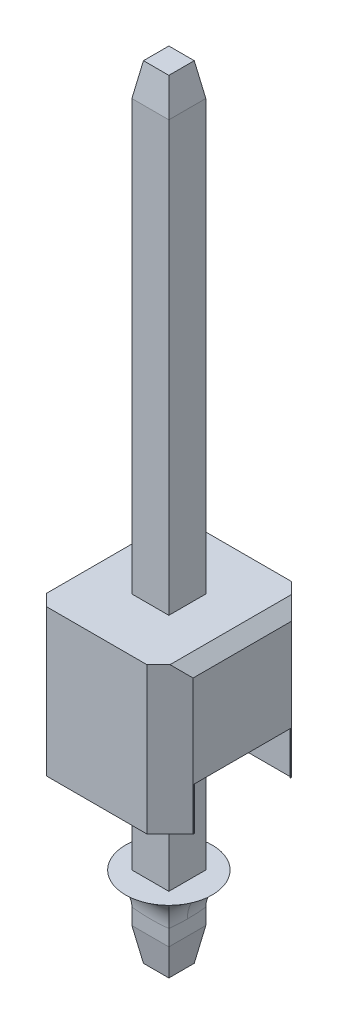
ISO-10303-21;
HEADER;
FILE_DESCRIPTION(('STEP AP214'),'2;1');
FILE_NAME('part.step','',(''),(''),'','','');
FILE_SCHEMA(('AUTOMOTIVE_DESIGN { 1 0 10303 214 1 1 1 1 }'));
ENDSEC;
DATA;
#1=APPLICATION_CONTEXT('core data for automotive mechanical design processes');
#2=APPLICATION_PROTOCOL_DEFINITION('international standard','automotive_design',2000,#1);
#3=PRODUCT_CONTEXT('',#1,'mechanical');
#4=PRODUCT('Part','Part','',(#3));
#5=PRODUCT_RELATED_PRODUCT_CATEGORY('part','',(#4));
#6=PRODUCT_DEFINITION_FORMATION('','',#4);
#7=PRODUCT_DEFINITION_CONTEXT('part definition',#1,'design');
#8=PRODUCT_DEFINITION('design','',#6,#7);
#9=PRODUCT_DEFINITION_SHAPE('','',#8);
#10=(LENGTH_UNIT() NAMED_UNIT(*) SI_UNIT(.MILLI.,.METRE.));
#11=(NAMED_UNIT(*) PLANE_ANGLE_UNIT() SI_UNIT($,.RADIAN.));
#12=(NAMED_UNIT(*) SI_UNIT($,.STERADIAN.) SOLID_ANGLE_UNIT());
#13=UNCERTAINTY_MEASURE_WITH_UNIT(LENGTH_MEASURE(1.E-05),#10,'distance_accuracy_value','');
#14=(GEOMETRIC_REPRESENTATION_CONTEXT(3) GLOBAL_UNCERTAINTY_ASSIGNED_CONTEXT((#13)) GLOBAL_UNIT_ASSIGNED_CONTEXT((#10,
#11,#12)) REPRESENTATION_CONTEXT('',''));
#15=CARTESIAN_POINT('',(0.,0.,0.));
#16=DIRECTION('',(0.,0.,1.));
#17=DIRECTION('',(1.,0.,0.));
#18=AXIS2_PLACEMENT_3D('',#15,#16,#17);
#19=CARTESIAN_POINT('',(17.78,-3.,0.));
#20=DIRECTION('',(0.,1.,0.));
#21=DIRECTION('',(0.,0.,1.));
#22=AXIS2_PLACEMENT_3D('',#19,#20,#21);
#23=PLANE('',#22);
#24=DIRECTION('',(1.,0.,0.));
#25=VECTOR('',#24,1.);
#26=CARTESIAN_POINT('',(17.46,-3.,0.219999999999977));
#27=LINE('',#26,#25);
#28=CARTESIAN_POINT('',(18.,-3.,0.219999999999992));
#29=VERTEX_POINT('',#28);
#30=CARTESIAN_POINT('',(17.56,-3.,0.219999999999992));
#31=VERTEX_POINT('',#30);
#32=EDGE_CURVE('E568',#29,#31,#27,.F.);
#33=ORIENTED_EDGE('',*,*,#32,.T.);
#34=DIRECTION('',(0.,0.,1.));
#35=VECTOR('',#34,1.);
#36=CARTESIAN_POINT('',(17.56,-3.,0.32));
#37=LINE('',#36,#35);
#38=CARTESIAN_POINT('',(17.56,-3.,-0.219999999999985));
#39=VERTEX_POINT('',#38);
#40=EDGE_CURVE('E558',#31,#39,#37,.F.);
#41=ORIENTED_EDGE('',*,*,#40,.T.);
#42=DIRECTION('',(1.,0.,0.));
#43=VECTOR('',#42,1.);
#44=CARTESIAN_POINT('',(17.46,-3.,-0.219999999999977));
#45=LINE('',#44,#43);
#46=CARTESIAN_POINT('',(18.,-3.,-0.219999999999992));
#47=VERTEX_POINT('',#46);
#48=EDGE_CURVE('E543',#39,#47,#45,.T.);
#49=ORIENTED_EDGE('',*,*,#48,.T.);
#50=DIRECTION('',(0.,0.,1.));
#51=VECTOR('',#50,1.);
#52=CARTESIAN_POINT('',(18.,-3.,0.32));
#53=LINE('',#52,#51);
#54=EDGE_CURVE('E529',#47,#29,#53,.T.);
#55=ORIENTED_EDGE('',*,*,#54,.T.);
#56=EDGE_LOOP('',(#33,#41,#49,#55));
#57=FACE_BOUND('',#56,.T.);
#58=ADVANCED_FACE('F17',(#57),#23,.F.);
#59=CARTESIAN_POINT('',(17.46,-2.432871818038,0.32));
#60=DIRECTION('',(0.,0.173648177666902,-0.984807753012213));
#61=DIRECTION('',(0.,0.984807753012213,0.173648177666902));
#62=AXIS2_PLACEMENT_3D('',#59,#60,#61);
#63=PLANE('',#62);
#64=DIRECTION('',(0.171087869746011,0.97028752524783,0.171087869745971));
#65=VECTOR('',#64,1.);
#66=CARTESIAN_POINT('',(18.,-3.,0.22));
#67=LINE('',#66,#65);
#68=CARTESIAN_POINT('',(18.1,-2.432871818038,0.32));
#69=VERTEX_POINT('',#68);
#70=EDGE_CURVE('E539',#29,#69,#67,.T.);
#71=ORIENTED_EDGE('',*,*,#70,.T.);
#72=DIRECTION('',(-1.,0.,0.));
#73=VECTOR('',#72,1.);
#74=CARTESIAN_POINT('',(17.46,-2.432871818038,0.32));
#75=LINE('',#74,#73);
#76=CARTESIAN_POINT('',(17.4600000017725,-2.43287182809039,0.319999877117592));
#77=VERTEX_POINT('',#76);
#78=EDGE_CURVE('E511',#69,#77,#75,.T.);
#79=ORIENTED_EDGE('',*,*,#78,.T.);
#80=DIRECTION('',(0.171087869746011,-0.97028752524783,-0.171087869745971));
#81=VECTOR('',#80,1.);
#82=CARTESIAN_POINT('',(17.46,-2.432871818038,0.32));
#83=LINE('',#82,#81);
#84=EDGE_CURVE('E565',#77,#31,#83,.T.);
#85=ORIENTED_EDGE('',*,*,#84,.T.);
#86=ORIENTED_EDGE('',*,*,#32,.F.);
#87=EDGE_LOOP('',(#71,#79,#85,#86));
#88=FACE_BOUND('',#87,.T.);
#89=ADVANCED_FACE('F690',(#88),#63,.F.);
#90=CARTESIAN_POINT('',(17.46,-2.432871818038,0.32));
#91=DIRECTION('',(0.984807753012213,0.173648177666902,0.));
#92=DIRECTION('',(-0.173648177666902,0.984807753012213,0.));
#93=AXIS2_PLACEMENT_3D('',#90,#91,#92);
#94=PLANE('',#93);
#95=ORIENTED_EDGE('',*,*,#84,.F.);
#96=DIRECTION('',(0.,0.,-1.));
#97=VECTOR('',#96,1.);
#98=CARTESIAN_POINT('',(17.46,-2.432871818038,0.32));
#99=LINE('',#98,#97);
#100=CARTESIAN_POINT('',(17.4600007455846,-2.43287187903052,-0.319999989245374));
#101=VERTEX_POINT('',#100);
#102=EDGE_CURVE('E510',#77,#101,#99,.T.);
#103=ORIENTED_EDGE('',*,*,#102,.T.);
#104=DIRECTION('',(0.171087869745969,-0.97028752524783,0.17108786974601));
#105=VECTOR('',#104,1.);
#106=CARTESIAN_POINT('',(17.46,-2.432871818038,-0.32));
#107=LINE('',#106,#105);
#108=EDGE_CURVE('E555',#101,#39,#107,.T.);
#109=ORIENTED_EDGE('',*,*,#108,.T.);
#110=ORIENTED_EDGE('',*,*,#40,.F.);
#111=EDGE_LOOP('',(#95,#103,#109,#110));
#112=FACE_BOUND('',#111,.T.);
#113=ADVANCED_FACE('F688',(#112),#94,.F.);
#114=CARTESIAN_POINT('',(17.46,-2.432871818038,-0.32));
#115=DIRECTION('',(0.,0.173648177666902,0.984807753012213));
#116=DIRECTION('',(0.,-0.984807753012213,0.173648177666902));
#117=AXIS2_PLACEMENT_3D('',#114,#115,#116);
#118=PLANE('',#117);
#119=DIRECTION('',(-0.171087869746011,-0.97028752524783,0.171087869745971));
#120=VECTOR('',#119,1.);
#121=CARTESIAN_POINT('',(18.1,-2.432871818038,-0.32));
#122=LINE('',#121,#120);
#123=CARTESIAN_POINT('',(18.0999999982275,-2.43287182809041,-0.319999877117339));
#124=VERTEX_POINT('',#123);
#125=EDGE_CURVE('E542',#124,#47,#122,.T.);
#126=ORIENTED_EDGE('',*,*,#125,.T.);
#127=ORIENTED_EDGE('',*,*,#48,.F.);
#128=ORIENTED_EDGE('',*,*,#108,.F.);
#129=DIRECTION('',(1.,0.,0.));
#130=VECTOR('',#129,1.);
#131=CARTESIAN_POINT('',(17.46,-2.432871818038,-0.32));
#132=LINE('',#131,#130);
#133=EDGE_CURVE('E550',#101,#124,#132,.T.);
#134=ORIENTED_EDGE('',*,*,#133,.T.);
#135=EDGE_LOOP('',(#126,#127,#128,#134));
#136=FACE_BOUND('',#135,.T.);
#137=ADVANCED_FACE('F679',(#136),#118,.F.);
#138=CARTESIAN_POINT('',(18.1,-2.432871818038,0.32));
#139=DIRECTION('',(-0.984807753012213,0.173648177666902,0.));
#140=DIRECTION('',(-0.173648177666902,-0.984807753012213,0.));
#141=AXIS2_PLACEMENT_3D('',#138,#139,#140);
#142=PLANE('',#141);
#143=ORIENTED_EDGE('',*,*,#125,.F.);
#144=DIRECTION('',(0.,0.,1.));
#145=VECTOR('',#144,1.);
#146=CARTESIAN_POINT('',(18.1,-2.432871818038,0.32));
#147=LINE('',#146,#145);
#148=EDGE_CURVE('E532',#124,#69,#147,.T.);
#149=ORIENTED_EDGE('',*,*,#148,.T.);
#150=ORIENTED_EDGE('',*,*,#70,.F.);
#151=ORIENTED_EDGE('',*,*,#54,.F.);
#152=EDGE_LOOP('',(#143,#149,#150,#151));
#153=FACE_BOUND('',#152,.T.);
#154=ADVANCED_FACE('F683',(#153),#142,.F.);
#155=CARTESIAN_POINT('',(17.46,10.54,0.32));
#156=DIRECTION('',(0.,0.,-1.));
#157=DIRECTION('',(-1.,0.,0.));
#158=AXIS2_PLACEMENT_3D('',#155,#156,#157);
#159=PLANE('',#158);
#160=ORIENTED_EDGE('',*,*,#78,.F.);
#161=DIRECTION('',(0.,1.,0.));
#162=VECTOR('',#161,1.);
#163=CARTESIAN_POINT('',(18.1,10.54,0.32));
#164=LINE('',#163,#162);
#165=CARTESIAN_POINT('',(18.099999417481,-2.15659492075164,0.31999987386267));
#166=VERTEX_POINT('',#165);
#167=EDGE_CURVE('E535',#69,#166,#164,.T.);
#168=ORIENTED_EDGE('',*,*,#167,.T.);
#169=CARTESIAN_POINT('',(17.4600014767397,-2.15659493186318,0.320000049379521));
#170=CARTESIAN_POINT('',(17.4704528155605,-2.15797577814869,0.320000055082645));
#171=CARTESIAN_POINT('',(17.4809174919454,-2.15925236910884,0.320000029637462));
#172=CARTESIAN_POINT('',(17.5016887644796,-2.16159807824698,0.319999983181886));
#173=CARTESIAN_POINT('',(17.5119950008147,-2.1626703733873,0.319999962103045));
#174=CARTESIAN_POINT('',(17.532448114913,-2.16463750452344,0.319999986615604));
#175=CARTESIAN_POINT('',(17.5425947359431,-2.16553503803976,0.320000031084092));
#176=CARTESIAN_POINT('',(17.5627295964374,-2.16717953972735,0.320000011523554));
#177=CARTESIAN_POINT('',(17.5727176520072,-2.1679287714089,0.319999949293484));
#178=CARTESIAN_POINT('',(17.5925378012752,-2.16929600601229,0.319999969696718));
#179=CARTESIAN_POINT('',(17.6023697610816,-2.16991596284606,0.320000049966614));
#180=CARTESIAN_POINT('',(17.6218813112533,-2.17104287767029,0.32000003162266));
#181=CARTESIAN_POINT('',(17.6315608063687,-2.17155149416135,0.319999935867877));
#182=CARTESIAN_POINT('',(17.6507712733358,-2.17246636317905,0.319999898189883));
#183=CARTESIAN_POINT('',(17.6603021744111,-2.17287410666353,0.319999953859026));
#184=CARTESIAN_POINT('',(17.6792195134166,-2.17359563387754,0.319999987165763));
#185=CARTESIAN_POINT('',(17.6886058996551,-2.17391077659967,0.319999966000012));
#186=CARTESIAN_POINT('',(17.707238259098,-2.17445127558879,0.319999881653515));
#187=CARTESIAN_POINT('',(17.7164841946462,-2.17467792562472,0.319999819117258));
#188=CARTESIAN_POINT('',(17.7348393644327,-2.1750412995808,0.319999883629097));
#189=CARTESIAN_POINT('',(17.7439485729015,-2.17517931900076,0.320000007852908));
#190=CARTESIAN_POINT('',(17.7620338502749,-2.17536464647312,0.319999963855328));
#191=CARTESIAN_POINT('',(17.7710099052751,-2.17541325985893,0.319999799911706));
#192=CARTESIAN_POINT('',(17.7889649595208,-2.17541286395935,0.319999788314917));
#193=CARTESIAN_POINT('',(17.7979439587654,-2.17536382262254,0.319999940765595));
#194=CARTESIAN_POINT('',(17.8160346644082,-2.17517774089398,0.319999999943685));
#195=CARTESIAN_POINT('',(17.8251463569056,-2.17503940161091,0.319999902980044));
#196=CARTESIAN_POINT('',(17.8435060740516,-2.17467568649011,0.319999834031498));
#197=CARTESIAN_POINT('',(17.8527540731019,-2.17444902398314,0.319999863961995));
#198=CARTESIAN_POINT('',(17.8713901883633,-2.17390837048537,0.319999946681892));
#199=CARTESIAN_POINT('',(17.8807782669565,-2.17359308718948,0.319999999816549));
#200=CARTESIAN_POINT('',(17.8996985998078,-2.17287154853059,0.319999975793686));
#201=CARTESIAN_POINT('',(17.9092308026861,-2.17246394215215,0.31999989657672));
#202=CARTESIAN_POINT('',(17.9284434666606,-2.1715492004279,0.319999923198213));
#203=CARTESIAN_POINT('',(17.9381238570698,-2.17104057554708,0.320000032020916));
#204=CARTESIAN_POINT('',(17.9576367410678,-2.16991384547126,0.320000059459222));
#205=CARTESIAN_POINT('',(17.9674691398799,-2.16929408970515,0.319999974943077));
#206=CARTESIAN_POINT('',(17.9872897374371,-2.16792718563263,0.319999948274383));
#207=CARTESIAN_POINT('',(17.9972778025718,-2.16717808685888,0.320000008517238));
#208=CARTESIAN_POINT('',(18.0174122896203,-2.16553388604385,0.320000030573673));
#209=CARTESIAN_POINT('',(18.0275585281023,-2.16463652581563,0.319999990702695));
#210=CARTESIAN_POINT('',(18.0480104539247,-2.16266966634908,0.319999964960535));
#211=CARTESIAN_POINT('',(18.0583158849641,-2.16159747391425,0.319999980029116));
#212=CARTESIAN_POINT('',(18.0790850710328,-2.15925200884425,0.320000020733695));
#213=CARTESIAN_POINT('',(18.0895484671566,-2.15797556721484,0.320000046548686));
#214=CARTESIAN_POINT('',(18.0999985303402,-2.15659492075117,0.320000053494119));
#215=B_SPLINE_CURVE_WITH_KNOTS('',3,(#169,#170,#171,#172,#173,#174,#175,#176,#177,#178,#179,
#180,#181,#182,#183,#184,#185,#186,#187,#188,#189,#190,#191,#192,#193,#194,#195,#196,#197,#198,
#199,#200,#201,#202,#203,#204,#205,#206,#207,#208,#209,#210,#211,#212,#213,#214),.UNSPECIFIED.,
.F.,.F.,(4,2,2,2,2,2,2,2,2,2,2,2,2,2,2,2,2,2,2,2,2,2,4),(0.,0.0316253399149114,
0.062709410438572,0.0932671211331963,0.123314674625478,0.152868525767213,0.181946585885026,
0.210565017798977,0.238739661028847,0.266485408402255,0.293815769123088,0.320743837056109,
0.347680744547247,0.375018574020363,0.402770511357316,0.430950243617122,0.459572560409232,
0.488653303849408,0.518208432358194,0.548255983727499,0.578812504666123,0.609894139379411,
0.641515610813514),.UNSPECIFIED.);
#216=CARTESIAN_POINT('',(17.4600005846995,-2.15659493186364,0.319999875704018));
#217=VERTEX_POINT('',#216);
#218=EDGE_CURVE('E518',#166,#217,#215,.F.);
#219=ORIENTED_EDGE('',*,*,#218,.T.);
#220=DIRECTION('',(0.,1.,0.));
#221=VECTOR('',#220,1.);
#222=CARTESIAN_POINT('',(17.46,10.54,0.3199997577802));
#223=LINE('',#222,#221);
#224=EDGE_CURVE('E502',#217,#77,#223,.F.);
#225=ORIENTED_EDGE('',*,*,#224,.T.);
#226=EDGE_LOOP('',(#160,#168,#219,#225));
#227=FACE_BOUND('',#226,.T.);
#228=ADVANCED_FACE('F493',(#227),#159,.F.);
#229=CARTESIAN_POINT('',(17.46,10.54,0.32));
#230=DIRECTION('',(1.,0.,0.));
#231=DIRECTION('',(0.,0.,-1.));
#232=AXIS2_PLACEMENT_3D('',#229,#230,#231);
#233=PLANE('',#232);
#234=ORIENTED_EDGE('',*,*,#102,.F.);
#235=ORIENTED_EDGE('',*,*,#224,.F.);
#236=CARTESIAN_POINT('',(17.4600000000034,-2.175412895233,0.));
#237=CARTESIAN_POINT('',(17.4599999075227,-2.17541213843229,0.0123739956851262));
#238=CARTESIAN_POINT('',(17.4600004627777,-2.17532404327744,0.0247478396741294));
#239=CARTESIAN_POINT('',(17.4600015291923,-2.17497996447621,0.0497528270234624));
#240=CARTESIAN_POINT('',(17.4600020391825,-2.17472049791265,0.0623839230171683));
#241=CARTESIAN_POINT('',(17.4600015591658,-2.17403405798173,0.0879113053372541));
#242=CARTESIAN_POINT('',(17.4600005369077,-2.17360362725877,0.100807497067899));
#243=CARTESIAN_POINT('',(17.4599998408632,-2.17257647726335,0.126873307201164));
#244=CARTESIAN_POINT('',(17.4600001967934,-2.17197635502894,0.140042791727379));
#245=CARTESIAN_POINT('',(17.46000098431,-2.1705799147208,0.166666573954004));
#246=CARTESIAN_POINT('',(17.460001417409,-2.169779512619,0.180120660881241));
#247=CARTESIAN_POINT('',(17.4600012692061,-2.16794034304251,0.20732386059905));
#248=CARTESIAN_POINT('',(17.4600006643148,-2.1668965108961,0.221072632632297));
#249=CARTESIAN_POINT('',(17.4599997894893,-2.16452994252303,0.248871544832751));
#250=CARTESIAN_POINT('',(17.4599995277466,-2.16320123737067,0.262921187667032));
#251=CARTESIAN_POINT('',(17.4599993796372,-2.16018551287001,0.291322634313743));
#252=CARTESIAN_POINT('',(17.4599995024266,-2.15849066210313,0.305673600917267));
#253=CARTESIAN_POINT('',(17.4599998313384,-2.15659493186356,0.31999975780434));
#254=B_SPLINE_CURVE_WITH_KNOTS('',3,(#236,#237,#238,#239,#240,#241,#242,#243,#244,#245,#246,
#247,#248,#249,#250,#251,#252,#253),.UNSPECIFIED.,.F.,.F.,(4,2,2,2,2,2,2,2,4),(0.,
0.0371214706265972,0.0750216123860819,0.113730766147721,0.153279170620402,0.193711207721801,
0.235074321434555,0.277407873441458,0.32075703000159),.UNSPECIFIED.);
#255=CARTESIAN_POINT('',(17.4600000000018,-2.175412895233,0.));
#256=VERTEX_POINT('',#255);
#257=EDGE_CURVE('E338',#217,#256,#254,.F.);
#258=ORIENTED_EDGE('',*,*,#257,.T.);
#259=CARTESIAN_POINT('',(17.4599998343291,-2.15659492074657,-0.319999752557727));
#260=CARTESIAN_POINT('',(17.4599995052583,-2.15849060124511,-0.305673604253));
#261=CARTESIAN_POINT('',(17.4599993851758,-2.16018546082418,-0.291322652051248));
#262=CARTESIAN_POINT('',(17.4599995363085,-2.16320123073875,-0.262921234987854));
#263=CARTESIAN_POINT('',(17.4599997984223,-2.16452997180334,-0.248871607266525));
#264=CARTESIAN_POINT('',(17.4600006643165,-2.16689655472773,-0.221072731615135));
#265=CARTESIAN_POINT('',(17.4600012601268,-2.16794036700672,-0.207323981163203));
#266=CARTESIAN_POINT('',(17.4600013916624,-2.16977946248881,-0.180120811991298));
#267=CARTESIAN_POINT('',(17.4600009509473,-2.1705798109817,-0.166666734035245));
#268=CARTESIAN_POINT('',(17.4600001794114,-2.17197629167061,-0.140042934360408));
#269=CARTESIAN_POINT('',(17.4599998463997,-2.17257650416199,-0.126873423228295));
#270=CARTESIAN_POINT('',(17.4600005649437,-2.17360376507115,-0.100807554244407));
#271=CARTESIAN_POINT('',(17.460001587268,-2.17403421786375,-0.0879113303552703));
#272=CARTESIAN_POINT('',(17.4600020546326,-2.1747206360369,-0.0623839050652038));
#273=CARTESIAN_POINT('',(17.4600015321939,-2.17498006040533,-0.0497527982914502));
#274=CARTESIAN_POINT('',(17.4600004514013,-2.17532406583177,-0.024747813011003));
#275=CARTESIAN_POINT('',(17.4599998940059,-2.17541212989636,-0.0123739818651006));
#276=CARTESIAN_POINT('',(17.4600000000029,-2.175412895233,0.));
#277=B_SPLINE_CURVE_WITH_KNOTS('',3,(#259,#260,#261,#262,#263,#264,#265,#266,#267,#268,#269,
#270,#271,#272,#273,#274,#275,#276),.UNSPECIFIED.,.F.,.F.,(4,2,2,2,2,2,2,2,4),(0.,
0.0433491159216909,0.0856826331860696,0.127045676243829,0.167477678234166,0.207026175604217,
0.245735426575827,0.283635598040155,0.320757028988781),.UNSPECIFIED.);
#278=CARTESIAN_POINT('',(17.4600007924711,-2.15659492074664,-0.31999990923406));
#279=VERTEX_POINT('',#278);
#280=EDGE_CURVE('E333',#256,#279,#277,.F.);
#281=ORIENTED_EDGE('',*,*,#280,.T.);
#282=DIRECTION('',(0.,1.,0.));
#283=VECTOR('',#282,1.);
#284=CARTESIAN_POINT('',(17.46000146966,10.54,-0.32));
#285=LINE('',#284,#283);
#286=EDGE_CURVE('E473',#279,#101,#285,.F.);
#287=ORIENTED_EDGE('',*,*,#286,.T.);
#288=EDGE_LOOP('',(#234,#235,#258,#281,#287));
#289=FACE_BOUND('',#288,.T.);
#290=ADVANCED_FACE('F472',(#289),#233,.F.);
#291=CARTESIAN_POINT('',(17.46,10.54,-0.32));
#292=DIRECTION('',(0.,0.,1.));
#293=DIRECTION('',(1.,0.,0.));
#294=AXIS2_PLACEMENT_3D('',#291,#292,#293);
#295=PLANE('',#294);
#296=ORIENTED_EDGE('',*,*,#133,.F.);
#297=ORIENTED_EDGE('',*,*,#286,.F.);
#298=CARTESIAN_POINT('',(18.0999985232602,-2.15659493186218,-0.320000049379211));
#299=CARTESIAN_POINT('',(18.0895473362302,-2.1579757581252,-0.32000005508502));
#300=CARTESIAN_POINT('',(18.079082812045,-2.15925233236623,-0.320000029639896));
#301=CARTESIAN_POINT('',(18.0583118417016,-2.16159801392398,-0.319999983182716));
#302=CARTESIAN_POINT('',(18.0480057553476,-2.16267029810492,-0.319999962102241));
#303=CARTESIAN_POINT('',(18.0275529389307,-2.16463741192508,-0.319999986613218));
#304=CARTESIAN_POINT('',(18.0174064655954,-2.16553493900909,-0.320000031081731));
#305=CARTESIAN_POINT('',(17.9972718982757,-2.16717943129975,-0.320000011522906));
#306=CARTESIAN_POINT('',(17.9872839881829,-2.16792865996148,-0.3199999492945));
#307=CARTESIAN_POINT('',(17.9674641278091,-2.16929589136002,-0.31999996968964));
#308=CARTESIAN_POINT('',(17.9576323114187,-2.16991584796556,-0.320000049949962));
#309=CARTESIAN_POINT('',(17.938121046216,-2.1710427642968,-0.32000003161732));
#310=CARTESIAN_POINT('',(17.9284416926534,-2.17155138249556,-0.319999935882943));
#311=CARTESIAN_POINT('',(17.9092315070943,-2.172466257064,-0.319999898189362));
#312=CARTESIAN_POINT('',(17.8997007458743,-2.17287400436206,-0.319999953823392));
#313=CARTESIAN_POINT('',(17.8807836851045,-2.1735955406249,-0.319999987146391));
#314=CARTESIAN_POINT('',(17.8713974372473,-2.17391068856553,-0.319999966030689));
#315=CARTESIAN_POINT('',(17.8527653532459,-2.17445120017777,-0.319999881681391));
#316=CARTESIAN_POINT('',(17.8435195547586,-2.17467785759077,-0.319999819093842));
#317=CARTESIAN_POINT('',(17.825164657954,-2.17504124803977,-0.319999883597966));
#318=CARTESIAN_POINT('',(17.8160555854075,-2.17517927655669,-0.320000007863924));
#319=CARTESIAN_POINT('',(17.7979705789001,-2.17536462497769,-0.319999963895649));
#320=CARTESIAN_POINT('',(17.788994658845,-2.17541325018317,-0.319999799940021));
#321=CARTESIAN_POINT('',(17.7710396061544,-2.17541288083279,-0.319999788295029));
#322=CARTESIAN_POINT('',(17.7620604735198,-2.1753638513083,-0.319999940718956));
#323=CARTESIAN_POINT('',(17.7439694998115,-2.1751777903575,-0.319999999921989));
#324=CARTESIAN_POINT('',(17.7348576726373,-2.17503946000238,-0.319999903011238));
#325=CARTESIAN_POINT('',(17.7164976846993,-2.17467576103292,-0.319999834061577));
#326=CARTESIAN_POINT('',(17.7072495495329,-2.17444910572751,-0.319999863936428));
#327=CARTESIAN_POINT('',(17.6886131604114,-2.17390846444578,-0.319999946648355));
#328=CARTESIAN_POINT('',(17.6792249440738,-2.17359318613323,-0.319999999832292));
#329=CARTESIAN_POINT('',(17.660304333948,-2.1728716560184,-0.319999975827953));
#330=CARTESIAN_POINT('',(17.6507719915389,-2.17246405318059,-0.319999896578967));
#331=CARTESIAN_POINT('',(17.6315590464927,-2.17154931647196,-0.319999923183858));
#332=CARTESIAN_POINT('',(17.6218785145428,-2.17104069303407,-0.320000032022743));
#333=CARTESIAN_POINT('',(17.602365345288,-2.16991396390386,-0.320000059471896));
#334=CARTESIAN_POINT('',(17.59253280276,-2.16929420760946,-0.319999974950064));
#335=CARTESIAN_POINT('',(17.5727119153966,-2.16792729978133,-0.319999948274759));
#336=CARTESIAN_POINT('',(17.5627237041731,-2.16717819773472,-0.320000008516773));
#337=CARTESIAN_POINT('',(17.5425889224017,-2.16553398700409,-0.320000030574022));
#338=CARTESIAN_POINT('',(17.5324425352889,-2.16463662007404,-0.319999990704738));
#339=CARTESIAN_POINT('',(17.5119903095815,-2.16266974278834,-0.319999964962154));
#340=CARTESIAN_POINT('',(17.5016847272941,-2.16159753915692,-0.319999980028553));
#341=CARTESIAN_POINT('',(17.4809152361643,-2.15925204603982,-0.320000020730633));
#342=CARTESIAN_POINT('',(17.4704516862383,-2.15797558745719,-0.320000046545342));
#343=CARTESIAN_POINT('',(17.4600014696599,-2.15659492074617,-0.320000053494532));
#344=B_SPLINE_CURVE_WITH_KNOTS('',3,(#298,#299,#300,#301,#302,#303,#304,#305,#306,#307,#308,
#309,#310,#311,#312,#313,#314,#315,#316,#317,#318,#319,#320,#321,#322,#323,#324,#325,#326,#327,
#328,#329,#330,#331,#332,#333,#334,#335,#336,#337,#338,#339,#340,#341,#342,#343),.UNSPECIFIED.,
.F.,.F.,(4,2,2,2,2,2,2,2,2,2,2,2,2,2,2,2,2,2,2,2,2,2,4),(0.,0.0316248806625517,
0.0627085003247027,0.0932657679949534,0.123312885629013,0.152866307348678,0.181943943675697,
0.210561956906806,0.238736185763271,0.266481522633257,0.293811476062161,0.320739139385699,
0.34767644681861,0.375014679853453,0.4027670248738,0.430947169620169,0.459569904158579,
0.488651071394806,0.518206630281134,0.548254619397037,0.578811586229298,0.609893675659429,
0.641515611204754),.UNSPECIFIED.);
#345=CARTESIAN_POINT('',(18.0999994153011,-2.15659493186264,-0.319999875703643));
#346=VERTEX_POINT('',#345);
#347=EDGE_CURVE('E455',#279,#346,#344,.F.);
#348=ORIENTED_EDGE('',*,*,#347,.T.);
#349=DIRECTION('',(0.,1.,0.));
#350=VECTOR('',#349,1.);
#351=CARTESIAN_POINT('',(18.1,10.54,-0.3199997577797));
#352=LINE('',#351,#350);
#353=EDGE_CURVE('E536',#346,#124,#352,.F.);
#354=ORIENTED_EDGE('',*,*,#353,.T.);
#355=EDGE_LOOP('',(#296,#297,#348,#354));
#356=FACE_BOUND('',#355,.T.);
#357=ADVANCED_FACE('F492',(#356),#295,.F.);
#358=CARTESIAN_POINT('',(18.1,10.54,0.32));
#359=DIRECTION('',(-1.,0.,0.));
#360=DIRECTION('',(0.,0.,1.));
#361=AXIS2_PLACEMENT_3D('',#358,#359,#360);
#362=PLANE('',#361);
#363=ORIENTED_EDGE('',*,*,#167,.F.);
#364=ORIENTED_EDGE('',*,*,#148,.F.);
#365=ORIENTED_EDGE('',*,*,#353,.F.);
#366=CARTESIAN_POINT('',(18.0999999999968,-2.175412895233,0.));
#367=CARTESIAN_POINT('',(18.1000000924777,-2.17541213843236,-0.0123739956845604));
#368=CARTESIAN_POINT('',(18.0999995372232,-2.17532404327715,-0.0247478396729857));
#369=CARTESIAN_POINT('',(18.0999984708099,-2.17497996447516,-0.0497528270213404));
#370=CARTESIAN_POINT('',(18.0999979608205,-2.17472049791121,-0.0623839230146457));
#371=CARTESIAN_POINT('',(18.0999984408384,-2.17403405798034,-0.0879113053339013));
#372=CARTESIAN_POINT('',(18.0999994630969,-2.17360362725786,-0.100807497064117));
#373=CARTESIAN_POINT('',(18.1000001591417,-2.17257647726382,-0.126873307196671));
#374=CARTESIAN_POINT('',(18.0999998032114,-2.17197635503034,-0.140042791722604));
#375=CARTESIAN_POINT('',(18.0999990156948,-2.17057991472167,-0.166666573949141));
#376=CARTESIAN_POINT('',(18.0999985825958,-2.16977951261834,-0.180120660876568));
#377=CARTESIAN_POINT('',(18.0999987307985,-2.16794034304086,-0.207323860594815));
#378=CARTESIAN_POINT('',(18.0999993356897,-2.16689651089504,-0.221072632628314));
#379=CARTESIAN_POINT('',(18.1000002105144,-2.16452994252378,-0.248871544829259));
#380=CARTESIAN_POINT('',(18.1000004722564,-2.16320123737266,-0.262921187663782));
#381=CARTESIAN_POINT('',(18.1000006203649,-2.16018551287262,-0.291322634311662));
#382=CARTESIAN_POINT('',(18.1000004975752,-2.15849066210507,-0.305673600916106));
#383=CARTESIAN_POINT('',(18.1000001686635,-2.15659493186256,-0.319999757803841));
#384=B_SPLINE_CURVE_WITH_KNOTS('',3,(#366,#367,#368,#369,#370,#371,#372,#373,#374,#375,#376,
#377,#378,#379,#380,#381,#382,#383),.UNSPECIFIED.,.F.,.F.,(4,2,2,2,2,2,2,2,4),(0.,
0.0371214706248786,0.0750216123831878,0.113730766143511,0.153279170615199,0.193711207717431,
0.23507432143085,0.277407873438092,0.320757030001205),.UNSPECIFIED.);
#385=CARTESIAN_POINT('',(18.0999999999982,-2.175412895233,0.));
#386=VERTEX_POINT('',#385);
#387=EDGE_CURVE('E460',#346,#386,#384,.F.);
#388=ORIENTED_EDGE('',*,*,#387,.T.);
#389=CARTESIAN_POINT('',(18.1000001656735,-2.15659492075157,0.319999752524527));
#390=CARTESIAN_POINT('',(18.1000004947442,-2.15849060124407,0.305673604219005));
#391=CARTESIAN_POINT('',(18.1000006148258,-2.16018546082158,0.29132265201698));
#392=CARTESIAN_POINT('',(18.1000004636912,-2.16320123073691,0.262921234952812));
#393=CARTESIAN_POINT('',(18.1000002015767,-2.16452997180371,0.248871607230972));
#394=CARTESIAN_POINT('',(18.0999993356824,-2.16689655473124,0.221072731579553));
#395=CARTESIAN_POINT('',(18.0999987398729,-2.16794036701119,0.207323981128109));
#396=CARTESIAN_POINT('',(18.0999986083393,-2.16977946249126,0.180120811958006));
#397=CARTESIAN_POINT('',(18.0999990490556,-2.17057981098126,0.166666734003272));
#398=CARTESIAN_POINT('',(18.0999998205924,-2.17197629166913,0.140042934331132));
#399=CARTESIAN_POINT('',(18.1000001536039,-2.17257650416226,0.126873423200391));
#400=CARTESIAN_POINT('',(18.0999994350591,-2.17360376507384,0.100807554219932));
#401=CARTESIAN_POINT('',(18.0999984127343,-2.17403421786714,0.0879113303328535));
#402=CARTESIAN_POINT('',(18.0999979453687,-2.17472063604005,0.0623839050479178));
#403=CARTESIAN_POINT('',(18.0999984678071,-2.17498006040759,0.0497527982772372));
#404=CARTESIAN_POINT('',(18.0999995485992,-2.17532406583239,0.0247478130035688));
#405=CARTESIAN_POINT('',(18.1000001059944,-2.17541212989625,0.0123739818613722));
#406=CARTESIAN_POINT('',(18.0999999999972,-2.175412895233,0.));
#407=B_SPLINE_CURVE_WITH_KNOTS('',3,(#389,#390,#391,#392,#393,#394,#395,#396,#397,#398,#399,
#400,#401,#402,#403,#404,#405,#406),.UNSPECIFIED.,.F.,.F.,(4,2,2,2,2,2,2,2,4),(0.,
0.0433491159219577,0.0856826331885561,0.127045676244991,0.167477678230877,0.207026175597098,
0.245735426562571,0.283635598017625,0.320757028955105),.UNSPECIFIED.);
#408=EDGE_CURVE('E629',#386,#166,#407,.F.);
#409=ORIENTED_EDGE('',*,*,#408,.T.);
#410=EDGE_LOOP('',(#363,#364,#365,#388,#409));
#411=FACE_BOUND('',#410,.T.);
#412=ADVANCED_FACE('F634',(#411),#362,.F.);
#413=CARTESIAN_POINT('',(18.16209794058,-1.925651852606,1.174898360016));
#414=CARTESIAN_POINT('',(18.16185251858,-1.9298795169,1.172189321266));
#415=CARTESIAN_POINT('',(18.15952527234,-1.968939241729,1.146475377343));
#416=CARTESIAN_POINT('',(18.15430014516,-2.037853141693,1.088590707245));
#417=CARTESIAN_POINT('',(18.14544668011,-2.116911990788,0.9896934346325));
#418=CARTESIAN_POINT('',(18.13541962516,-2.176844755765,0.8744819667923));
#419=CARTESIAN_POINT('',(18.12514212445,-2.214889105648,0.7486194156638));
#420=CARTESIAN_POINT('',(18.1158468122,-2.231712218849,0.6192068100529));
#421=CARTESIAN_POINT('',(18.10855126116,-2.231794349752,0.4912745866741));
#422=CARTESIAN_POINT('',(18.10372354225,-2.221370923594,0.366366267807));
#423=CARTESIAN_POINT('',(18.10122075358,-2.207101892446,0.2437233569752));
#424=CARTESIAN_POINT('',(18.10033607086,-2.195254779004,0.1218854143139));
#425=CARTESIAN_POINT('',(18.10022751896,-2.191919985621,0.03317813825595));
#426=CARTESIAN_POINT('',(18.10023631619,-2.192269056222,-0.01564421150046));
#427=CARTESIAN_POINT('',(18.10023678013,-2.19238270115,-0.02346786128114));
#428=CARTESIAN_POINT('',(18.03357184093,-1.807625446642,0.9431417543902));
#429=CARTESIAN_POINT('',(18.03356619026,-1.810245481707,0.9411183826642));
#430=CARTESIAN_POINT('',(18.03352206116,-1.834403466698,0.9219146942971));
#431=CARTESIAN_POINT('',(18.03358566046,-1.876097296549,0.8787255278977));
#432=CARTESIAN_POINT('',(18.03447933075,-1.921056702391,0.8049882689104));
#433=CARTESIAN_POINT('',(18.03685857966,-1.951286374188,0.7189508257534));
#434=CARTESIAN_POINT('',(18.04148385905,-1.96535587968,0.6243072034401));
#435=CARTESIAN_POINT('',(18.0488362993,-1.964636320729,0.5254402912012));
#436=CARTESIAN_POINT('',(18.05874016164,-1.953184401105,0.4250072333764));
#437=CARTESIAN_POINT('',(18.07024584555,-1.936073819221,0.3231185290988));
#438=CARTESIAN_POINT('',(18.08151678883,-1.918536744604,0.218592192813));
#439=CARTESIAN_POINT('',(18.08999476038,-1.905447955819,0.1105868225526));
#440=CARTESIAN_POINT('',(18.09231814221,-1.90191201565,0.03011708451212));
#441=CARTESIAN_POINT('',(18.09207261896,-1.90228207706,-0.01419978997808));
#442=CARTESIAN_POINT('',(18.09199129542,-1.902401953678,-0.02129926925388));
#443=CARTESIAN_POINT('',(18.09427061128,-1.678887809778,0.6903523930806));
#444=CARTESIAN_POINT('',(18.09452659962,-1.679838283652,0.6892419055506));
#445=CARTESIAN_POINT('',(18.0969709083,-1.688572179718,0.6786936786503));
#446=CARTESIAN_POINT('',(18.1027490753,-1.703074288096,0.6547967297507));
#447=CARTESIAN_POINT('',(18.1139416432,-1.716904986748,0.6130340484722));
#448=CARTESIAN_POINT('',(18.12905675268,-1.723625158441,0.5625541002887));
#449=CARTESIAN_POINT('',(18.14845021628,-1.722888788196,0.5040607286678));
#450=CARTESIAN_POINT('',(18.17164401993,-1.715781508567,0.438526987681));
#451=CARTESIAN_POINT('',(18.19722147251,-1.704561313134,0.3662198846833));
#452=CARTESIAN_POINT('',(18.22298107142,-1.691811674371,0.2863271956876));
#453=CARTESIAN_POINT('',(18.24580137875,-1.68010928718,0.1979611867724));
#454=CARTESIAN_POINT('',(18.2618848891,-1.671831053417,0.1015350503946));
#455=CARTESIAN_POINT('',(18.26614740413,-1.669645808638,0.02766398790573));
#456=CARTESIAN_POINT('',(18.26569986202,-1.669874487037,-0.01304230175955));
#457=CARTESIAN_POINT('',(18.26555428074,-1.669948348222,-0.01956088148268));
#458=CARTESIAN_POINT('',(18.3179680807,-1.595062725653,0.5257531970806));
#459=CARTESIAN_POINT('',(18.31839452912,-1.595003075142,0.5253883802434));
#460=CARTESIAN_POINT('',(18.32245741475,-1.594454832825,0.5219010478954));
#461=CARTESIAN_POINT('',(18.33190689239,-1.593542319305,0.5135574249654));
#462=CARTESIAN_POINT('',(18.34950026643,-1.592664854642,0.496768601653));
#463=CARTESIAN_POINT('',(18.37217799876,-1.592226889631,0.4728662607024));
#464=CARTESIAN_POINT('',(18.39982414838,-1.592250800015,0.4398349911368));
#465=CARTESIAN_POINT('',(18.43120833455,-1.592670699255,0.3960196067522));
#466=CARTESIAN_POINT('',(18.46416145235,-1.593347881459,0.3403128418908));
#467=CARTESIAN_POINT('',(18.49593677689,-1.594123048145,0.27188873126));
#468=CARTESIAN_POINT('',(18.52309193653,-1.594837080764,0.190744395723));
#469=CARTESIAN_POINT('',(18.5417377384,-1.595343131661,0.09864110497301));
#470=CARTESIAN_POINT('',(18.54660874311,-1.595476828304,0.02687876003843));
#471=CARTESIAN_POINT('',(18.54609877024,-1.595462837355,-0.01267186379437));
#472=CARTESIAN_POINT('',(18.54593422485,-1.595458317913,-0.01900380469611));
#473=(BOUNDED_SURFACE() B_SPLINE_SURFACE(3,3,((#413,#414,#415,#416,#417,#418,#419,#420,#421,
#422,#423,#424,#425,#426,#427),(#428,#429,#430,#431,#432,#433,#434,#435,#436,#437,#438,#439,
#440,#441,#442),(#443,#444,#445,#446,#447,#448,#449,#450,#451,#452,#453,#454,#455,#456,#457),
(#458,#459,#460,#461,#462,#463,#464,#465,#466,#467,#468,#469,#470,#471,#472)),.UNSPECIFIED.,.F.,
.F.,.F.) B_SPLINE_SURFACE_WITH_KNOTS((4,4),(4,1,1,1,1,1,1,1,1,1,1,1,4),(0.,1.),(0.1091139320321,
0.1166424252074,0.1794007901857,0.2470765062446,0.3216610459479,0.403928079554,0.4919227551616,
0.5844250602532,0.6818804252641,0.784137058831,0.8905014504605,1.,1.020889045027),
.UNSPECIFIED.) GEOMETRIC_REPRESENTATION_ITEM() RATIONAL_B_SPLINE_SURFACE(((1.121098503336,
1.121098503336,1.121098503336,1.121098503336,1.121098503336,1.121098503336,1.121098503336,
1.121098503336,1.121098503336,1.121098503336,1.121098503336,1.121098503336,1.121098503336,
1.121098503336,1.121098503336),(0.9596338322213,0.9596338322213,0.9596338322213,0.9596338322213,
0.9596338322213,0.9596338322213,0.9596338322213,0.9596338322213,0.9596338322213,0.9596338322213,
0.9596338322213,0.9596338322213,0.9596338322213,0.9596338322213,0.9596338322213),
(0.9596338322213,0.9596338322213,0.9596338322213,0.9596338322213,0.9596338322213,
0.9596338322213,0.9596338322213,0.9596338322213,0.9596338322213,0.9596338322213,0.9596338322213,
0.9596338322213,0.9596338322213,0.9596338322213,0.9596338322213),(1.121098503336,1.121098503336,
1.121098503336,1.121098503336,1.121098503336,1.121098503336,1.121098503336,1.121098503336,
1.121098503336,1.121098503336,1.121098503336,1.121098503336,1.121098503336,1.121098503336,1.121098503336))) REPRESENTATION_ITEM('') SURFACE());
#474=CARTESIAN_POINT('',(18.7000000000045,-2.17541289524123,0.));
#475=DIRECTION('',(0.,0.,-1.));
#476=DIRECTION('',(-0.999607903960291,-0.0280006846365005,0.));
#477=AXIS2_PLACEMENT_3D('',#474,#475,#476);
#478=CIRCLE('',#477,0.600000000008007);
#479=CARTESIAN_POINT('',(18.5300016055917,-1.599999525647,-1.11332058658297E-12));
#480=VERTEX_POINT('',#479);
#481=EDGE_CURVE('E462',#386,#480,#478,.T.);
#482=CARTESIAN_POINT('',(18.5300016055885,-1.59999952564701,-2.24805340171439E-12));
#483=CARTESIAN_POINT('',(18.5300243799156,-1.5999995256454,0.0379099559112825));
#484=CARTESIAN_POINT('',(18.5271281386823,-1.599999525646,0.0758095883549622));
#485=CARTESIAN_POINT('',(18.5156594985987,-1.599999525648,0.150782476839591));
#486=CARTESIAN_POINT('',(18.5070810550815,-1.5999995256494,0.187854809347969));
#487=CARTESIAN_POINT('',(18.4831425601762,-1.59999952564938,0.264333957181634));
#488=CARTESIAN_POINT('',(18.4671312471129,-1.59999952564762,0.303538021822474));
#489=CARTESIAN_POINT('',(18.4287622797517,-1.59999952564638,0.378658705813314));
#490=CARTESIAN_POINT('',(18.4064137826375,-1.59999952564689,0.414579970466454));
#491=CARTESIAN_POINT('',(18.3704230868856,-1.59999952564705,0.462850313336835));
#492=CARTESIAN_POINT('',(18.3590818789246,-1.59999952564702,0.476962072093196));
#493=CARTESIAN_POINT('',(18.3354267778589,-1.59999952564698,0.504308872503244));
#494=CARTESIAN_POINT('',(18.3231143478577,-1.59999952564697,0.517545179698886));
#495=CARTESIAN_POINT('',(18.3103345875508,-1.59999952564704,0.530325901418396));
#496=B_SPLINE_CURVE_WITH_KNOTS('',3,(#482,#483,#484,#485,#486,#487,#488,#489,#490,#491,#492,
#493,#494,#495),.UNSPECIFIED.,.F.,.F.,(4,2,2,2,2,2,4),(0.,0.113602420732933,0.227325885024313,
0.353770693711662,0.480033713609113,0.534307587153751,0.588501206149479),.UNSPECIFIED.);
#497=CARTESIAN_POINT('',(18.3103345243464,-1.5999995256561,0.530325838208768));
#498=VERTEX_POINT('',#497);
#499=EDGE_CURVE('E357',#480,#498,#496,.T.);
#500=CARTESIAN_POINT('',(18.3103345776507,-1.59999955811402,0.530325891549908));
#501=CARTESIAN_POINT('',(18.3100698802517,-1.6008588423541,0.530065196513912));
#502=CARTESIAN_POINT('',(18.3097918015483,-1.60171021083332,0.529793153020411));
#503=CARTESIAN_POINT('',(18.3091272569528,-1.60365678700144,0.529143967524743));
#504=CARTESIAN_POINT('',(18.3087335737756,-1.60474729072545,0.528760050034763));
#505=CARTESIAN_POINT('',(18.3078249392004,-1.6071785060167,0.52786876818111));
#506=CARTESIAN_POINT('',(18.3073040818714,-1.60851437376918,0.527354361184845));
#507=CARTESIAN_POINT('',(18.3061256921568,-1.61143972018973,0.526185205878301));
#508=CARTESIAN_POINT('',(18.3054622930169,-1.61302405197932,0.525523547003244));
#509=CARTESIAN_POINT('',(18.3030620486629,-1.6185940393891,0.523121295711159));
#510=CARTESIAN_POINT('',(18.3012498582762,-1.62250897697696,0.521292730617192));
#511=CARTESIAN_POINT('',(18.2969550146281,-1.63138666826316,0.516952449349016));
#512=CARTESIAN_POINT('',(18.2944345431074,-1.63631072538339,0.51440058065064));
#513=CARTESIAN_POINT('',(18.2886522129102,-1.64721703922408,0.508558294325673));
#514=CARTESIAN_POINT('',(18.2853586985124,-1.65316658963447,0.50523875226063));
#515=CARTESIAN_POINT('',(18.2779878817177,-1.66614957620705,0.497835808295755));
#516=CARTESIAN_POINT('',(18.2738868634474,-1.67315865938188,0.493733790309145));
#517=CARTESIAN_POINT('',(18.2648976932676,-1.68831369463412,0.484769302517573));
#518=CARTESIAN_POINT('',(18.2599961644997,-1.69644643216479,0.479898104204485));
#519=CARTESIAN_POINT('',(18.2494463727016,-1.7139246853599,0.469412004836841));
#520=CARTESIAN_POINT('',(18.243796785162,-1.72326845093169,0.463795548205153));
#521=CARTESIAN_POINT('',(18.2320806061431,-1.74287740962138,0.452081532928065));
#522=CARTESIAN_POINT('',(18.2260226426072,-1.75314934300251,0.445986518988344));
#523=CARTESIAN_POINT('',(18.2137143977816,-1.77449404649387,0.433623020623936));
#524=CARTESIAN_POINT('',(18.2074735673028,-1.78557853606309,0.427365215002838));
#525=CARTESIAN_POINT('',(18.1949580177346,-1.80859276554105,0.414852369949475));
#526=CARTESIAN_POINT('',(18.1886960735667,-1.82053752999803,0.408611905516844));
#527=CARTESIAN_POINT('',(18.179506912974,-1.83893788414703,0.399462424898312));
#528=CARTESIAN_POINT('',(18.176434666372,-1.84524747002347,0.396404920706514));
#529=CARTESIAN_POINT('',(18.1703572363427,-1.8580880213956,0.390347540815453));
#530=CARTESIAN_POINT('',(18.1673541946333,-1.86462092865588,0.387349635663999));
#531=CARTESIAN_POINT('',(18.159650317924,-1.88192634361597,0.379657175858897));
#532=CARTESIAN_POINT('',(18.1550605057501,-1.89279844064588,0.375072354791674));
#533=CARTESIAN_POINT('',(18.1484784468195,-1.90938236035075,0.368513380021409));
#534=CARTESIAN_POINT('',(18.1463305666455,-1.91496864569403,0.366375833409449));
#535=CARTESIAN_POINT('',(18.1421448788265,-1.92623501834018,0.362211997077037));
#536=CARTESIAN_POINT('',(18.1401072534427,-1.93191524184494,0.360185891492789));
#537=CARTESIAN_POINT('',(18.1361524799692,-1.94336447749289,0.356254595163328));
#538=CARTESIAN_POINT('',(18.1342354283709,-1.94913355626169,0.354349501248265));
#539=CARTESIAN_POINT('',(18.1305317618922,-1.96075473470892,0.350668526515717));
#540=CARTESIAN_POINT('',(18.1287451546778,-1.96660683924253,0.34889265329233));
#541=CARTESIAN_POINT('',(18.1253117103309,-1.9783875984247,0.345478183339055));
#542=CARTESIAN_POINT('',(18.1236647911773,-1.98431620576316,0.34383950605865));
#543=CARTESIAN_POINT('',(18.1205193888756,-1.99624283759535,0.340707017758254));
#544=CARTESIAN_POINT('',(18.1190207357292,-2.00224077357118,0.339213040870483));
#545=CARTESIAN_POINT('',(18.1161798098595,-2.01429831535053,0.336377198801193));
#546=CARTESIAN_POINT('',(18.1148372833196,-2.02035780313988,0.33503508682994));
#547=CARTESIAN_POINT('',(18.1123157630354,-2.03253007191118,0.332509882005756));
#548=CARTESIAN_POINT('',(18.1111364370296,-2.0386427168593,0.331326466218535));
#549=CARTESIAN_POINT('',(18.1089476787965,-2.05091247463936,0.329125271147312));
#550=CARTESIAN_POINT('',(18.1079378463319,-2.05706944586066,0.328107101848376));
#551=CARTESIAN_POINT('',(18.1060936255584,-2.06941870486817,0.326242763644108));
#552=CARTESIAN_POINT('',(18.1052587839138,-2.07561085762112,0.325396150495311));
#553=CARTESIAN_POINT('',(18.1037692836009,-2.0880210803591,0.323881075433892));
#554=CARTESIAN_POINT('',(18.1031141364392,-2.0942390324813,0.323212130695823));
#555=CARTESIAN_POINT('',(18.1019879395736,-2.10669125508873,0.32205836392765));
#556=CARTESIAN_POINT('',(18.1015163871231,-2.11292543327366,0.321573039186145));
#557=CARTESIAN_POINT('',(18.1007605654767,-2.12540046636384,0.320792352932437));
#558=CARTESIAN_POINT('',(18.1004758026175,-2.13164125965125,0.320496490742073));
#559=CARTESIAN_POINT('',(18.1000957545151,-2.14411957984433,0.320100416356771));
#560=CARTESIAN_POINT('',(18.1000000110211,-2.15035707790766,0.319999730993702));
#561=CARTESIAN_POINT('',(18.1000001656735,-2.15659492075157,0.319999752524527));
#562=B_SPLINE_CURVE_WITH_KNOTS('',3,(#500,#501,#502,#503,#504,#505,#506,#507,#508,#509,#510,
#511,#512,#513,#514,#515,#516,#517,#518,#519,#520,#521,#522,#523,#524,#525,#526,#527,#528,#529,
#530,#531,#532,#533,#534,#535,#536,#537,#538,#539,#540,#541,#542,#543,#544,#545,#546,#547,#548,
#549,#550,#551,#552,#553,#554,#555,#556,#557,#558,#559,#560,#561),.UNSPECIFIED.,.F.,.F.,(4,2,2,
2,2,2,2,2,2,2,2,2,2,2,2,2,2,2,2,2,2,2,2,2,2,2,2,2,2,2,4),(0.,0.00280780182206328,
0.00647072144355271,0.0110398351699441,0.016560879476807,0.0306095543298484,0.0488803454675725,
0.0715784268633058,0.0988706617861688,0.130886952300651,0.167723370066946,0.207899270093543,
0.250423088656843,0.294989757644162,0.317952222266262,0.341320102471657,0.379282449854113,
0.398346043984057,0.417440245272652,0.436549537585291,0.455659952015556,0.474759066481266,
0.493836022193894,0.512881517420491,0.531887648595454,0.550848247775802,0.569759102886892,
0.58861802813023,0.607424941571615,0.626181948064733,0.64489342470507),.UNSPECIFIED.);
#563=EDGE_CURVE('E1402',#498,#166,#562,.T.);
#564=ORIENTED_EDGE('',*,*,#408,.F.);
#565=ORIENTED_EDGE('',*,*,#481,.T.);
#566=ORIENTED_EDGE('',*,*,#499,.T.);
#567=ORIENTED_EDGE('',*,*,#563,.T.);
#568=EDGE_LOOP('',(#564,#565,#566,#567));
#569=FACE_BOUND('',#568,.T.);
#570=ADVANCED_FACE('F625',(#569),#473,.F.);
#571=CARTESIAN_POINT('',(16.60497691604,-1.925662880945,0.3821545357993));
#572=CARTESIAN_POINT('',(16.61179618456,-1.936307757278,0.3815382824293));
#573=CARTESIAN_POINT('',(16.63135246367,-1.964838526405,0.3797699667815));
#574=CARTESIAN_POINT('',(16.66703687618,-2.008506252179,0.3765460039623));
#575=CARTESIAN_POINT('',(16.71363829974,-2.054704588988,0.3723484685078));
#576=CARTESIAN_POINT('',(16.76544289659,-2.096372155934,0.3677205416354));
#577=CARTESIAN_POINT('',(16.82224653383,-2.133118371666,0.3627069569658));
#578=CARTESIAN_POINT('',(16.8836626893,-2.164455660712,0.3573873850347));
#579=CARTESIAN_POINT('',(16.94890513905,-2.189903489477,0.3519096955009));
#580=CARTESIAN_POINT('',(17.01668289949,-2.209064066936,0.346460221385));
#581=CARTESIAN_POINT('',(17.08554880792,-2.222055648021,0.3412712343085));
#582=CARTESIAN_POINT('',(17.15437493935,-2.229401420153,0.3365196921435));
#583=CARTESIAN_POINT('',(17.22258658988,-2.231926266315,0.332331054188));
#584=CARTESIAN_POINT('',(17.29005962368,-2.230572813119,0.3287857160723));
#585=CARTESIAN_POINT('',(17.35678059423,-2.226278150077,0.3259224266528));
#586=CARTESIAN_POINT('',(17.42284324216,-2.220042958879,0.3237436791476));
#587=CARTESIAN_POINT('',(17.48838184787,-2.212838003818,0.3222005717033));
#588=CARTESIAN_POINT('',(17.55359240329,-2.205638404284,0.3212033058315));
#589=CARTESIAN_POINT('',(17.61863300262,-2.199323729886,0.3206279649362));
#590=CARTESIAN_POINT('',(17.6836277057,-2.194660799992,0.3203423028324));
#591=CARTESIAN_POINT('',(17.74863494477,-2.192203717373,0.320232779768));
#592=CARTESIAN_POINT('',(17.81365116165,-2.192248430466,0.320234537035));
#593=CARTESIAN_POINT('',(17.87866168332,-2.194790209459,0.3203488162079));
#594=CARTESIAN_POINT('',(17.94366681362,-2.199522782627,0.320642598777));
#595=CARTESIAN_POINT('',(18.00871504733,-2.205883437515,0.3212306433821));
#596=CARTESIAN_POINT('',(18.07394042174,-2.213099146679,0.3222453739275));
#597=CARTESIAN_POINT('',(18.1394951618,-2.22028696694,0.3238097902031));
#598=CARTESIAN_POINT('',(18.20557827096,-2.226469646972,0.326012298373));
#599=CARTESIAN_POINT('',(18.27231309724,-2.230675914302,0.3288995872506));
#600=CARTESIAN_POINT('',(18.33982329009,-2.231908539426,0.3324689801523));
#601=CARTESIAN_POINT('',(18.40811644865,-2.22922705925,0.3366828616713));
#602=CARTESIAN_POINT('',(18.47694227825,-2.221688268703,0.3414522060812));
#603=CARTESIAN_POINT('',(18.54560943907,-2.208513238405,0.3466398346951));
#604=CARTESIAN_POINT('',(18.61298318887,-2.189255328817,0.3520659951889));
#605=CARTESIAN_POINT('',(18.67775972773,-2.163801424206,0.3575092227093));
#606=CARTESIAN_POINT('',(18.73881096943,-2.132496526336,0.3627997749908));
#607=CARTESIAN_POINT('',(18.79539357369,-2.095764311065,0.3677948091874));
#608=CARTESIAN_POINT('',(18.84709272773,-2.05405141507,0.3724141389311));
#609=CARTESIAN_POINT('',(18.89360851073,-2.007792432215,0.3766042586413));
#610=CARTESIAN_POINT('',(18.92901450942,-1.964331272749,0.3798031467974));
#611=CARTESIAN_POINT('',(18.94836035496,-1.936062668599,0.381552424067));
#612=CARTESIAN_POINT('',(18.95501232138,-1.925679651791,0.3821535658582));
#613=CARTESIAN_POINT('',(16.83675536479,-1.807642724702,0.2535508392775));
#614=CARTESIAN_POINT('',(16.84184814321,-1.81424014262,0.2535373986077));
#615=CARTESIAN_POINT('',(16.8564502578,-1.831831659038,0.2535124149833));
#616=CARTESIAN_POINT('',(16.88308235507,-1.858314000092,0.2535521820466));
#617=CARTESIAN_POINT('',(16.91784515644,-1.885581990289,0.2537789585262));
#618=CARTESIAN_POINT('',(16.95647678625,-1.909294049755,0.2542700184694));
#619=CARTESIAN_POINT('',(16.99885910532,-1.929158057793,0.2551269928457));
#620=CARTESIAN_POINT('',(17.0447618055,-1.944845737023,0.25647155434));
#621=CARTESIAN_POINT('',(17.09366841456,-1.95609733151,0.2584251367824));
#622=CARTESIAN_POINT('',(17.14475637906,-1.962771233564,0.2610925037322));
#623=CARTESIAN_POINT('',(17.19706501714,-1.965136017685,0.2645163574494));
#624=CARTESIAN_POINT('',(17.24991912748,-1.963718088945,0.268690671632));
#625=CARTESIAN_POINT('',(17.30305441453,-1.959215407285,0.2735646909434));
#626=CARTESIAN_POINT('',(17.35652793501,-1.952382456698,0.2790375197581));
#627=CARTESIAN_POINT('',(17.41049411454,-1.943962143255,0.2849494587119));
#628=CARTESIAN_POINT('',(17.46512093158,-1.934745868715,0.2910537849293));
#629=CARTESIAN_POINT('',(17.5205886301,-1.925495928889,0.297039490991));
#630=CARTESIAN_POINT('',(17.57701287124,-1.916976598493,0.3025273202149));
#631=CARTESIAN_POINT('',(17.6344187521,-1.90987480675,0.3071178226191));
#632=CARTESIAN_POINT('',(17.69267528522,-1.904790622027,0.3104245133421));
#633=CARTESIAN_POINT('',(17.7515151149,-1.902156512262,0.3121461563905));
#634=CARTESIAN_POINT('',(17.81055952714,-1.902204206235,0.3121149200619));
#635=CARTESIAN_POINT('',(17.86938912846,-1.904930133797,0.3103335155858));
#636=CARTESIAN_POINT('',(17.92762781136,-1.910094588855,0.3069753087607));
#637=CARTESIAN_POINT('',(17.98500416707,-1.917258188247,0.3023457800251));
#638=CARTESIAN_POINT('',(18.04139787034,-1.925816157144,0.2968330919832));
#639=CARTESIAN_POINT('',(18.09683435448,-1.935078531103,0.2908368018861));
#640=CARTESIAN_POINT('',(18.15143352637,-1.944279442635,0.2847344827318));
#641=CARTESIAN_POINT('',(18.20536984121,-1.952655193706,0.2788354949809));
#642=CARTESIAN_POINT('',(18.25883735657,-1.959419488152,0.2733806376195));
#643=CARTESIAN_POINT('',(18.31200688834,-1.963829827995,0.2685259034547));
#644=CARTESIAN_POINT('',(18.36483618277,-1.965119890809,0.264379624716));
#645=CARTESIAN_POINT('',(18.41697596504,-1.96261199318,0.2609924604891));
#646=CARTESIAN_POINT('',(18.46775008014,-1.955832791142,0.2583615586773));
#647=CARTESIAN_POINT('',(18.51630212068,-1.944531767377,0.2564361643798));
#648=CARTESIAN_POINT('',(18.56193043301,-1.928831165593,0.2551082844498));
#649=CARTESIAN_POINT('',(18.60414691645,-1.908955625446,0.2542600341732));
#650=CARTESIAN_POINT('',(18.64270008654,-1.885202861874,0.2537738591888));
#651=CARTESIAN_POINT('',(18.67739917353,-1.857886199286,0.2535504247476));
#652=CARTESIAN_POINT('',(18.70382372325,-1.83152027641,0.2535126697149));
#653=CARTESIAN_POINT('',(18.71826876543,-1.814088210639,0.2535377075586));
#654=CARTESIAN_POINT('',(18.72323659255,-1.807653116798,0.2535508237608));
#655=CARTESIAN_POINT('',(17.08960178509,-1.678894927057,0.3142267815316));
#656=CARTESIAN_POINT('',(17.09239606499,-1.681288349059,0.3148709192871));
#657=CARTESIAN_POINT('',(17.10042478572,-1.68761426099,0.3167434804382));
#658=CARTESIAN_POINT('',(17.11516818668,-1.69686420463,0.3203096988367));
#659=CARTESIAN_POINT('',(17.13462454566,-1.705918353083,0.3252650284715));
#660=CARTESIAN_POINT('',(17.15653546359,-1.713223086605,0.3311584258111));
#661=CARTESIAN_POINT('',(17.18098628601,-1.718641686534,0.3381226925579));
#662=CARTESIAN_POINT('',(17.20804098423,-1.722039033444,0.3462885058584));
#663=CARTESIAN_POINT('',(17.23761593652,-1.723344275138,0.355712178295));
#664=CARTESIAN_POINT('',(17.26950527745,-1.722570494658,0.3663785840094));
#665=CARTESIAN_POINT('',(17.30335089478,-1.719935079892,0.3781120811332));
#666=CARTESIAN_POINT('',(17.33896291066,-1.715753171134,0.3907100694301));
#667=CARTESIAN_POINT('',(17.37636080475,-1.710392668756,0.4039459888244));
#668=CARTESIAN_POINT('',(17.41572207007,-1.704231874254,0.4175526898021));
#669=CARTESIAN_POINT('',(17.45727909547,-1.697639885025,0.4312032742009));
#670=CARTESIAN_POINT('',(17.50117576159,-1.691008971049,0.444454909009));
#671=CARTESIAN_POINT('',(17.54752800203,-1.684714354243,0.4568058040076));
#672=CARTESIAN_POINT('',(17.59627569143,-1.679131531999,0.467676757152));
#673=CARTESIAN_POINT('',(17.6472276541,-1.67459680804,0.4764895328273));
#674=CARTESIAN_POINT('',(17.69994743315,-1.671404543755,0.482698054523));
#675=CARTESIAN_POINT('',(17.75381889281,-1.669766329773,0.4858880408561));
#676=CARTESIAN_POINT('',(17.80808638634,-1.669795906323,0.485830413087));
#677=CARTESIAN_POINT('',(17.86193423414,-1.671491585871,0.4825286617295));
#678=CARTESIAN_POINT('',(17.91460803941,-1.674735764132,0.4762194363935));
#679=CARTESIAN_POINT('',(17.96549186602,-1.679313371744,0.4673232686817));
#680=CARTESIAN_POINT('',(18.01415996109,-1.684927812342,0.4563890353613));
#681=CARTESIAN_POINT('',(18.06042642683,-1.691241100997,0.4439961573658));
#682=CARTESIAN_POINT('',(18.10423642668,-1.697876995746,0.4307223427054));
#683=CARTESIAN_POINT('',(18.14570517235,-1.704459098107,0.4170688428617));
#684=CARTESIAN_POINT('',(18.18499933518,-1.710598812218,0.4034681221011));
#685=CARTESIAN_POINT('',(18.22236279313,-1.715928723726,0.3902392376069));
#686=CARTESIAN_POINT('',(18.2579024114,-1.720059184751,0.3776719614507));
#687=CARTESIAN_POINT('',(18.29159152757,-1.722624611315,0.3660053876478));
#688=CARTESIAN_POINT('',(18.32325272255,-1.72333256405,0.3554293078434));
#689=CARTESIAN_POINT('',(18.35259185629,-1.721981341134,0.3460932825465));
#690=CARTESIAN_POINT('',(18.3794730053,-1.718559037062,0.337988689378));
#691=CARTESIAN_POINT('',(18.40382077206,-1.713123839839,0.331060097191));
#692=CARTESIAN_POINT('',(18.4256825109,-1.705796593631,0.3251847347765));
#693=CARTESIAN_POINT('',(18.44509962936,-1.696717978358,0.3202434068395));
#694=CARTESIAN_POINT('',(18.45972610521,-1.687503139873,0.3167079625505));
#695=CARTESIAN_POINT('',(18.46766807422,-1.681233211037,0.3148561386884));
#696=CARTESIAN_POINT('',(18.47039379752,-1.678898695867,0.3142278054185));
#697=CARTESIAN_POINT('',(17.25423808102,-1.595063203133,0.5379587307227));
#698=CARTESIAN_POINT('',(17.25515524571,-1.594913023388,0.5390310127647));
#699=CARTESIAN_POINT('',(17.25783230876,-1.594515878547,0.5421352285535));
#700=CARTESIAN_POINT('',(17.26298882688,-1.593934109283,0.5479665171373));
#701=CARTESIAN_POINT('',(17.27028623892,-1.593362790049,0.5559110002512));
#702=CARTESIAN_POINT('',(17.27915525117,-1.592899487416,0.5651552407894));
#703=CARTESIAN_POINT('',(17.28991424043,-1.592552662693,0.575824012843));
#704=CARTESIAN_POINT('',(17.30293233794,-1.59233073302,0.58802010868));
#705=CARTESIAN_POINT('',(17.31853479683,-1.592238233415,0.6017241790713));
#706=CARTESIAN_POINT('',(17.33701417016,-1.592274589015,0.6168147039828));
#707=CARTESIAN_POINT('',(17.3584705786,-1.592426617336,0.6329632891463));
#708=CARTESIAN_POINT('',(17.38302231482,-1.592675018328,0.6498421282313));
#709=CARTESIAN_POINT('',(17.41082335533,-1.592997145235,0.6671252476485));
#710=CARTESIAN_POINT('',(17.44205882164,-1.593369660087,0.6844661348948));
#711=CARTESIAN_POINT('',(17.47691546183,-1.593769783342,0.7014742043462));
#712=CARTESIAN_POINT('',(17.51542513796,-1.594173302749,0.7176483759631));
#713=CARTESIAN_POINT('',(17.55755699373,-1.594557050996,0.7324498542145));
#714=CARTESIAN_POINT('',(17.603055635,-1.594897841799,0.7452754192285));
#715=CARTESIAN_POINT('',(17.65152380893,-1.59517490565,0.7555420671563));
#716=CARTESIAN_POINT('',(17.70230118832,-1.595370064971,0.7627077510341));
#717=CARTESIAN_POINT('',(17.75455060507,-1.595470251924,0.7663686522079));
#718=CARTESIAN_POINT('',(17.80730060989,-1.595468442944,0.7663026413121));
#719=CARTESIAN_POINT('',(17.85951894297,-1.595364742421,0.7625129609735));
#720=CARTESIAN_POINT('',(17.91023453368,-1.595166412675,0.7552290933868));
#721=CARTESIAN_POINT('',(17.95861119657,-1.594886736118,0.744861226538));
#722=CARTESIAN_POINT('',(18.00399868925,-1.594544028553,0.7319544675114));
#723=CARTESIAN_POINT('',(18.04600657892,-1.594159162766,0.7170936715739));
#724=CARTESIAN_POINT('',(18.08438516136,-1.593755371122,0.7008811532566));
#725=CARTESIAN_POINT('',(18.11910565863,-1.593355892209,0.6838563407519));
#726=CARTESIAN_POINT('',(18.15022139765,-1.592984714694,0.6665087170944));
#727=CARTESIAN_POINT('',(18.17792758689,-1.592664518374,0.6492193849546));
#728=CARTESIAN_POINT('',(18.2023568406,-1.592419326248,0.6323652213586));
#729=CARTESIAN_POINT('',(18.2236462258,-1.592271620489,0.6162929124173));
#730=CARTESIAN_POINT('',(18.24194165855,-1.592239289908,0.6013173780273));
#731=CARTESIAN_POINT('',(18.2573831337,-1.592334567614,0.5877315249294));
#732=CARTESIAN_POINT('',(18.27029525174,-1.592557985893,0.5756207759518));
#733=CARTESIAN_POINT('',(18.28099441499,-1.592905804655,0.5650026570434));
#734=CARTESIAN_POINT('',(18.28983317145,-1.593370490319,0.5557835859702));
#735=CARTESIAN_POINT('',(18.29710778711,-1.593943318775,0.5478590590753));
#736=CARTESIAN_POINT('',(18.3022185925,-1.594522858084,0.5420765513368));
#737=CARTESIAN_POINT('',(18.30486579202,-1.594916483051,0.5390064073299));
#738=CARTESIAN_POINT('',(18.30576046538,-1.595062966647,0.537960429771));
#739=(BOUNDED_SURFACE() B_SPLINE_SURFACE(3,3,((#571,#572,#573,#574,#575,#576,#577,#578,#579,
#580,#581,#582,#583,#584,#585,#586,#587,#588,#589,#590,#591,#592,#593,#594,#595,#596,#597,#598,
#599,#600,#601,#602,#603,#604,#605,#606,#607,#608,#609,#610,#611,#612),(#613,#614,#615,#616,
#617,#618,#619,#620,#621,#622,#623,#624,#625,#626,#627,#628,#629,#630,#631,#632,#633,#634,#635,
#636,#637,#638,#639,#640,#641,#642,#643,#644,#645,#646,#647,#648,#649,#650,#651,#652,#653,#654),
(#655,#656,#657,#658,#659,#660,#661,#662,#663,#664,#665,#666,#667,#668,#669,#670,#671,#672,#673,
#674,#675,#676,#677,#678,#679,#680,#681,#682,#683,#684,#685,#686,#687,#688,#689,#690,#691,#692,
#693,#694,#695,#696),(#697,#698,#699,#700,#701,#702,#703,#704,#705,#706,#707,#708,#709,#710,
#711,#712,#713,#714,#715,#716,#717,#718,#719,#720,#721,#722,#723,#724,#725,#726,#727,#728,#729,
#730,#731,#732,#733,#734,#735,#736,#737,#738)),.UNSPECIFIED.,.F.,.F.,
.F.) B_SPLINE_SURFACE_WITH_KNOTS((4,4),(4,1,1,1,1,1,1,1,1,1,1,1,1,1,1,1,1,1,1,1,1,1,1,1,1,1,1,1,
1,1,1,1,1,1,1,1,1,1,1,4),(0.,1.),(0.0660582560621,0.07529111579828,0.09146813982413,
0.108236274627,0.125713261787,0.1441123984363,0.1636117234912,0.1842241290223,0.2058676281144,
0.2282883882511,0.2512685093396,0.2748444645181,0.2990804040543,0.3240033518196,0.3496132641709,
0.3758956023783,0.4028066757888,0.4302637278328,0.4581516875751,0.486309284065,0.5145615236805,
0.542716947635,0.5705935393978,0.598039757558,0.6249270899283,0.6511888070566,0.6767756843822,
0.7016687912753,0.7258714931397,0.749451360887,0.7724529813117,0.7947651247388,0.8162426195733,
0.8367170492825,0.8560791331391,0.8744240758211,0.8919051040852,0.9086561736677,0.9248106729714,
0.9338166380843),
.UNSPECIFIED.) GEOMETRIC_REPRESENTATION_ITEM() RATIONAL_B_SPLINE_SURFACE(((1.121136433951,
1.121136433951,1.121136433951,1.121136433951,1.121136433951,1.121136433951,1.121136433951,
1.121136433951,1.121136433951,1.121136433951,1.121136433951,1.121136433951,1.121136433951,
1.121136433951,1.121136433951,1.121136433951,1.121136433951,1.121136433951,1.121136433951,
1.121136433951,1.121136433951,1.121136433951,1.121136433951,1.121136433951,1.121136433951,
1.121136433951,1.121136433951,1.121136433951,1.121136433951,1.121136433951,1.121136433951,
1.121136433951,1.121136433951,1.121136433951,1.121136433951,1.121136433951,1.121136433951,
1.121136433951,1.121136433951,1.121136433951,1.121136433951,1.121136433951),(0.9596211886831,
0.9596211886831,0.9596211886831,0.9596211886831,0.9596211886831,0.9596211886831,0.9596211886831,
0.9596211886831,0.9596211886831,0.9596211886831,0.9596211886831,0.9596211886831,0.9596211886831,
0.9596211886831,0.9596211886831,0.9596211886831,0.9596211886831,0.9596211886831,0.9596211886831,
0.9596211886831,0.9596211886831,0.9596211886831,0.9596211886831,0.9596211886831,0.9596211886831,
0.9596211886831,0.9596211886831,0.9596211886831,0.9596211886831,0.9596211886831,0.9596211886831,
0.9596211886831,0.9596211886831,0.9596211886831,0.9596211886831,0.9596211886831,0.9596211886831,
0.9596211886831,0.9596211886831,0.9596211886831,0.9596211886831,0.9596211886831),
(0.9596211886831,0.9596211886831,0.9596211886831,0.9596211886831,0.9596211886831,
0.9596211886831,0.9596211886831,0.9596211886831,0.9596211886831,0.9596211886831,0.9596211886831,
0.9596211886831,0.9596211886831,0.9596211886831,0.9596211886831,0.9596211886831,0.9596211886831,
0.9596211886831,0.9596211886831,0.9596211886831,0.9596211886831,0.9596211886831,0.9596211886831,
0.9596211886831,0.9596211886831,0.9596211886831,0.9596211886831,0.9596211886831,0.9596211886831,
0.9596211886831,0.9596211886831,0.9596211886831,0.9596211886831,0.9596211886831,0.9596211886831,
0.9596211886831,0.9596211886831,0.9596211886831,0.9596211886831,0.9596211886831,0.9596211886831,
0.9596211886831),(1.121136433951,1.121136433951,1.121136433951,1.121136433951,1.121136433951,
1.121136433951,1.121136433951,1.121136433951,1.121136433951,1.121136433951,1.121136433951,
1.121136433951,1.121136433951,1.121136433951,1.121136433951,1.121136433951,1.121136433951,
1.121136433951,1.121136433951,1.121136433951,1.121136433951,1.121136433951,1.121136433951,
1.121136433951,1.121136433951,1.121136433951,1.121136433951,1.121136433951,1.121136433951,
1.121136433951,1.121136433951,1.121136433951,1.121136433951,1.121136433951,1.121136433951,
1.121136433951,1.121136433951,1.121136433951,1.121136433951,1.121136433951,1.121136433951,1.121136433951))) REPRESENTATION_ITEM('') SURFACE());
#740=CARTESIAN_POINT('',(18.3103344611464,-1.59999952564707,0.530325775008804));
#741=CARTESIAN_POINT('',(18.297456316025,-1.59999952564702,0.543204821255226));
#742=CARTESIAN_POINT('',(18.2841115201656,-1.59999952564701,0.555610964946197));
#743=CARTESIAN_POINT('',(18.256541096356,-1.59999952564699,0.579432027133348));
#744=CARTESIAN_POINT('',(18.2423145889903,-1.599999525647,0.590845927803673));
#745=CARTESIAN_POINT('',(18.2045445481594,-1.599999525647,0.618945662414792));
#746=CARTESIAN_POINT('',(18.1803982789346,-1.599999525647,0.634832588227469));
#747=CARTESIAN_POINT('',(18.1304520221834,-1.599999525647,0.663715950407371));
#748=CARTESIAN_POINT('',(18.1046520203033,-1.599999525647,0.676712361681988));
#749=CARTESIAN_POINT('',(18.0400332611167,-1.599999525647,0.704702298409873));
#750=CARTESIAN_POINT('',(18.0004810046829,-1.599999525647,0.718058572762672));
#751=CARTESIAN_POINT('',(17.940047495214,-1.599999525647,0.733020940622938));
#752=CARTESIAN_POINT('',(17.9197459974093,-1.599999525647,0.737160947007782));
#753=CARTESIAN_POINT('',(17.8582742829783,-1.599999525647,0.747056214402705));
#754=CARTESIAN_POINT('',(17.8166401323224,-1.599999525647,0.750251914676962));
#755=CARTESIAN_POINT('',(17.754376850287,-1.599999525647,0.7498523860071));
#756=CARTESIAN_POINT('',(17.7336805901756,-1.599999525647,0.74885835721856));
#757=CARTESIAN_POINT('',(17.671682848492,-1.599999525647,0.743294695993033));
#758=CARTESIAN_POINT('',(17.6305737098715,-1.599999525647,0.736135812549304));
#759=CARTESIAN_POINT('',(17.5501419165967,-1.599999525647,0.715122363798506));
#760=CARTESIAN_POINT('',(17.510819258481,-1.599999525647,0.701267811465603));
#761=CARTESIAN_POINT('',(17.4321310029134,-1.599999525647,0.665942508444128));
#762=CARTESIAN_POINT('',(17.3929832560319,-1.599999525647,0.643978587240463));
#763=CARTESIAN_POINT('',(17.3370738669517,-1.599999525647,0.605684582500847));
#764=CARTESIAN_POINT('',(17.3186258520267,-1.599999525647,0.591750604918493));
#765=CARTESIAN_POINT('',(17.2830916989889,-1.599999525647,0.562241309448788));
#766=CARTESIAN_POINT('',(17.2660056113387,-1.599999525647,0.546665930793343));
#767=CARTESIAN_POINT('',(17.2496655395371,-1.599999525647,0.530325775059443));
#768=B_SPLINE_CURVE_WITH_KNOTS('',3,(#740,#741,#742,#743,#744,#745,#746,#747,#748,#749,#750,
#751,#752,#753,#754,#755,#756,#757,#758,#759,#760,#761,#762,#763,#764,#765,#766,#767),
.UNSPECIFIED.,.F.,.F.,(4,2,2,2,2,2,2,2,2,2,2,2,2,4),(0.,0.0546183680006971,0.109292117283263,
0.195792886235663,0.282294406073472,0.406855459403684,0.468974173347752,0.59353499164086,
0.655653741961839,0.780192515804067,0.904731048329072,1.03860744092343,1.10787905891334,
1.17715324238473),.UNSPECIFIED.);
#769=CARTESIAN_POINT('',(17.2496654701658,-1.59999950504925,0.530325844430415));
#770=VERTEX_POINT('',#769);
#771=EDGE_CURVE('E355',#498,#770,#768,.T.);
#772=CARTESIAN_POINT('',(17.2496655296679,-1.59999949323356,0.530325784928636));
#773=CARTESIAN_POINT('',(17.249975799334,-1.60101251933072,0.530015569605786));
#774=CARTESIAN_POINT('',(17.2503017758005,-1.60201480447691,0.529687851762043));
#775=CARTESIAN_POINT('',(17.2510967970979,-1.60434583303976,0.528886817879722));
#776=CARTESIAN_POINT('',(17.2515762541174,-1.60566725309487,0.528402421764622));
#777=CARTESIAN_POINT('',(17.2527035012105,-1.60864570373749,0.527265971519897));
#778=CARTESIAN_POINT('',(17.2533613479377,-1.61029519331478,0.526604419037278));
#779=CARTESIAN_POINT('',(17.2548705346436,-1.6139341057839,0.525091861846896));
#780=CARTESIAN_POINT('',(17.2557318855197,-1.61591564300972,0.524231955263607));
#781=CARTESIAN_POINT('',(17.257669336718,-1.62022085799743,0.522304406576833));
#782=CARTESIAN_POINT('',(17.2587547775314,-1.62253668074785,0.521228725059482));
#783=CARTESIAN_POINT('',(17.2611573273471,-1.62751150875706,0.518852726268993));
#784=CARTESIAN_POINT('',(17.2624827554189,-1.6301629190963,0.51754499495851));
#785=CARTESIAN_POINT('',(17.2653759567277,-1.63581053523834,0.514688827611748));
#786=CARTESIAN_POINT('',(17.2669505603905,-1.6387996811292,0.513133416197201));
#787=CARTESIAN_POINT('',(17.2703490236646,-1.64512579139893,0.509769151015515));
#788=CARTESIAN_POINT('',(17.2721783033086,-1.64845646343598,0.507953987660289));
#789=CARTESIAN_POINT('',(17.2760935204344,-1.65547012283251,0.504063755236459));
#790=CARTESIAN_POINT('',(17.2781840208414,-1.65914768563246,0.501983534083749));
#791=CARTESIAN_POINT('',(17.2826232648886,-1.66686248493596,0.497558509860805));
#792=CARTESIAN_POINT('',(17.2849753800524,-1.67089536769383,0.495209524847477));
#793=CARTESIAN_POINT('',(17.2899345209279,-1.67933191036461,0.490244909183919));
#794=CARTESIAN_POINT('',(17.2925435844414,-1.68373245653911,0.487626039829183));
#795=CARTESIAN_POINT('',(17.2980136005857,-1.69291806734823,0.482126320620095));
#796=CARTESIAN_POINT('',(17.300875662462,-1.69770129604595,0.479243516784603));
#797=CARTESIAN_POINT('',(17.3068483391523,-1.70766853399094,0.473226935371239));
#798=CARTESIAN_POINT('',(17.3099593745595,-1.71285200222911,0.470092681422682));
#799=CARTESIAN_POINT('',(17.3164248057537,-1.72363849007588,0.463589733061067));
#800=CARTESIAN_POINT('',(17.3197789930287,-1.72924227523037,0.460222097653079));
#801=CARTESIAN_POINT('',(17.3265926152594,-1.74066923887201,0.453406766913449));
#802=CARTESIAN_POINT('',(17.3300517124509,-1.74649334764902,0.44996028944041));
#803=CARTESIAN_POINT('',(17.3370496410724,-1.75839559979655,0.44299278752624));
#804=CARTESIAN_POINT('',(17.340587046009,-1.76447551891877,0.439473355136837));
#805=CARTESIAN_POINT('',(17.347703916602,-1.77689870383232,0.432385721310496));
#806=CARTESIAN_POINT('',(17.3512812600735,-1.78324427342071,0.428819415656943));
#807=CARTESIAN_POINT('',(17.35844266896,-1.79620810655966,0.421667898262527));
#808=CARTESIAN_POINT('',(17.36202414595,-1.80282904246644,0.418084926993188));
#809=CARTESIAN_POINT('',(17.3691626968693,-1.81635038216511,0.410933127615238));
#810=CARTESIAN_POINT('',(17.3727169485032,-1.82325364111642,0.407366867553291));
#811=CARTESIAN_POINT('',(17.3797708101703,-1.83734503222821,0.40028407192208));
#812=CARTESIAN_POINT('',(17.3832674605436,-1.84453608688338,0.396770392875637));
#813=CARTESIAN_POINT('',(17.3901824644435,-1.85920412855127,0.389831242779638));
#814=CARTESIAN_POINT('',(17.3935979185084,-1.86668395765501,0.386408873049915));
#815=CARTESIAN_POINT('',(17.3995936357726,-1.88030027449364,0.380406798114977));
#816=CARTESIAN_POINT('',(17.4022051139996,-1.88640871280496,0.377794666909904));
#817=CARTESIAN_POINT('',(17.4073042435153,-1.89875518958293,0.372686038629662));
#818=CARTESIAN_POINT('',(17.4097914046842,-1.90499362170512,0.370190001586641));
#819=CARTESIAN_POINT('',(17.4146303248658,-1.91759387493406,0.365330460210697));
#820=CARTESIAN_POINT('',(17.4169817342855,-1.92395596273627,0.36296729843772));
#821=CARTESIAN_POINT('',(17.4215350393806,-1.93679700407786,0.3583887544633));
#822=CARTESIAN_POINT('',(17.4237367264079,-1.94327610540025,0.356173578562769));
#823=CARTESIAN_POINT('',(17.4279783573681,-1.95634296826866,0.351905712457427));
#824=CARTESIAN_POINT('',(17.4300182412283,-1.96293076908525,0.349853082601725));
#825=CARTESIAN_POINT('',(17.4339245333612,-1.97620580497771,0.345924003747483));
#826=CARTESIAN_POINT('',(17.4357910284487,-1.98289298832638,0.344047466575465));
#827=CARTESIAN_POINT('',(17.439339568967,-1.99635649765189,0.340483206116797));
#828=CARTESIAN_POINT('',(17.4410218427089,-2.00313270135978,0.338795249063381));
#829=CARTESIAN_POINT('',(17.4441915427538,-2.01676302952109,0.335619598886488));
#830=CARTESIAN_POINT('',(17.4456793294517,-2.02361698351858,0.334131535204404));
#831=CARTESIAN_POINT('',(17.4484501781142,-2.0373907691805,0.331365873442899));
#832=CARTESIAN_POINT('',(17.4497337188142,-2.04431040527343,0.330087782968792));
#833=CARTESIAN_POINT('',(17.4520866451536,-2.05820279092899,0.327750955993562));
#834=CARTESIAN_POINT('',(17.4531566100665,-2.06517534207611,0.32669162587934));
#835=CARTESIAN_POINT('',(17.4550733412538,-2.07916024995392,0.32479988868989));
#836=CARTESIAN_POINT('',(17.455920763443,-2.08617242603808,0.323966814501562));
#837=CARTESIAN_POINT('',(17.4573836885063,-2.10022287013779,0.322533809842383));
#838=CARTESIAN_POINT('',(17.4579998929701,-2.10726099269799,0.321933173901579));
#839=CARTESIAN_POINT('',(17.4589919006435,-2.12134948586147,0.320970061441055));
#840=CARTESIAN_POINT('',(17.4593684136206,-2.12839975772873,0.320606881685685));
#841=CARTESIAN_POINT('',(17.4598728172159,-2.14249817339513,0.320122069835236));
#842=CARTESIAN_POINT('',(17.4600013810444,-2.14954627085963,0.319999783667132));
#843=CARTESIAN_POINT('',(17.4600014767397,-2.15659493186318,0.320000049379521));
#844=B_SPLINE_CURVE_WITH_KNOTS('',3,(#772,#773,#774,#775,#776,#777,#778,#779,#780,#781,#782,
#783,#784,#785,#786,#787,#788,#789,#790,#791,#792,#793,#794,#795,#796,#797,#798,#799,#800,#801,
#802,#803,#804,#805,#806,#807,#808,#809,#810,#811,#812,#813,#814,#815,#816,#817,#818,#819,#820,
#821,#822,#823,#824,#825,#826,#827,#828,#829,#830,#831,#832,#833,#834,#835,#836,#837,#838,#839,
#840,#841,#842,#843),.UNSPECIFIED.,.F.,.F.,(4,2,2,2,2,2,2,2,2,2,2,2,2,2,2,2,2,2,2,2,2,2,2,2,2,2,
2,2,2,2,2,2,2,2,2,4),(0.,0.00331078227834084,0.00776969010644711,0.0134536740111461,
0.0204286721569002,0.0287511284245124,0.0384696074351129,0.049626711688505,0.0622596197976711,
0.0764011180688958,0.0920797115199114,0.109321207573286,0.128147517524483,0.148576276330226,
0.170620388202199,0.193420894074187,0.217016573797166,0.241347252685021,0.266355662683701,
0.291986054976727,0.318184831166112,0.344899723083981,0.366312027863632,0.387802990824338,
0.409347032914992,0.430920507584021,0.452501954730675,0.47407253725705,0.495616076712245,
0.51711911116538,0.538570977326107,0.559963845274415,0.581292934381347,0.6025567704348,
0.623757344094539,0.644900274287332),.UNSPECIFIED.);
#845=EDGE_CURVE('E353',#770,#217,#844,.T.);
#846=ORIENTED_EDGE('',*,*,#218,.F.);
#847=ORIENTED_EDGE('',*,*,#563,.F.);
#848=ORIENTED_EDGE('',*,*,#771,.T.);
#849=ORIENTED_EDGE('',*,*,#845,.T.);
#850=EDGE_LOOP('',(#846,#847,#848,#849));
#851=FACE_BOUND('',#850,.T.);
#852=ADVANCED_FACE('F925',(#851),#739,.F.);
#853=CARTESIAN_POINT('',(17.45976316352,-2.192382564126,-0.02346250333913));
#854=CARTESIAN_POINT('',(17.45976366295,-2.192269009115,-0.01564063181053));
#855=CARTESIAN_POINT('',(17.4597725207,-2.191920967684,0.0330640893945));
#856=CARTESIAN_POINT('',(17.45966411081,-2.195243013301,0.1217031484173));
#857=CARTESIAN_POINT('',(17.45878250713,-2.207077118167,0.2435177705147));
#858=CARTESIAN_POINT('',(17.45627994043,-2.221361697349,0.3662675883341));
#859=CARTESIAN_POINT('',(17.45144993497,-2.231794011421,0.4912534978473));
#860=CARTESIAN_POINT('',(17.44415264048,-2.231713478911,0.6192186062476));
#861=CARTESIAN_POINT('',(17.43485493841,-2.214882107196,0.7486577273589));
#862=CARTESIAN_POINT('',(17.42457683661,-2.176827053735,0.8745232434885));
#863=CARTESIAN_POINT('',(17.41455234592,-2.11690214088,0.9897041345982));
#864=CARTESIAN_POINT('',(17.40570191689,-2.037870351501,1.088567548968));
#865=CARTESIAN_POINT('',(17.4004775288,-1.968978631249,1.146444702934));
#866=CARTESIAN_POINT('',(17.39814979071,-1.929919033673,1.172163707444));
#867=CARTESIAN_POINT('',(17.39790341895,-1.92567548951,1.174883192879));
#868=CARTESIAN_POINT('',(17.46800858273,-1.902401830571,-0.02129438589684));
#869=CARTESIAN_POINT('',(17.46792733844,-1.902282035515,-0.01419652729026));
#870=CARTESIAN_POINT('',(17.46768256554,-1.901913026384,0.03001352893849));
#871=CARTESIAN_POINT('',(17.46999717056,-1.905435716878,0.1104214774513));
#872=CARTESIAN_POINT('',(17.47846461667,-1.918507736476,0.2184149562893));
#873=CARTESIAN_POINT('',(17.48974493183,-1.936059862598,0.3230374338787));
#874=CARTESIAN_POINT('',(17.50125813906,-1.953182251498,0.4249906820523));
#875=CARTESIAN_POINT('',(17.51116481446,-1.964638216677,0.5254497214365));
#876=CARTESIAN_POINT('',(17.51851800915,-1.965354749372,0.6243362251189));
#877=CARTESIAN_POINT('',(17.5231424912,-1.951278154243,0.7189817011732));
#878=CARTESIAN_POINT('',(17.5255206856,-1.921050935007,0.804996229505));
#879=CARTESIAN_POINT('',(17.52641411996,-1.876106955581,0.8787082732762));
#880=CARTESIAN_POINT('',(17.52647795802,-1.834427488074,0.921891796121));
#881=CARTESIAN_POINT('',(17.52643384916,-1.810269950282,0.9410992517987));
#882=CARTESIAN_POINT('',(17.52642817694,-1.807640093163,0.9431304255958));
#883=CARTESIAN_POINT('',(17.2944455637,-1.66994828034,-0.01955637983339));
#884=CARTESIAN_POINT('',(17.29430008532,-1.669874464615,-0.01303929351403));
#885=CARTESIAN_POINT('',(17.29385381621,-1.669646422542,0.02756884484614));
#886=CARTESIAN_POINT('',(17.29810051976,-1.671823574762,0.1013832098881));
#887=CARTESIAN_POINT('',(17.31416191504,-1.680090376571,0.1978087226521));
#888=CARTESIAN_POINT('',(17.33699870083,-1.691801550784,0.2862626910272));
#889=CARTESIAN_POINT('',(17.36277420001,-1.704559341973,0.3662079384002));
#890=CARTESIAN_POINT('',(17.3883585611,-1.715782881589,0.4385341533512));
#891=CARTESIAN_POINT('',(17.41155630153,-1.722890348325,0.5040793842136));
#892=CARTESIAN_POINT('',(17.43094899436,-1.723623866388,0.5625725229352));
#893=CARTESIAN_POINT('',(17.44605944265,-1.716903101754,0.6130384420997));
#894=CARTESIAN_POINT('',(17.45724829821,-1.703077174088,0.6547869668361));
#895=CARTESIAN_POINT('',(17.46302608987,-1.688580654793,0.678681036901));
#896=CARTESIAN_POINT('',(17.4654709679,-1.679847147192,0.6892314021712));
#897=CARTESIAN_POINT('',(17.46572794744,-1.678893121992,0.6903461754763));
#898=CARTESIAN_POINT('',(17.01406563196,-1.595458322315,-0.01899942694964));
#899=CARTESIAN_POINT('',(17.0139011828,-1.595462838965,-0.0126689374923));
#900=CARTESIAN_POINT('',(17.01339261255,-1.59547679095,0.02678631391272));
#901=CARTESIAN_POINT('',(17.01824569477,-1.595343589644,0.09849351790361));
#902=CARTESIAN_POINT('',(17.03686481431,-1.594838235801,0.1906024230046));
#903=CARTESIAN_POINT('',(17.06403844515,-1.594123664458,0.2718326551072));
#904=CARTESIAN_POINT('',(17.09583299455,-1.593348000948,0.3403035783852));
#905=CARTESIAN_POINT('',(17.12879488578,-1.592670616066,0.3960255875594));
#906=CARTESIAN_POINT('',(17.16018485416,-1.592250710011,0.439846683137));
#907=CARTESIAN_POINT('',(17.18783047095,-1.592226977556,0.4728755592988));
#908=CARTESIAN_POINT('',(17.21050150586,-1.592664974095,0.4967701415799));
#909=CARTESIAN_POINT('',(17.22808898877,-1.593542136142,0.5135535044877));
#910=CARTESIAN_POINT('',(17.23753762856,-1.5944543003,0.5218967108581));
#911=CARTESIAN_POINT('',(17.24160143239,-1.595002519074,0.5253849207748));
#912=CARTESIAN_POINT('',(17.24202953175,-1.595062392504,0.525751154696));
#913=(BOUNDED_SURFACE() B_SPLINE_SURFACE(3,3,((#853,#854,#855,#856,#857,#858,#859,#860,#861,
#862,#863,#864,#865,#866,#867),(#868,#869,#870,#871,#872,#873,#874,#875,#876,#877,#878,#879,
#880,#881,#882),(#883,#884,#885,#886,#887,#888,#889,#890,#891,#892,#893,#894,#895,#896,#897),
(#898,#899,#900,#901,#902,#903,#904,#905,#906,#907,#908,#909,#910,#911,#912)),.UNSPECIFIED.,.F.,
.F.,.F.) B_SPLINE_SURFACE_WITH_KNOTS((4,4),(4,1,1,1,1,1,1,1,1,1,1,1,4),(0.,1.),(-0.020884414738,
0.,0.1091899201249,0.2156884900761,0.3180881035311,0.4155561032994,0.5080934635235,
0.5961158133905,0.6783714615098,0.7529459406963,0.8205878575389,0.883323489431,0.8908806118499),
.UNSPECIFIED.) GEOMETRIC_REPRESENTATION_ITEM() RATIONAL_B_SPLINE_SURFACE(((1.121098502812,
1.121098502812,1.121098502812,1.121098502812,1.121098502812,1.121098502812,1.121098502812,
1.121098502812,1.121098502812,1.121098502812,1.121098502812,1.121098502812,1.121098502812,
1.121098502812,1.121098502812),(0.9596338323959,0.9596338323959,0.9596338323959,0.9596338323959,
0.9596338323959,0.9596338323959,0.9596338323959,0.9596338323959,0.9596338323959,0.9596338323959,
0.9596338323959,0.9596338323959,0.9596338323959,0.9596338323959,0.9596338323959),
(0.9596338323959,0.9596338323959,0.9596338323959,0.9596338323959,0.9596338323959,
0.9596338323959,0.9596338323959,0.9596338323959,0.9596338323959,0.9596338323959,0.9596338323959,
0.9596338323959,0.9596338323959,0.9596338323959,0.9596338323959),(1.121098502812,1.121098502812,
1.121098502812,1.121098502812,1.121098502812,1.121098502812,1.121098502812,1.121098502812,
1.121098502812,1.121098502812,1.121098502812,1.121098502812,1.121098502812,1.121098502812,1.121098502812))) REPRESENTATION_ITEM('') SURFACE());
#914=CARTESIAN_POINT('',(17.2496654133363,-1.59999952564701,0.530325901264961));
#915=CARTESIAN_POINT('',(17.2368334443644,-1.599999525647,0.517494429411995));
#916=CARTESIAN_POINT('',(17.2244708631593,-1.599999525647,0.504199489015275));
#917=CARTESIAN_POINT('',(17.200728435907,-1.599999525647,0.476733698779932));
#918=CARTESIAN_POINT('',(17.1893496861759,-1.599999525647,0.462561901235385));
#919=CARTESIAN_POINT('',(17.1612777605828,-1.599999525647,0.424869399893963));
#920=CARTESIAN_POINT('',(17.1453857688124,-1.59999952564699,0.400744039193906));
#921=CARTESIAN_POINT('',(17.1164903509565,-1.59999952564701,0.350838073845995));
#922=CARTESIAN_POINT('',(17.1034865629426,-1.59999952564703,0.325057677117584));
#923=CARTESIAN_POINT('',(17.0752116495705,-1.59999952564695,0.259905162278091));
#924=CARTESIAN_POINT('',(17.0616764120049,-1.59999952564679,0.219764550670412));
#925=CARTESIAN_POINT('',(17.0415688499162,-1.59999952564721,0.137819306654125));
#926=CARTESIAN_POINT('',(17.034988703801,-1.59999952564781,0.0960165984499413));
#927=CARTESIAN_POINT('',(17.0306493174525,-1.59999952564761,0.0360198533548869));
#928=CARTESIAN_POINT('',(17.0299970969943,-1.59999952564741,0.0180052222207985));
#929=CARTESIAN_POINT('',(17.0299983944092,-1.599999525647,1.39939129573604E-11));
#930=B_SPLINE_CURVE_WITH_KNOTS('',3,(#914,#915,#916,#917,#918,#919,#920,#921,#922,#923,#924,
#925,#926,#927,#928,#929),.UNSPECIFIED.,.F.,.F.,(4,2,2,2,2,2,2,4),(0.,0.0544201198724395,
0.108900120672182,0.195359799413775,0.281808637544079,0.408266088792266,0.53458117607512,
0.588610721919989),.UNSPECIFIED.);
#931=CARTESIAN_POINT('',(17.0299983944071,-1.59999952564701,3.01910808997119E-12));
#932=VERTEX_POINT('',#931);
#933=EDGE_CURVE('E345',#770,#932,#930,.T.);
#934=CARTESIAN_POINT('',(16.8599999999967,-2.1754128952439,2.75414356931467E-12));
#935=DIRECTION('',(0.,-8.90361603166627E-13,-1.));
#936=DIRECTION('',(0.999607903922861,-0.0280006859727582,0.));
#937=AXIS2_PLACEMENT_3D('',#934,#935,#936);
#938=CIRCLE('',#937,0.60000000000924);
#939=EDGE_CURVE('E327',#932,#256,#938,.T.);
#940=ORIENTED_EDGE('',*,*,#257,.F.);
#941=ORIENTED_EDGE('',*,*,#845,.F.);
#942=ORIENTED_EDGE('',*,*,#933,.T.);
#943=ORIENTED_EDGE('',*,*,#939,.T.);
#944=EDGE_LOOP('',(#940,#941,#942,#943));
#945=FACE_BOUND('',#944,.T.);
#946=ADVANCED_FACE('F351',(#945),#913,.F.);
#947=CARTESIAN_POINT('',(17.39790205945,-1.925651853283,-1.17489835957));
#948=CARTESIAN_POINT('',(17.39814748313,-1.929879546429,-1.172189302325));
#949=CARTESIAN_POINT('',(17.40047473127,-1.968939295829,-1.146475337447));
#950=CARTESIAN_POINT('',(17.405699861,-2.037853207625,-1.088590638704));
#951=CARTESIAN_POINT('',(17.41455332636,-2.11691203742,-0.989693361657));
#952=CARTESIAN_POINT('',(17.42458038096,-2.176844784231,-0.8744818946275));
#953=CARTESIAN_POINT('',(17.4348578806,-2.21488911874,-0.7486193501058));
#954=CARTESIAN_POINT('',(17.44415319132,-2.231712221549,-0.6192067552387));
#955=CARTESIAN_POINT('',(17.45144874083,-2.231794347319,-0.4912745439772));
#956=CARTESIAN_POINT('',(17.4562764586,-2.221370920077,-0.3663662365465));
#957=CARTESIAN_POINT('',(17.45877924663,-2.207101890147,-0.2437233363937));
#958=CARTESIAN_POINT('',(17.45966392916,-2.195254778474,-0.1218854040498));
#959=CARTESIAN_POINT('',(17.45977248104,-2.191919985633,-0.03317813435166));
#960=CARTESIAN_POINT('',(17.45976368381,-2.192269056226,0.01564421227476));
#961=CARTESIAN_POINT('',(17.45976321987,-2.192382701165,0.02346786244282));
#962=CARTESIAN_POINT('',(17.52642815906,-1.80762544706,-0.9431417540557));
#963=CARTESIAN_POINT('',(17.52643380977,-1.810245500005,-0.9411183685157));
#964=CARTESIAN_POINT('',(17.52647793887,-1.834403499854,-0.9219146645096));
#965=CARTESIAN_POINT('',(17.52641433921,-1.876097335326,-0.8787254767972));
#966=CARTESIAN_POINT('',(17.52552066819,-1.921056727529,-0.8049882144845));
#967=CARTESIAN_POINT('',(17.52314141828,-1.951286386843,-0.7189507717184));
#968=CARTESIAN_POINT('',(17.51851613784,-1.965355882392,-0.6243071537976));
#969=CARTESIAN_POINT('',(17.51116369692,-1.964636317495,-0.5254402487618));
#970=CARTESIAN_POINT('',(17.5012598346,-1.953184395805,-0.4250071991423));
#971=CARTESIAN_POINT('',(17.48975415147,-1.9360738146,-0.3231185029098));
#972=CARTESIAN_POINT('',(17.4784832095,-1.918536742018,-0.21859217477));
#973=CARTESIAN_POINT('',(17.47000523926,-1.905447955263,-0.1105868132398));
#974=CARTESIAN_POINT('',(17.4676818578,-1.901912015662,-0.03011708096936));
#975=CARTESIAN_POINT('',(17.46792738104,-1.902282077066,0.01419979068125));
#976=CARTESIAN_POINT('',(17.46800870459,-1.902401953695,0.0212992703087));
#977=CARTESIAN_POINT('',(17.46572938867,-1.678887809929,-0.6903523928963));
#978=CARTESIAN_POINT('',(17.46547339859,-1.679838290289,-0.6892418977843));
#979=CARTESIAN_POINT('',(17.46302908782,-1.688572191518,-0.6786936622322));
#980=CARTESIAN_POINT('',(17.45725091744,-1.703074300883,-0.6547967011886));
#981=CARTESIAN_POINT('',(17.4460583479,-1.716904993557,-0.6130340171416));
#982=CARTESIAN_POINT('',(17.43094323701,-1.723625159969,-0.5625540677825));
#983=CARTESIAN_POINT('',(17.4115497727,-1.722888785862,-0.5040606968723));
#984=CARTESIAN_POINT('',(17.38835596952,-1.715781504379,-0.4385269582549));
#985=CARTESIAN_POINT('',(17.36277851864,-1.704561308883,-0.366219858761));
#986=CARTESIAN_POINT('',(17.33701892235,-1.691811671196,-0.2863271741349));
#987=CARTESIAN_POINT('',(17.31419861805,-1.680109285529,-0.1979611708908));
#988=CARTESIAN_POINT('',(17.29811511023,-1.671831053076,-0.1015350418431));
#989=CARTESIAN_POINT('',(17.29385259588,-1.669645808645,-0.02766398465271));
#990=CARTESIAN_POINT('',(17.29430013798,-1.669874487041,0.01304230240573));
#991=CARTESIAN_POINT('',(17.29444571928,-1.669948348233,0.01956088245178));
#992=CARTESIAN_POINT('',(17.24203191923,-1.595062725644,-0.5257531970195));
#993=CARTESIAN_POINT('',(17.2416054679,-1.595003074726,-0.5253883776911));
#994=CARTESIAN_POINT('',(17.23754257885,-1.594454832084,-0.5219010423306));
#995=CARTESIAN_POINT('',(17.22809309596,-1.593542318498,-0.5135574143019));
#996=CARTESIAN_POINT('',(17.21049971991,-1.592664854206,-0.4967685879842));
#997=CARTESIAN_POINT('',(17.18782198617,-1.592226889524,-0.4728662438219));
#998=CARTESIAN_POINT('',(17.16017583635,-1.592250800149,-0.4398349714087));
#999=CARTESIAN_POINT('',(17.12879165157,-1.592670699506,-0.396019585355));
#1000=CARTESIAN_POINT('',(17.09583853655,-1.593347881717,-0.340312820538));
#1001=CARTESIAN_POINT('',(17.06406321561,-1.594123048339,-0.2718887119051));
#1002=CARTESIAN_POINT('',(17.03690805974,-1.594837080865,-0.190744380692));
#1003=CARTESIAN_POINT('',(17.01826226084,-1.595343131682,-0.09864109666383));
#1004=CARTESIAN_POINT('',(17.01339125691,-1.595476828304,-0.02687875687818));
#1005=CARTESIAN_POINT('',(17.01390122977,-1.595462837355,0.0126718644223));
#1006=CARTESIAN_POINT('',(17.01406577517,-1.595458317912,0.01900380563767));
#1007=(BOUNDED_SURFACE() B_SPLINE_SURFACE(3,3,((#947,#948,#949,#950,#951,#952,#953,#954,#955,
#956,#957,#958,#959,#960,#961),(#962,#963,#964,#965,#966,#967,#968,#969,#970,#971,#972,#973,
#974,#975,#976),(#977,#978,#979,#980,#981,#982,#983,#984,#985,#986,#987,#988,#989,#990,#991),
(#992,#993,#994,#995,#996,#997,#998,#999,#1000,#1001,#1002,#1003,#1004,#1005,#1006)),
.UNSPECIFIED.,.F.,.F.,.F.) B_SPLINE_SURFACE_WITH_KNOTS((4,4),(4,1,1,1,1,1,1,1,1,1,1,1,4),(0.,
1.),(0.109113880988,0.1166424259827,0.1794007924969,0.2470765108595,0.3216610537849,
0.4039280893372,0.4919227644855,0.5844250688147,0.6818804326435,0.7841370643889,0.8905014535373,
1.,1.020889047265),
.UNSPECIFIED.) GEOMETRIC_REPRESENTATION_ITEM() RATIONAL_B_SPLINE_SURFACE(((1.121098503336,
1.121098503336,1.121098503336,1.121098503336,1.121098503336,1.121098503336,1.121098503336,
1.121098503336,1.121098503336,1.121098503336,1.121098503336,1.121098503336,1.121098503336,
1.121098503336,1.121098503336),(0.9596338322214,0.9596338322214,0.9596338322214,0.9596338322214,
0.9596338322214,0.9596338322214,0.9596338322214,0.9596338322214,0.9596338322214,0.9596338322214,
0.9596338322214,0.9596338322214,0.9596338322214,0.9596338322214,0.9596338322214),
(0.9596338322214,0.9596338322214,0.9596338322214,0.9596338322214,0.9596338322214,
0.9596338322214,0.9596338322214,0.9596338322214,0.9596338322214,0.9596338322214,0.9596338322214,
0.9596338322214,0.9596338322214,0.9596338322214,0.9596338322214),(1.121098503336,1.121098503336,
1.121098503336,1.121098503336,1.121098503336,1.121098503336,1.121098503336,1.121098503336,
1.121098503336,1.121098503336,1.121098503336,1.121098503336,1.121098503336,1.121098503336,1.121098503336))) REPRESENTATION_ITEM('') SURFACE());
#1008=CARTESIAN_POINT('',(17.0299983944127,-1.59999952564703,3.80435736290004E-12));
#1009=CARTESIAN_POINT('',(17.0299756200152,-1.59999952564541,-0.0379099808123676));
#1010=CARTESIAN_POINT('',(17.0328718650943,-1.599999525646,-0.0758096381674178));
#1011=CARTESIAN_POINT('',(17.0443405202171,-1.599999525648,-0.15078257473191));
#1012=CARTESIAN_POINT('',(17.0529189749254,-1.5999995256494,-0.187854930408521));
#1013=CARTESIAN_POINT('',(17.0768574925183,-1.59999952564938,-0.264334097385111));
#1014=CARTESIAN_POINT('',(17.0928688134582,-1.59999952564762,-0.303538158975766));
#1015=CARTESIAN_POINT('',(17.131237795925,-1.59999952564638,-0.378658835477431));
#1016=CARTESIAN_POINT('',(17.1535863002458,-1.59999952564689,-0.414580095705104));
#1017=CARTESIAN_POINT('',(17.1895769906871,-1.59999952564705,-0.46285041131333));
#1018=CARTESIAN_POINT('',(17.2009181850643,-1.59999952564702,-0.476962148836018));
#1019=CARTESIAN_POINT('',(17.2245732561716,-1.59999952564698,-0.50430890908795));
#1020=CARTESIAN_POINT('',(17.2368856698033,-1.59999952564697,-0.517545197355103));
#1021=CARTESIAN_POINT('',(17.2496654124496,-1.59999952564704,-0.530325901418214));
#1022=B_SPLINE_CURVE_WITH_KNOTS('',3,(#1008,#1009,#1010,#1011,#1012,#1013,#1014,#1015,#1016,
#1017,#1018,#1019,#1020,#1021),.UNSPECIFIED.,.F.,.F.,(4,2,2,2,2,2,4),(0.,0.113602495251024,
0.227326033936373,0.353770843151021,0.480033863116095,0.534307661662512,0.588501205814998),.UNSPECIFIED.);
#1023=CARTESIAN_POINT('',(17.249665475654,-1.59999952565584,-0.530325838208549));
#1024=VERTEX_POINT('',#1023);
#1025=EDGE_CURVE('E331',#932,#1024,#1022,.T.);
#1026=CARTESIAN_POINT('',(17.2496654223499,-1.59999955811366,-0.53032589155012));
#1027=CARTESIAN_POINT('',(17.2499301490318,-1.6008589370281,-0.530065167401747));
#1028=CARTESIAN_POINT('',(17.2502082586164,-1.6017103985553,-0.529793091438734));
#1029=CARTESIAN_POINT('',(17.2508728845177,-1.6036572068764,-0.529143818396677));
#1030=CARTESIAN_POINT('',(17.2512666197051,-1.60474784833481,-0.528759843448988));
#1031=CARTESIAN_POINT('',(17.2521753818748,-1.60717938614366,-0.527868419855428));
#1032=CARTESIAN_POINT('',(17.2526963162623,-1.60851543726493,-0.527353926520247));
#1033=CARTESIAN_POINT('',(17.2538748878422,-1.61144119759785,-0.526184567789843));
#1034=CARTESIAN_POINT('',(17.2545383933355,-1.6130257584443,-0.525522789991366));
#1035=CARTESIAN_POINT('',(17.256939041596,-1.6185965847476,-0.523120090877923));
#1036=CARTESIAN_POINT('',(17.2587515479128,-1.62251211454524,-0.521291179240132));
#1037=CARTESIAN_POINT('',(17.2630471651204,-1.63139118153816,-0.516950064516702));
#1038=CARTESIAN_POINT('',(17.2655681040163,-1.63631601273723,-0.514397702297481));
#1039=CARTESIAN_POINT('',(17.2713515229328,-1.64722407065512,-0.508554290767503));
#1040=CARTESIAN_POINT('',(17.2746456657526,-1.65317458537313,-0.505234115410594));
#1041=CARTESIAN_POINT('',(17.282017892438,-1.6661597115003,-0.497829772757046));
#1042=CARTESIAN_POINT('',(17.2861196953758,-1.6731699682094,-0.493726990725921));
#1043=CARTESIAN_POINT('',(17.2951105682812,-1.68832759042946,-0.48476086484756));
#1044=CARTESIAN_POINT('',(17.3000130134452,-1.69646174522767,-0.479888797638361));
#1045=CARTESIAN_POINT('',(17.3105647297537,-1.71394310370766,-0.469400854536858));
#1046=CARTESIAN_POINT('',(17.3162153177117,-1.7232885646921,-0.463783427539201));
#1047=CARTESIAN_POINT('',(17.3279318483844,-1.74289841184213,-0.45206909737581));
#1048=CARTESIAN_POINT('',(17.3339891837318,-1.75316952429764,-0.44597473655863));
#1049=CARTESIAN_POINT('',(17.3462959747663,-1.77451230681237,-0.433612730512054));
#1050=CARTESIAN_POINT('',(17.3525359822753,-1.78559569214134,-0.427355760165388));
#1051=CARTESIAN_POINT('',(17.3650497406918,-1.80860740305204,-0.41484470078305));
#1052=CARTESIAN_POINT('',(17.3713107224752,-1.82055074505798,-0.408605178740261));
#1053=CARTESIAN_POINT('',(17.3804984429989,-1.83894880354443,-0.399457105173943));
#1054=CARTESIAN_POINT('',(17.3835701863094,-1.84525754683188,-0.396400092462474));
#1055=CARTESIAN_POINT('',(17.3896466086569,-1.85809632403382,-0.390343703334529));
#1056=CARTESIAN_POINT('',(17.3926491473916,-1.86462829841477,-0.387346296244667));
#1057=CARTESIAN_POINT('',(17.4003523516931,-1.88193256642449,-0.379654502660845));
#1058=CARTESIAN_POINT('',(17.4049419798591,-1.89280446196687,-0.375069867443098));
#1059=CARTESIAN_POINT('',(17.4115237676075,-1.90938806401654,-0.368511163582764));
#1060=CARTESIAN_POINT('',(17.4136715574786,-1.91497423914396,-0.366373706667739));
#1061=CARTESIAN_POINT('',(17.417857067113,-1.92624038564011,-0.362210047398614));
#1062=CARTESIAN_POINT('',(17.4198946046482,-1.93192049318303,-0.36018402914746));
#1063=CARTESIAN_POINT('',(17.4238492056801,-1.94336949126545,-0.356252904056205));
#1064=CARTESIAN_POINT('',(17.42576617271,-1.94913844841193,-0.354347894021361));
#1065=CARTESIAN_POINT('',(17.4294696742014,-1.96075937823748,-0.350667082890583));
#1066=CARTESIAN_POINT('',(17.4312562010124,-1.96661135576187,-0.348891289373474));
#1067=CARTESIAN_POINT('',(17.4346894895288,-1.97839185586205,-0.345476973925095));
#1068=CARTESIAN_POINT('',(17.436336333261,-1.98432033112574,-0.343838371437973));
#1069=CARTESIAN_POINT('',(17.4394815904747,-1.99624669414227,-0.340706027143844));
#1070=CARTESIAN_POINT('',(17.4409801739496,-2.00224449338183,-0.339212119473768));
#1071=CARTESIAN_POINT('',(17.4438209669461,-2.01430175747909,-0.336376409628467));
#1072=CARTESIAN_POINT('',(17.4451634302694,-2.02036110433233,-0.335034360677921));
#1073=CARTESIAN_POINT('',(17.4476848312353,-2.03253308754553,-0.332509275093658));
#1074=CARTESIAN_POINT('',(17.4488641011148,-2.03864558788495,-0.331325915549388));
#1075=CARTESIAN_POINT('',(17.4510527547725,-2.05091505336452,-0.329124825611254));
#1076=CARTESIAN_POINT('',(17.452062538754,-2.05707187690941,-0.328106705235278));
#1077=CARTESIAN_POINT('',(17.4539066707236,-2.06942083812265,-0.326242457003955));
#1078=CARTESIAN_POINT('',(17.4547414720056,-2.07561284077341,-0.325395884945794));
#1079=CARTESIAN_POINT('',(17.4562309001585,-2.08802276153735,-0.323880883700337));
#1080=CARTESIAN_POINT('',(17.4568860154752,-2.09424056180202,-0.323211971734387));
#1081=CARTESIAN_POINT('',(17.4580121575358,-2.10669247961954,-0.322058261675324));
#1082=CARTESIAN_POINT('',(17.4584836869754,-2.1129265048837,-0.321572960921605));
#1083=CARTESIAN_POINT('',(17.4592394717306,-2.12540123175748,-0.320792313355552));
#1084=CARTESIAN_POINT('',(17.4595242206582,-2.13164187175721,-0.320496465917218));
#1085=CARTESIAN_POINT('',(17.459904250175,-2.14411988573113,-0.320100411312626));
#1086=CARTESIAN_POINT('',(17.4599999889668,-2.15035723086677,-0.319999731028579));
#1087=CARTESIAN_POINT('',(17.4599998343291,-2.15659492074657,-0.319999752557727));
#1088=B_SPLINE_CURVE_WITH_KNOTS('',3,(#1026,#1027,#1028,#1029,#1030,#1031,#1032,#1033,#1034,
#1035,#1036,#1037,#1038,#1039,#1040,#1041,#1042,#1043,#1044,#1045,#1046,#1047,#1048,#1049,#1050,
#1051,#1052,#1053,#1054,#1055,#1056,#1057,#1058,#1059,#1060,#1061,#1062,#1063,#1064,#1065,#1066,
#1067,#1068,#1069,#1070,#1071,#1072,#1073,#1074,#1075,#1076,#1077,#1078,#1079,#1080,#1081,#1082,
#1083,#1084,#1085,#1086,#1087),.UNSPECIFIED.,.F.,.F.,(4,2,2,2,2,2,2,2,2,2,2,2,2,2,2,2,2,2,2,2,2,
2,2,2,2,2,2,2,2,2,4),(0.,0.00280811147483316,0.00647150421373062,0.0110412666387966,
0.0165631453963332,0.0306140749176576,0.0488879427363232,0.0715899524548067,0.0988869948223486,
0.130908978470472,0.167751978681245,0.207924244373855,0.250443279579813,0.295004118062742,
0.31796330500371,0.341327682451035,0.379289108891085,0.398352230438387,0.417445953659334,
0.436554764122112,0.455664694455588,0.474763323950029,0.493839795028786,0.512884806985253,
0.531890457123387,0.550850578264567,0.569760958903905,0.588619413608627,0.607425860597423,
0.626182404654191,0.644893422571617),.UNSPECIFIED.);
#1089=EDGE_CURVE('E463',#1024,#279,#1088,.T.);
#1090=ORIENTED_EDGE('',*,*,#280,.F.);
#1091=ORIENTED_EDGE('',*,*,#939,.F.);
#1092=ORIENTED_EDGE('',*,*,#1025,.T.);
#1093=ORIENTED_EDGE('',*,*,#1089,.T.);
#1094=EDGE_LOOP('',(#1090,#1091,#1092,#1093));
#1095=FACE_BOUND('',#1094,.T.);
#1096=ADVANCED_FACE('F329',(#1095),#1007,.F.);
#1097=CARTESIAN_POINT('',(18.95502305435,-1.925662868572,-0.3821545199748));
#1098=CARTESIAN_POINT('',(18.94820378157,-1.936307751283,-0.3815382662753));
#1099=CARTESIAN_POINT('',(18.92864749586,-1.964838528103,-0.3797699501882));
#1100=CARTESIAN_POINT('',(18.89296307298,-2.00850626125,-0.3765459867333));
#1101=CARTESIAN_POINT('',(18.84636164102,-2.054704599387,-0.3723484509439));
#1102=CARTESIAN_POINT('',(18.79455703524,-2.096372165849,-0.3677205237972));
#1103=CARTESIAN_POINT('',(18.73775338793,-2.133118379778,-0.3627069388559));
#1104=CARTESIAN_POINT('',(18.67633722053,-2.164455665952,-0.3573873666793));
#1105=CARTESIAN_POINT('',(18.61109475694,-2.189903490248,-0.3519096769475));
#1106=CARTESIAN_POINT('',(18.5433169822,-2.209064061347,-0.3464602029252));
#1107=CARTESIAN_POINT('',(18.47445106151,-2.222055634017,-0.3412712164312));
#1108=CARTESIAN_POINT('',(18.40562492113,-2.229401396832,-0.3365196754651));
#1109=CARTESIAN_POINT('',(18.33741326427,-2.231926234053,-0.3323310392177));
#1110=CARTESIAN_POINT('',(18.26994022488,-2.230572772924,-0.3287857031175));
#1111=CARTESIAN_POINT('',(18.20321924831,-2.22627810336,-0.3259224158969));
#1112=CARTESIAN_POINT('',(18.13715659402,-2.220042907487,-0.3237436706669));
#1113=CARTESIAN_POINT('',(18.07161798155,-2.212837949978,-0.3222005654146));
#1114=CARTESIAN_POINT('',(18.00640741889,-2.20563835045,-0.3212033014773));
#1115=CARTESIAN_POINT('',(17.94136681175,-2.199323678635,-0.3206279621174));
#1116=CARTESIAN_POINT('',(17.87637210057,-2.194660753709,-0.3203423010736));
#1117=CARTESIAN_POINT('',(17.8113648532,-2.192203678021,-0.3202327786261));
#1118=CARTESIAN_POINT('',(17.74634862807,-2.192248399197,-0.3202345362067));
#1119=CARTESIAN_POINT('',(17.68133809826,-2.194790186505,-0.3203488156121));
#1120=CARTESIAN_POINT('',(17.61633295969,-2.199522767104,-0.3206425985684));
#1121=CARTESIAN_POINT('',(17.55128471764,-2.205883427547,-0.3212306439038));
#1122=CARTESIAN_POINT('',(17.48605933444,-2.213099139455,-0.3222453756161));
#1123=CARTESIAN_POINT('',(17.420504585,-2.220286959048,-0.323809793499));
#1124=CARTESIAN_POINT('',(17.35442146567,-2.226469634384,-0.3260123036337));
#1125=CARTESIAN_POINT('',(17.28768662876,-2.230675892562,-0.3288995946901));
#1126=CARTESIAN_POINT('',(17.22017642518,-2.231908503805,-0.3324689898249));
#1127=CARTESIAN_POINT('',(17.15188325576,-2.229227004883,-0.3366828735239));
#1128=CARTESIAN_POINT('',(17.08305741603,-2.221688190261,-0.3414522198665));
#1129=CARTESIAN_POINT('',(17.01439024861,-2.208513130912,-0.3466398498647));
#1130=CARTESIAN_POINT('',(16.94701649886,-2.189255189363,-0.3520660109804));
#1131=CARTESIAN_POINT('',(16.88223996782,-2.16380125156,-0.3575092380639));
#1132=CARTESIAN_POINT('',(16.82118874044,-2.132496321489,-0.3627997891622));
#1133=CARTESIAN_POINT('',(16.76460615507,-2.095764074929,-0.367794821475));
#1134=CARTESIAN_POINT('',(16.71290702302,-2.054051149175,-0.3724141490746));
#1135=CARTESIAN_POINT('',(16.66639126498,-2.007792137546,-0.3766042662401));
#1136=CARTESIAN_POINT('',(16.63098536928,-1.964331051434,-0.3798031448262));
#1137=CARTESIAN_POINT('',(16.61163960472,-1.936062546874,-0.3815524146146));
#1138=CARTESIAN_POINT('',(16.60498770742,-1.925679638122,-0.3821535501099));
#1139=CARTESIAN_POINT('',(18.72324461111,-1.807642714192,-0.2535508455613));
#1140=CARTESIAN_POINT('',(18.71815182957,-1.814240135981,-0.2535374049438));
#1141=CARTESIAN_POINT('',(18.70354971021,-1.831831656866,-0.2535124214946));
#1142=CARTESIAN_POINT('',(18.67691760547,-1.858314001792,-0.2535521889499));
#1143=CARTESIAN_POINT('',(18.64215479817,-1.885581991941,-0.2537789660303));
#1144=CARTESIAN_POINT('',(18.60352316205,-1.909294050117,-0.2542700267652));
#1145=CARTESIAN_POINT('',(18.56114083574,-1.929158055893,-0.2551270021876));
#1146=CARTESIAN_POINT('',(18.51523812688,-1.944845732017,-0.2564715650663));
#1147=CARTESIAN_POINT('',(18.46633150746,-1.956097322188,-0.2584251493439));
#1148=CARTESIAN_POINT('',(18.41524353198,-1.962771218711,-0.2610925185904));
#1149=CARTESIAN_POINT('',(18.36293488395,-1.965135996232,-0.2645163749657));
#1150=CARTESIAN_POINT('',(18.31008076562,-1.963718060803,-0.268690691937));
#1151=CARTESIAN_POINT('',(18.25694547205,-1.959215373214,-0.273564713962));
#1152=CARTESIAN_POINT('',(18.203471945,-1.952382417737,-0.279037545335));
#1153=CARTESIAN_POINT('',(18.14950575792,-1.943962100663,-0.284949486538));
#1154=CARTESIAN_POINT('',(18.0948789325,-1.934745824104,-0.2910538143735));
#1155=CARTESIAN_POINT('',(18.0394112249,-1.925495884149,-0.2970395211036));
#1156=CARTESIAN_POINT('',(17.98298697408,-1.916976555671,-0.3025273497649));
#1157=CARTESIAN_POINT('',(17.92558108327,-1.909874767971,-0.3071178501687));
#1158=CARTESIAN_POINT('',(17.86732454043,-1.904790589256,-0.3104245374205));
#1159=CARTESIAN_POINT('',(17.80848470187,-1.902156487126,-0.3121461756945));
#1160=CARTESIAN_POINT('',(17.74944028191,-1.902204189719,-0.3121149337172));
#1161=CARTESIAN_POINT('',(17.69061067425,-1.90493012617,-0.3103335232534));
#1162=CARTESIAN_POINT('',(17.63237198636,-1.910094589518,-0.306975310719));
#1163=CARTESIAN_POINT('',(17.57499562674,-1.91725819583,-0.3023457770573));
#1164=CARTESIAN_POINT('',(17.51860192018,-1.925816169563,-0.296833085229));
#1165=CARTESIAN_POINT('',(17.46316543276,-1.935078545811,-0.2908367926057));
#1166=CARTESIAN_POINT('',(17.40856625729,-1.944279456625,-0.2847344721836));
#1167=CARTESIAN_POINT('',(17.35462993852,-1.952655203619,-0.2788354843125));
#1168=CARTESIAN_POINT('',(17.3011624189,-1.959419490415,-0.2733806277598));
#1169=CARTESIAN_POINT('',(17.24799288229,-1.96382981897,-0.2685258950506));
#1170=CARTESIAN_POINT('',(17.19516358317,-1.965119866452,-0.2643796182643));
#1171=CARTESIAN_POINT('',(17.14302379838,-1.962611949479,-0.2609924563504));
#1172=CARTESIAN_POINT('',(17.09224968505,-1.955832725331,-0.258361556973));
#1173=CARTESIAN_POINT('',(17.04369765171,-1.944531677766,-0.2564361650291));
#1174=CARTESIAN_POINT('',(16.99806935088,-1.928831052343,-0.2551082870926));
#1175=CARTESIAN_POINT('',(16.95585288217,-1.908955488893,-0.2542600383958));
#1176=CARTESIAN_POINT('',(16.91729972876,-1.885202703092,-0.2537738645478));
#1177=CARTESIAN_POINT('',(16.88260066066,-1.857886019,-0.2535504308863));
#1178=CARTESIAN_POINT('',(16.85617618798,-1.831520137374,-0.253512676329));
#1179=CARTESIAN_POINT('',(16.84173120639,-1.814088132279,-0.2535377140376));
#1180=CARTESIAN_POINT('',(16.83676343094,-1.807653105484,-0.2535508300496));
#1181=CARTESIAN_POINT('',(18.47039820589,-1.678894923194,-0.3142267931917));
#1182=CARTESIAN_POINT('',(18.46760392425,-1.681288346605,-0.3148709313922));
#1183=CARTESIAN_POINT('',(18.45957520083,-1.68761426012,-0.316743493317));
#1184=CARTESIAN_POINT('',(18.44483179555,-1.696864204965,-0.3203097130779));
#1185=CARTESIAN_POINT('',(18.42537543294,-1.705918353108,-0.3252650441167));
#1186=CARTESIAN_POINT('',(18.403464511,-1.713223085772,-0.3311584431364));
#1187=CARTESIAN_POINT('',(18.37901368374,-1.718641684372,-0.3381227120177));
#1188=CARTESIAN_POINT('',(18.35195897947,-1.722039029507,-0.3462885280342));
#1189=CARTESIAN_POINT('',(18.32238401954,-1.723344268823,-0.3557122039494));
#1190=CARTESIAN_POINT('',(18.2904946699,-1.722570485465,-0.3663786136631));
#1191=CARTESIAN_POINT('',(18.25664904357,-1.719935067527,-0.3781121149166));
#1192=CARTESIAN_POINT('',(18.22103701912,-1.715753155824,-0.3907101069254));
#1193=CARTESIAN_POINT('',(18.18363911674,-1.710392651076,-0.4039460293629));
#1194=CARTESIAN_POINT('',(18.14427784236,-1.704231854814,-0.41755273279));
#1195=CARTESIAN_POINT('',(18.10272080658,-1.697639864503,-0.4312033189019));
#1196=CARTESIAN_POINT('',(18.05882412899,-1.691008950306,-0.4444549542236));
#1197=CARTESIAN_POINT('',(18.01247187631,-1.684714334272,-0.4568058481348));
#1198=CARTESIAN_POINT('',(17.9637241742,-1.679131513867,-0.4676767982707));
#1199=CARTESIAN_POINT('',(17.91277219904,-1.674596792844,-0.4764895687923));
#1200=CARTESIAN_POINT('',(17.86005240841,-1.671404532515,-0.4826980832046));
#1201=CARTESIAN_POINT('',(17.80618093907,-1.669766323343,-0.4858880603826));
#1202=CARTESIAN_POINT('',(17.75191343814,-1.669795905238,-0.4858304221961));
#1203=CARTESIAN_POINT('',(17.69806558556,-1.671491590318,-0.4825286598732));
#1204=CARTESIAN_POINT('',(17.64539177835,-1.674735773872,-0.4762194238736));
#1205=CARTESIAN_POINT('',(17.59450795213,-1.679313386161,-0.4673232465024));
#1206=CARTESIAN_POINT('',(17.54583985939,-1.684927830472,-0.4563890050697));
#1207=CARTESIAN_POINT('',(17.49957339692,-1.691241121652,-0.4439961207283));
#1208=CARTESIAN_POINT('',(17.45576340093,-1.697877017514,-0.4307223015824));
#1209=CARTESIAN_POINT('',(17.41429465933,-1.704459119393,-0.4170687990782));
#1210=CARTESIAN_POINT('',(17.37500050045,-1.710598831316,-0.4034680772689));
#1211=CARTESIAN_POINT('',(17.33763704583,-1.715928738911,-0.3902391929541));
#1212=CARTESIAN_POINT('',(17.30209743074,-1.720059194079,-0.3776719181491));
#1213=CARTESIAN_POINT('',(17.26840831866,-1.722624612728,-0.3660053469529));
#1214=CARTESIAN_POINT('',(17.23674712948,-1.723332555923,-0.355429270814));
#1215=CARTESIAN_POINT('',(17.20740800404,-1.721981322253,-0.3460932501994));
#1216=CARTESIAN_POINT('',(17.18052686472,-1.718559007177,-0.3379886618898));
#1217=CARTESIAN_POINT('',(17.15617910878,-1.713123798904,-0.3310600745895));
#1218=CARTESIAN_POINT('',(17.13431738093,-1.705796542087,-0.3251847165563));
#1219=CARTESIAN_POINT('',(17.11490027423,-1.696717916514,-0.3202433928));
#1220=CARTESIAN_POINT('',(17.10027384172,-1.68750309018,-0.3167079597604));
#1221=CARTESIAN_POINT('',(17.09233190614,-1.681233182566,-0.314856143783));
#1222=CARTESIAN_POINT('',(17.08960621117,-1.67889869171,-0.3142278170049));
#1223=CARTESIAN_POINT('',(18.3057619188,-1.595063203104,-0.5379587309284));
#1224=CARTESIAN_POINT('',(18.30484475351,-1.594913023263,-0.5390310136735));
#1225=CARTESIAN_POINT('',(18.30216768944,-1.5945158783,-0.5421352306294));
#1226=CARTESIAN_POINT('',(18.29701116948,-1.593934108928,-0.5479665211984));
#1227=CARTESIAN_POINT('',(18.28971375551,-1.59336278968,-0.5559110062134));
#1228=CARTESIAN_POINT('',(18.28084474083,-1.592899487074,-0.5651552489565));
#1229=CARTESIAN_POINT('',(18.2700857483,-1.592552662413,-0.5758240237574));
#1230=CARTESIAN_POINT('',(18.25706764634,-1.592330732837,-0.5880201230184));
#1231=CARTESIAN_POINT('',(18.2414651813,-1.592238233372,-0.6017241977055));
#1232=CARTESIAN_POINT('',(18.22298580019,-1.592274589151,-0.6168147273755));
#1233=CARTESIAN_POINT('',(18.20152938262,-1.592426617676,-0.6329633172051));
#1234=CARTESIAN_POINT('',(18.17697763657,-1.592675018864,-0.6498421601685));
#1235=CARTESIAN_POINT('',(18.14917658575,-1.592997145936,-0.6671252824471));
#1236=CARTESIAN_POINT('',(18.11794110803,-1.593369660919,-0.6844661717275));
#1237=CARTESIAN_POINT('',(18.08308445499,-1.593769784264,-0.7014742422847));
#1238=CARTESIAN_POINT('',(18.04457476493,-1.594173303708,-0.7176484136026));
#1239=CARTESIAN_POINT('',(18.00244289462,-1.594557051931,-0.7324498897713));
#1240=CARTESIAN_POINT('',(17.95694423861,-1.594897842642,-0.7452754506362));
#1241=CARTESIAN_POINT('',(17.90847605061,-1.595174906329,-0.7555420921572));
#1242=CARTESIAN_POINT('',(17.85769865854,-1.595370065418,-0.7627077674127));
#1243=CARTESIAN_POINT('',(17.80544923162,-1.595470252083,-0.7663686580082));
#1244=CARTESIAN_POINT('',(17.75269921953,-1.595468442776,-0.7663026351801));
#1245=CARTESIAN_POINT('',(17.70048088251,-1.595364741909,-0.7625129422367));
#1246=CARTESIAN_POINT('',(17.64976529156,-1.595166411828,-0.755229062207));
#1247=CARTESIAN_POINT('',(17.60138863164,-1.594886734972,-0.7448611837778));
#1248=CARTESIAN_POINT('',(17.55600114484,-1.594544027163,-0.7319544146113));
#1249=CARTESIAN_POINT('',(17.51399326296,-1.594159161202,-0.7170936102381));
#1250=CARTESIAN_POINT('',(17.47561468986,-1.593755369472,-0.7008810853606));
#1251=CARTESIAN_POINT('',(17.44089420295,-1.593355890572,-0.683856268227));
#1252=CARTESIAN_POINT('',(17.40977847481,-1.592984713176,-0.6665086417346));
#1253=CARTESIAN_POINT('',(17.38207229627,-1.592664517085,-0.6492193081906));
#1254=CARTESIAN_POINT('',(17.35764305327,-1.592419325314,-0.6323651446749));
#1255=CARTESIAN_POINT('',(17.33635367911,-1.59227162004,-0.6162928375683));
#1256=CARTESIAN_POINT('',(17.31805825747,-1.592239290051,-0.6013173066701));
#1257=CARTESIAN_POINT('',(17.30261679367,-1.592334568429,-0.5877314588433));
#1258=CARTESIAN_POINT('',(17.28970468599,-1.592557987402,-0.5756207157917));
#1259=CARTESIAN_POINT('',(17.27900553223,-1.592905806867,-0.5650026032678));
#1260=CARTESIAN_POINT('',(17.27016678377,-1.593370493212,-0.5557835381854));
#1261=CARTESIAN_POINT('',(17.26289217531,-1.593943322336,-0.5478590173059));
#1262=CARTESIAN_POINT('',(17.25778138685,-1.594522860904,-0.5420765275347));
#1263=CARTESIAN_POINT('',(17.25513419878,-1.594916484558,-0.5390063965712));
#1264=CARTESIAN_POINT('',(17.25423953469,-1.595062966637,-0.5379604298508));
#1265=(BOUNDED_SURFACE() B_SPLINE_SURFACE(3,3,((#1097,#1098,#1099,#1100,#1101,#1102,#1103,#1104,
#1105,#1106,#1107,#1108,#1109,#1110,#1111,#1112,#1113,#1114,#1115,#1116,#1117,#1118,#1119,#1120,
#1121,#1122,#1123,#1124,#1125,#1126,#1127,#1128,#1129,#1130,#1131,#1132,#1133,#1134,#1135,#1136,
#1137,#1138),(#1139,#1140,#1141,#1142,#1143,#1144,#1145,#1146,#1147,#1148,#1149,#1150,#1151,
#1152,#1153,#1154,#1155,#1156,#1157,#1158,#1159,#1160,#1161,#1162,#1163,#1164,#1165,#1166,#1167,
#1168,#1169,#1170,#1171,#1172,#1173,#1174,#1175,#1176,#1177,#1178,#1179,#1180),(#1181,#1182,
#1183,#1184,#1185,#1186,#1187,#1188,#1189,#1190,#1191,#1192,#1193,#1194,#1195,#1196,#1197,#1198,
#1199,#1200,#1201,#1202,#1203,#1204,#1205,#1206,#1207,#1208,#1209,#1210,#1211,#1212,#1213,#1214,
#1215,#1216,#1217,#1218,#1219,#1220,#1221,#1222),(#1223,#1224,#1225,#1226,#1227,#1228,#1229,
#1230,#1231,#1232,#1233,#1234,#1235,#1236,#1237,#1238,#1239,#1240,#1241,#1242,#1243,#1244,#1245,
#1246,#1247,#1248,#1249,#1250,#1251,#1252,#1253,#1254,#1255,#1256,#1257,#1258,#1259,#1260,#1261,
#1262,#1263,#1264)),.UNSPECIFIED.,.F.,.F.,.F.) B_SPLINE_SURFACE_WITH_KNOTS((4,4),(4,1,1,1,1,1,1,
1,1,1,1,1,1,1,1,1,1,1,1,1,1,1,1,1,1,1,1,1,1,1,1,1,1,1,1,1,1,1,1,4),(0.,1.),(0.06605825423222,
0.07529111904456,0.09146814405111,0.1082362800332,0.125713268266,0.1441124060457,
0.1636117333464,0.1842241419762,0.205867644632,0.2282884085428,0.2512685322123,0.2748444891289,
0.2990804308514,0.324003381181,0.3496132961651,0.3758956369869,0.4028067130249,0.4302637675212,
0.4581517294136,0.4863093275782,0.5145615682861,0.5427169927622,0.5705935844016,0.5980398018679,
0.624927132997,0.6511888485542,0.6767757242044,0.7016688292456,0.7258715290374,0.7494513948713,
0.772453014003,0.7947651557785,0.8162426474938,0.836717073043,0.8560791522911,0.8744240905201,
0.8919051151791,0.9086561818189,0.9248106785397,0.9338165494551),
.UNSPECIFIED.) GEOMETRIC_REPRESENTATION_ITEM() RATIONAL_B_SPLINE_SURFACE(((1.121136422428,
1.121136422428,1.121136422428,1.121136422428,1.121136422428,1.121136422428,1.121136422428,
1.121136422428,1.121136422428,1.121136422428,1.121136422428,1.121136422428,1.121136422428,
1.121136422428,1.121136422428,1.121136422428,1.121136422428,1.121136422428,1.121136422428,
1.121136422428,1.121136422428,1.121136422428,1.121136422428,1.121136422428,1.121136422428,
1.121136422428,1.121136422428,1.121136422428,1.121136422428,1.121136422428,1.121136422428,
1.121136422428,1.121136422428,1.121136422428,1.121136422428,1.121136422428,1.121136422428,
1.121136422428,1.121136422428,1.121136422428,1.121136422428,1.121136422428),(0.9596211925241,
0.9596211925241,0.9596211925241,0.9596211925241,0.9596211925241,0.9596211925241,0.9596211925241,
0.9596211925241,0.9596211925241,0.9596211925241,0.9596211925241,0.9596211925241,0.9596211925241,
0.9596211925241,0.9596211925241,0.9596211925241,0.9596211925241,0.9596211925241,0.9596211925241,
0.9596211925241,0.9596211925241,0.9596211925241,0.9596211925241,0.9596211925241,0.9596211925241,
0.9596211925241,0.9596211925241,0.9596211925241,0.9596211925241,0.9596211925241,0.9596211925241,
0.9596211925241,0.9596211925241,0.9596211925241,0.9596211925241,0.9596211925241,0.9596211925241,
0.9596211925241,0.9596211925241,0.9596211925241,0.9596211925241,0.9596211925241),
(0.9596211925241,0.9596211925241,0.9596211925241,0.9596211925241,0.9596211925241,
0.9596211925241,0.9596211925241,0.9596211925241,0.9596211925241,0.9596211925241,0.9596211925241,
0.9596211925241,0.9596211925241,0.9596211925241,0.9596211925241,0.9596211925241,0.9596211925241,
0.9596211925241,0.9596211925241,0.9596211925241,0.9596211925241,0.9596211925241,0.9596211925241,
0.9596211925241,0.9596211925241,0.9596211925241,0.9596211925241,0.9596211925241,0.9596211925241,
0.9596211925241,0.9596211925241,0.9596211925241,0.9596211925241,0.9596211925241,0.9596211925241,
0.9596211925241,0.9596211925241,0.9596211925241,0.9596211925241,0.9596211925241,0.9596211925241,
0.9596211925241),(1.121136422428,1.121136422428,1.121136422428,1.121136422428,1.121136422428,
1.121136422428,1.121136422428,1.121136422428,1.121136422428,1.121136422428,1.121136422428,
1.121136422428,1.121136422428,1.121136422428,1.121136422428,1.121136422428,1.121136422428,
1.121136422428,1.121136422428,1.121136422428,1.121136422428,1.121136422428,1.121136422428,
1.121136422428,1.121136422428,1.121136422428,1.121136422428,1.121136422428,1.121136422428,
1.121136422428,1.121136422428,1.121136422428,1.121136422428,1.121136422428,1.121136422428,
1.121136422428,1.121136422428,1.121136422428,1.121136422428,1.121136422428,1.121136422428,1.121136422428))) REPRESENTATION_ITEM('') SURFACE());
#1266=CARTESIAN_POINT('',(17.249665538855,-1.59999952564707,-0.530325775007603));
#1267=CARTESIAN_POINT('',(17.2625436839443,-1.59999952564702,-0.543204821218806));
#1268=CARTESIAN_POINT('',(17.2758884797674,-1.59999952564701,-0.555610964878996));
#1269=CARTESIAN_POINT('',(17.3034589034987,-1.59999952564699,-0.579432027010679));
#1270=CARTESIAN_POINT('',(17.3176854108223,-1.599999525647,-0.59084592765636));
#1271=CARTESIAN_POINT('',(17.3554554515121,-1.599999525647,-0.61894566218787));
#1272=CARTESIAN_POINT('',(17.3796017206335,-1.599999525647,-0.634832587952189));
#1273=CARTESIAN_POINT('',(17.4295479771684,-1.599999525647,-0.663715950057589));
#1274=CARTESIAN_POINT('',(17.4553479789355,-1.599999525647,-0.676712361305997));
#1275=CARTESIAN_POINT('',(17.5199667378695,-1.599999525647,-0.704702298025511));
#1276=CARTESIAN_POINT('',(17.5595189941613,-1.599999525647,-0.718058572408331));
#1277=CARTESIAN_POINT('',(17.6199525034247,-1.599999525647,-0.733020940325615));
#1278=CARTESIAN_POINT('',(17.6402540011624,-1.599999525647,-0.73716094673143));
#1279=CARTESIAN_POINT('',(17.7017257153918,-1.599999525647,-0.747056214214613));
#1280=CARTESIAN_POINT('',(17.7433598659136,-1.599999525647,-0.750251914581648));
#1281=CARTESIAN_POINT('',(17.8056231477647,-1.599999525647,-0.749852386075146));
#1282=CARTESIAN_POINT('',(17.8263194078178,-1.599999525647,-0.748858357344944));
#1283=CARTESIAN_POINT('',(17.8883171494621,-1.599999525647,-0.743294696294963));
#1284=CARTESIAN_POINT('',(17.9294262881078,-1.599999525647,-0.736135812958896));
#1285=CARTESIAN_POINT('',(18.0098580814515,-1.599999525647,-0.715122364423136));
#1286=CARTESIAN_POINT('',(18.049180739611,-1.599999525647,-0.701267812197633));
#1287=CARTESIAN_POINT('',(18.127868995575,-1.599999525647,-0.665942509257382));
#1288=CARTESIAN_POINT('',(18.1670167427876,-1.599999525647,-0.643978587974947));
#1289=CARTESIAN_POINT('',(18.2229261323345,-1.599999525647,-0.60568458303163));
#1290=CARTESIAN_POINT('',(18.2413741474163,-1.599999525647,-0.591750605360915));
#1291=CARTESIAN_POINT('',(18.2769083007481,-1.599999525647,-0.562241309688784));
#1292=CARTESIAN_POINT('',(18.2939943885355,-1.599999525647,-0.546665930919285));
#1293=CARTESIAN_POINT('',(18.3103344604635,-1.599999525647,-0.530325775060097));
#1294=B_SPLINE_CURVE_WITH_KNOTS('',3,(#1266,#1267,#1268,#1269,#1270,#1271,#1272,#1273,#1274,
#1275,#1276,#1277,#1278,#1279,#1280,#1281,#1282,#1283,#1284,#1285,#1286,#1287,#1288,#1289,#1290,
#1291,#1292,#1293),.UNSPECIFIED.,.F.,.F.,(4,2,2,2,2,2,2,2,2,2,2,2,2,4),(0.,0.0546183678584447,
0.109292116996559,0.195792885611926,0.282294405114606,0.406855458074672,0.468974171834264,
0.593534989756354,0.65565373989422,0.780192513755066,0.904731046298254,1.03860743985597,
1.10787905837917,1.17715324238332),.UNSPECIFIED.);
#1295=CARTESIAN_POINT('',(18.3103345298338,-1.59999950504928,-0.530325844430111));
#1296=VERTEX_POINT('',#1295);
#1297=EDGE_CURVE('E349',#1024,#1296,#1294,.T.);
#1298=CARTESIAN_POINT('',(18.3103344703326,-1.59999949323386,-0.53032578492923));
#1299=CARTESIAN_POINT('',(18.3100241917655,-1.60101254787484,-0.530015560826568));
#1300=CARTESIAN_POINT('',(18.3096982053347,-1.60201486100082,-0.529687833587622));
#1301=CARTESIAN_POINT('',(18.3089031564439,-1.60434596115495,-0.528886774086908));
#1302=CARTESIAN_POINT('',(18.3084236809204,-1.60566742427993,-0.528402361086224));
#1303=CARTESIAN_POINT('',(18.3072963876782,-1.6086459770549,-0.527265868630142));
#1304=CARTESIAN_POINT('',(18.3066385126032,-1.61029552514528,-0.526604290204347));
#1305=CARTESIAN_POINT('',(18.3051292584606,-1.61393457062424,-0.525091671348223));
#1306=CARTESIAN_POINT('',(18.3042678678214,-1.61591618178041,-0.524231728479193));
#1307=CARTESIAN_POINT('',(18.3023303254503,-1.62022156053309,-0.52230409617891));
#1308=CARTESIAN_POINT('',(18.3012448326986,-1.62253747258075,-0.521228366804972));
#1309=CARTESIAN_POINT('',(18.2988421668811,-1.62751249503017,-0.51885226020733));
#1310=CARTESIAN_POINT('',(18.2975166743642,-1.63016401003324,-0.517544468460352));
#1311=CARTESIAN_POINT('',(18.29462333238,-1.63581185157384,-0.514688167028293));
#1312=CARTESIAN_POINT('',(18.2930486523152,-1.63880111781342,-0.513132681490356));
#1313=CARTESIAN_POINT('',(18.2896500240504,-1.64512748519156,-0.509768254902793));
#1314=CARTESIAN_POINT('',(18.2878206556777,-1.64845829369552,-0.507953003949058));
#1315=CARTESIAN_POINT('',(18.2839052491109,-1.65547224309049,-0.504062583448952));
#1316=CARTESIAN_POINT('',(18.2818146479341,-1.65914995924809,-0.50198226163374));
#1317=CARTESIAN_POINT('',(18.2773751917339,-1.66686508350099,-0.497557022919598));
#1318=CARTESIAN_POINT('',(18.2750229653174,-1.6708981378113,-0.495207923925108));
#1319=CARTESIAN_POINT('',(18.2700635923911,-1.67933504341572,-0.490243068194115));
#1320=CARTESIAN_POINT('',(18.2674544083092,-1.68373578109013,-0.487624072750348));
#1321=CARTESIAN_POINT('',(18.2619841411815,-1.69292179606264,-0.482124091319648));
#1322=CARTESIAN_POINT('',(18.2591219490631,-1.69770523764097,-0.479241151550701));
#1323=CARTESIAN_POINT('',(18.2531490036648,-1.70767292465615,-0.473224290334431));
#1324=CARTESIAN_POINT('',(18.2500378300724,-1.7128566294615,-0.47008989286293));
#1325=CARTESIAN_POINT('',(18.2435721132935,-1.72364361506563,-0.463586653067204));
#1326=CARTESIAN_POINT('',(18.2402177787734,-1.72924766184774,-0.460218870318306));
#1327=CARTESIAN_POINT('',(18.2334052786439,-1.74067279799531,-0.453404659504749));
#1328=CARTESIAN_POINT('',(18.2299474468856,-1.74649480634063,-0.449959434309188));
#1329=CARTESIAN_POINT('',(18.2229521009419,-1.75839268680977,-0.442994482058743));
#1330=CARTESIAN_POINT('',(18.2194160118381,-1.76447033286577,-0.439476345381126));
#1331=CARTESIAN_POINT('',(18.2123017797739,-1.77688879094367,-0.43239132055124));
#1332=CARTESIAN_POINT('',(18.2087257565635,-1.78323190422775,-0.428826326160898));
#1333=CARTESIAN_POINT('',(18.2015669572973,-1.79619063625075,-0.421677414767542));
#1334=CARTESIAN_POINT('',(18.1979867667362,-1.80280892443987,-0.418095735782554));
#1335=CARTESIAN_POINT('',(18.1908507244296,-1.81632477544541,-0.410946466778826));
#1336=CARTESIAN_POINT('',(18.1872976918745,-1.823225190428,-0.40738144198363));
#1337=CARTESIAN_POINT('',(18.180246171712,-1.83731069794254,-0.400301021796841));
#1338=CARTESIAN_POINT('',(18.1767506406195,-1.84449871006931,-0.396788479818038));
#1339=CARTESIAN_POINT('',(18.1698377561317,-1.85916047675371,-0.389851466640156));
#1340=CARTESIAN_POINT('',(18.1664232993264,-1.86663707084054,-0.386430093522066));
#1341=CARTESIAN_POINT('',(18.1604276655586,-1.88025097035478,-0.380428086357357));
#1342=CARTESIAN_POINT('',(18.1578153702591,-1.88636030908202,-0.377815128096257));
#1343=CARTESIAN_POINT('',(18.1527146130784,-1.89870864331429,-0.372704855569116));
#1344=CARTESIAN_POINT('',(18.1502266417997,-1.90494803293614,-0.370208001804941));
#1345=CARTESIAN_POINT('',(18.1453861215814,-1.91755025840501,-0.365346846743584));
#1346=CARTESIAN_POINT('',(18.1430339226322,-1.9239133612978,-0.362982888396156));
#1347=CARTESIAN_POINT('',(18.1384790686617,-1.93675648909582,-0.358402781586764));
#1348=CARTESIAN_POINT('',(18.1362766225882,-1.94323666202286,-0.356186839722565));
#1349=CARTESIAN_POINT('',(18.1320335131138,-1.95630572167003,-0.351917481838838));
#1350=CARTESIAN_POINT('',(18.1299929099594,-1.96289464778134,-0.349864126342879));
#1351=CARTESIAN_POINT('',(18.1260852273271,-1.97617198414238,-0.345933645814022));
#1352=CARTESIAN_POINT('',(18.1242180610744,-1.98286034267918,-0.344056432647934));
#1353=CARTESIAN_POINT('',(18.1206682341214,-1.99632624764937,-0.340490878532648));
#1354=CARTESIAN_POINT('',(18.1189853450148,-2.00310367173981,-0.338802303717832));
#1355=CARTESIAN_POINT('',(18.1158144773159,-2.01673648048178,-0.335625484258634));
#1356=CARTESIAN_POINT('',(18.1143261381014,-2.02359169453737,-0.33413686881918));
#1357=CARTESIAN_POINT('',(18.1115542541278,-2.03736803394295,-0.331370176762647));
#1358=CARTESIAN_POINT('',(18.1102702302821,-2.04428896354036,-0.330091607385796));
#1359=CARTESIAN_POINT('',(18.1079164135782,-2.05818396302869,-0.327753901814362));
#1360=CARTESIAN_POINT('',(18.1068460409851,-2.06515783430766,-0.326694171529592));
#1361=CARTESIAN_POINT('',(18.1049285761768,-2.07914540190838,-0.324801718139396));
#1362=CARTESIAN_POINT('',(18.1040808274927,-2.08615891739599,-0.323968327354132));
#1363=CARTESIAN_POINT('',(18.1026173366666,-2.10021205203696,-0.32253477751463));
#1364=CARTESIAN_POINT('',(18.1020008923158,-2.10725152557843,-0.321933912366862));
#1365=CARTESIAN_POINT('',(18.1010084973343,-2.12134272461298,-0.320970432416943));
#1366=CARTESIAN_POINT('',(18.1006318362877,-2.12839435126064,-0.320607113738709));
#1367=CARTESIAN_POINT('',(18.100127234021,-2.14249547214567,-0.320122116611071));
#1368=CARTESIAN_POINT('',(18.0999986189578,-2.149544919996,-0.319999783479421));
#1369=CARTESIAN_POINT('',(18.0999985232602,-2.15659493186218,-0.320000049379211));
#1370=B_SPLINE_CURVE_WITH_KNOTS('',3,(#1298,#1299,#1300,#1301,#1302,#1303,#1304,#1305,#1306,
#1307,#1308,#1309,#1310,#1311,#1312,#1313,#1314,#1315,#1316,#1317,#1318,#1319,#1320,#1321,#1322,
#1323,#1324,#1325,#1326,#1327,#1328,#1329,#1330,#1331,#1332,#1333,#1334,#1335,#1336,#1337,#1338,
#1339,#1340,#1341,#1342,#1343,#1344,#1345,#1346,#1347,#1348,#1349,#1350,#1351,#1352,#1353,#1354,
#1355,#1356,#1357,#1358,#1359,#1360,#1361,#1362,#1363,#1364,#1365,#1366,#1367,#1368,#1369),
.UNSPECIFIED.,.F.,.F.,(4,2,2,2,2,2,2,2,2,2,2,2,2,2,2,2,2,2,2,2,2,2,2,2,2,2,2,2,2,2,2,2,2,2,2,4),
(0.,0.0033108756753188,0.00776993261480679,0.0134541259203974,0.020429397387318,
0.0287521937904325,0.0384710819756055,0.0496286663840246,0.0622621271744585,0.0764042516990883,
0.0920835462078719,0.109325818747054,0.128152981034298,0.148582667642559,0.170627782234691,
0.193420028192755,0.217006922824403,0.241328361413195,0.266327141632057,0.291947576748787,
0.318136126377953,0.344840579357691,0.366256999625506,0.387752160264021,0.409300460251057,
0.430878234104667,0.452464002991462,0.47403891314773,0.495586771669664,0.517094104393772,
0.538550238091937,0.559947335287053,0.581280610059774,0.602548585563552,0.62375325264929,
0.644900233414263),.UNSPECIFIED.);
#1371=EDGE_CURVE('E453',#1296,#346,#1370,.T.);
#1372=ORIENTED_EDGE('',*,*,#347,.F.);
#1373=ORIENTED_EDGE('',*,*,#1089,.F.);
#1374=ORIENTED_EDGE('',*,*,#1297,.T.);
#1375=ORIENTED_EDGE('',*,*,#1371,.T.);
#1376=EDGE_LOOP('',(#1372,#1373,#1374,#1375));
#1377=FACE_BOUND('',#1376,.T.);
#1378=ADVANCED_FACE('F413',(#1377),#1265,.F.);
#1379=CARTESIAN_POINT('',(18.10023683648,-2.192382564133,0.0234625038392));
#1380=CARTESIAN_POINT('',(18.10023633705,-2.192269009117,0.01564063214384));
#1381=CARTESIAN_POINT('',(18.1002274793,-2.191920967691,-0.03306408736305));
#1382=CARTESIAN_POINT('',(18.10033588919,-2.19524301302,-0.1217031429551));
#1383=CARTESIAN_POINT('',(18.10121749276,-2.207077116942,-0.2435177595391));
#1384=CARTESIAN_POINT('',(18.10372005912,-2.221361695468,-0.3662675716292));
#1385=CARTESIAN_POINT('',(18.10855006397,-2.231794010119,-0.4912534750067));
#1386=CARTESIAN_POINT('',(18.11584735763,-2.231713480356,-0.619218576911));
#1387=CARTESIAN_POINT('',(18.12514505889,-2.214882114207,-0.7486576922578));
#1388=CARTESIAN_POINT('',(18.13542316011,-2.176827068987,-0.8745232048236));
#1389=CARTESIAN_POINT('',(18.14544765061,-2.116902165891,-0.9897040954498));
#1390=CARTESIAN_POINT('',(18.15429807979,-2.03787038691,-1.088567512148));
#1391=CARTESIAN_POINT('',(18.15952246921,-1.968978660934,-1.146444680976));
#1392=CARTESIAN_POINT('',(18.16185020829,-1.929919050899,-1.17216369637));
#1393=CARTESIAN_POINT('',(18.16209658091,-1.925675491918,-1.174883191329));
#1394=CARTESIAN_POINT('',(18.09199141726,-1.902401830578,0.02129438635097));
#1395=CARTESIAN_POINT('',(18.09207266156,-1.902282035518,0.01419652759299));
#1396=CARTESIAN_POINT('',(18.09231743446,-1.901913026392,-0.03001352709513));
#1397=CARTESIAN_POINT('',(18.09000282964,-1.905435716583,-0.1104214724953));
#1398=CARTESIAN_POINT('',(18.08153538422,-1.918507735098,-0.2184149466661));
#1399=CARTESIAN_POINT('',(18.07025506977,-1.936059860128,-0.3230374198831));
#1400=CARTESIAN_POINT('',(18.05874186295,-1.953182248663,-0.4249906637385));
#1401=CARTESIAN_POINT('',(18.04883518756,-1.964638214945,-0.5254496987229));
#1402=CARTESIAN_POINT('',(18.04148199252,-1.965354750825,-0.6243361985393));
#1403=CARTESIAN_POINT('',(18.0368575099,-1.951278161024,-0.718981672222));
#1404=CARTESIAN_POINT('',(18.03447931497,-1.921050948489,-0.8049962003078));
#1405=CARTESIAN_POINT('',(18.03358588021,-1.876106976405,-0.8787082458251));
#1406=CARTESIAN_POINT('',(18.03352204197,-1.834427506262,-0.9218917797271));
#1407=CARTESIAN_POINT('',(18.03356615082,-1.810269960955,-0.9410992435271));
#1408=CARTESIAN_POINT('',(18.03357182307,-1.807640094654,-0.9431304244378));
#1409=CARTESIAN_POINT('',(18.26555443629,-1.669948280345,0.01955638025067));
#1410=CARTESIAN_POINT('',(18.26569991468,-1.669874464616,0.01303929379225));
#1411=CARTESIAN_POINT('',(18.26614618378,-1.669646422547,-0.02756884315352));
#1412=CARTESIAN_POINT('',(18.26189948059,-1.671823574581,-0.1013832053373));
#1413=CARTESIAN_POINT('',(18.24583808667,-1.680090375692,-0.1978087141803));
#1414=CARTESIAN_POINT('',(18.2230013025,-1.691801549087,-0.286262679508));
#1415=CARTESIAN_POINT('',(18.19722580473,-1.704559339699,-0.3662079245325));
#1416=CARTESIAN_POINT('',(18.17164144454,-1.715782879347,-0.4385341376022));
#1417=CARTESIAN_POINT('',(18.14844370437,-1.722890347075,-0.5040793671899));
#1418=CARTESIAN_POINT('',(18.12905101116,-1.723623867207,-0.5625725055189));
#1419=CARTESIAN_POINT('',(18.11394056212,-1.716903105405,-0.6130384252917));
#1420=CARTESIAN_POINT('',(18.1027517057,-1.703077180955,-0.6547869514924));
#1421=CARTESIAN_POINT('',(18.09697391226,-1.688580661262,-0.6786810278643));
#1422=CARTESIAN_POINT('',(18.09452903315,-1.679847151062,-0.6892313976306));
#1423=CARTESIAN_POINT('',(18.09427205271,-1.678893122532,-0.6903461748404));
#1424=CARTESIAN_POINT('',(18.54593436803,-1.595458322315,0.01899942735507));
#1425=CARTESIAN_POINT('',(18.5460988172,-1.595462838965,0.01266893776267));
#1426=CARTESIAN_POINT('',(18.54660738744,-1.59547679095,-0.02678631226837));
#1427=CARTESIAN_POINT('',(18.54175430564,-1.595343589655,-0.0984935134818));
#1428=CARTESIAN_POINT('',(18.52313518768,-1.594838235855,-0.1906024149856));
#1429=CARTESIAN_POINT('',(18.49596155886,-1.594123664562,-0.2718326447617));
#1430=CARTESIAN_POINT('',(18.46416701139,-1.593348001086,-0.3403035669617));
#1431=CARTESIAN_POINT('',(18.43120512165,-1.592670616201,-0.3960255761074));
#1432=CARTESIAN_POINT('',(18.39981515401,-1.592250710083,-0.4398466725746));
#1433=CARTESIAN_POINT('',(18.37216953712,-1.592226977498,-0.4728755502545));
#1434=CARTESIAN_POINT('',(18.34949850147,-1.592664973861,-0.4967701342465));
#1435=CARTESIAN_POINT('',(18.33191101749,-1.593542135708,-0.5135534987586));
#1436=CARTESIAN_POINT('',(18.32246237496,-1.594454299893,-0.5218967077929));
#1437=CARTESIAN_POINT('',(18.31839856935,-1.595002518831,-0.5253849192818));
#1438=CARTESIAN_POINT('',(18.31797046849,-1.59506239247,-0.5257511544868));
#1439=(BOUNDED_SURFACE() B_SPLINE_SURFACE(3,3,((#1379,#1380,#1381,#1382,#1383,#1384,#1385,#1386,
#1387,#1388,#1389,#1390,#1391,#1392,#1393),(#1394,#1395,#1396,#1397,#1398,#1399,#1400,#1401,
#1402,#1403,#1404,#1405,#1406,#1407,#1408),(#1409,#1410,#1411,#1412,#1413,#1414,#1415,#1416,
#1417,#1418,#1419,#1420,#1421,#1422,#1423),(#1424,#1425,#1426,#1427,#1428,#1429,#1430,#1431,
#1432,#1433,#1434,#1435,#1436,#1437,#1438)),.UNSPECIFIED.,.F.,.F.,
.F.) B_SPLINE_SURFACE_WITH_KNOTS((4,4),(4,1,1,1,1,1,1,1,1,1,1,1,4),(0.,1.),(-0.02088441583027,
0.,0.1091899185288,0.2156884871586,0.3180880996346,0.4155560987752,0.508093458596,
0.5961158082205,0.6783714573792,0.7529459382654,0.8205878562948,0.8833234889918,
0.8908806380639),
.UNSPECIFIED.) GEOMETRIC_REPRESENTATION_ITEM() RATIONAL_B_SPLINE_SURFACE(((1.121098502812,
1.121098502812,1.121098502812,1.121098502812,1.121098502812,1.121098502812,1.121098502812,
1.121098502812,1.121098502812,1.121098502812,1.121098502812,1.121098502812,1.121098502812,
1.121098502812,1.121098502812),(0.9596338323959,0.9596338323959,0.9596338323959,0.9596338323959,
0.9596338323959,0.9596338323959,0.9596338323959,0.9596338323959,0.9596338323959,0.9596338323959,
0.9596338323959,0.9596338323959,0.9596338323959,0.9596338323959,0.9596338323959),
(0.9596338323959,0.9596338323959,0.9596338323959,0.9596338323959,0.9596338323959,
0.9596338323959,0.9596338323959,0.9596338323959,0.9596338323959,0.9596338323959,0.9596338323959,
0.9596338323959,0.9596338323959,0.9596338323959,0.9596338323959),(1.121098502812,1.121098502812,
1.121098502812,1.121098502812,1.121098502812,1.121098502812,1.121098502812,1.121098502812,
1.121098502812,1.121098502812,1.121098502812,1.121098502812,1.121098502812,1.121098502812,1.121098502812))) REPRESENTATION_ITEM('') SURFACE());
#1440=CARTESIAN_POINT('',(18.3103345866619,-1.59999952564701,-0.530325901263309));
#1441=CARTESIAN_POINT('',(18.3231665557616,-1.599999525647,-0.517494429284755));
#1442=CARTESIAN_POINT('',(18.3355291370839,-1.599999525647,-0.504199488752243));
#1443=CARTESIAN_POINT('',(18.35927156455,-1.599999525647,-0.476733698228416));
#1444=CARTESIAN_POINT('',(18.3706503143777,-1.599999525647,-0.462561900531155));
#1445=CARTESIAN_POINT('',(18.3987222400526,-1.599999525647,-0.424869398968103));
#1446=CARTESIAN_POINT('',(18.4146142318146,-1.59999952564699,-0.400744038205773));
#1447=CARTESIAN_POINT('',(18.4435096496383,-1.59999952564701,-0.350838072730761));
#1448=CARTESIAN_POINT('',(18.4565134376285,-1.59999952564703,-0.325057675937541));
#1449=CARTESIAN_POINT('',(18.4847883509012,-1.59999952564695,-0.259905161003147));
#1450=CARTESIAN_POINT('',(18.4983235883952,-1.59999952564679,-0.219764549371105));
#1451=CARTESIAN_POINT('',(18.518431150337,-1.59999952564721,-0.137819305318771));
#1452=CARTESIAN_POINT('',(18.5250112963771,-1.59999952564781,-0.0960165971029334));
#1453=CARTESIAN_POINT('',(18.5293506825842,-1.59999952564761,-0.0360198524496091));
#1454=CARTESIAN_POINT('',(18.5300029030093,-1.59999952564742,-0.0180052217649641));
#1455=CARTESIAN_POINT('',(18.5300016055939,-1.599999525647,-7.34240091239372E-12));
#1456=B_SPLINE_CURVE_WITH_KNOTS('',3,(#1440,#1441,#1442,#1443,#1444,#1445,#1446,#1447,#1448,
#1449,#1450,#1451,#1452,#1453,#1454,#1455),.UNSPECIFIED.,.F.,.F.,(4,2,2,2,2,2,2,4),(0.,
0.0544201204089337,0.108900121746,0.195359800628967,0.281808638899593,0.408266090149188,
0.534581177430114,0.588610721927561),.UNSPECIFIED.);
#1457=EDGE_CURVE('E583',#1296,#480,#1456,.T.);
#1458=ORIENTED_EDGE('',*,*,#387,.F.);
#1459=ORIENTED_EDGE('',*,*,#1371,.F.);
#1460=ORIENTED_EDGE('',*,*,#1457,.T.);
#1461=ORIENTED_EDGE('',*,*,#481,.F.);
#1462=EDGE_LOOP('',(#1458,#1459,#1460,#1461));
#1463=FACE_BOUND('',#1462,.T.);
#1464=ADVANCED_FACE('F418',(#1463),#1439,.F.);
#1465=CARTESIAN_POINT('',(17.46,10.54,0.32));
#1466=DIRECTION('',(1.,0.,0.));
#1467=DIRECTION('',(0.,0.,-1.));
#1468=AXIS2_PLACEMENT_3D('',#1465,#1466,#1467);
#1469=PLANE('',#1468);
#1470=DIRECTION('',(0.,1.,0.));
#1471=VECTOR('',#1470,1.);
#1472=CARTESIAN_POINT('',(17.46,10.54,-0.32));
#1473=LINE('',#1472,#1471);
#1474=CARTESIAN_POINT('',(17.46,0.54,-0.32));
#1475=VERTEX_POINT('',#1474);
#1476=CARTESIAN_POINT('',(17.46,-1.599999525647,-0.32));
#1477=VERTEX_POINT('',#1476);
#1478=EDGE_CURVE('E599',#1475,#1477,#1473,.F.);
#1479=ORIENTED_EDGE('',*,*,#1478,.T.);
#1480=DIRECTION('',(0.,0.,-1.));
#1481=VECTOR('',#1480,1.);
#1482=CARTESIAN_POINT('',(17.46,-1.599999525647,0.));
#1483=LINE('',#1482,#1481);
#1484=CARTESIAN_POINT('',(17.46,-1.599999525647,0.32));
#1485=VERTEX_POINT('',#1484);
#1486=EDGE_CURVE('E587',#1477,#1485,#1483,.F.);
#1487=ORIENTED_EDGE('',*,*,#1486,.T.);
#1488=DIRECTION('',(0.,1.,0.));
#1489=VECTOR('',#1488,1.);
#1490=CARTESIAN_POINT('',(17.46,10.54,0.32));
#1491=LINE('',#1490,#1489);
#1492=CARTESIAN_POINT('',(17.46,0.54,0.32));
#1493=VERTEX_POINT('',#1492);
#1494=EDGE_CURVE('E893',#1485,#1493,#1491,.T.);
#1495=ORIENTED_EDGE('',*,*,#1494,.T.);
#1496=DIRECTION('',(0.,0.,-1.));
#1497=VECTOR('',#1496,1.);
#1498=CARTESIAN_POINT('',(17.46,0.540000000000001,0.32));
#1499=LINE('',#1498,#1497);
#1500=EDGE_CURVE('E601',#1475,#1493,#1499,.F.);
#1501=ORIENTED_EDGE('',*,*,#1500,.F.);
#1502=EDGE_LOOP('',(#1479,#1487,#1495,#1501));
#1503=FACE_BOUND('',#1502,.T.);
#1504=ADVANCED_FACE('F897',(#1503),#1469,.F.);
#1505=CARTESIAN_POINT('',(17.46,10.54,-0.32));
#1506=DIRECTION('',(0.,0.,1.));
#1507=DIRECTION('',(1.,0.,0.));
#1508=AXIS2_PLACEMENT_3D('',#1505,#1506,#1507);
#1509=PLANE('',#1508);
#1510=DIRECTION('',(0.,1.,0.));
#1511=VECTOR('',#1510,1.);
#1512=CARTESIAN_POINT('',(18.1,10.54,-0.32));
#1513=LINE('',#1512,#1511);
#1514=CARTESIAN_POINT('',(18.1,0.54,-0.32));
#1515=VERTEX_POINT('',#1514);
#1516=CARTESIAN_POINT('',(18.1,-1.599999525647,-0.32));
#1517=VERTEX_POINT('',#1516);
#1518=EDGE_CURVE('E886',#1515,#1517,#1513,.F.);
#1519=ORIENTED_EDGE('',*,*,#1518,.T.);
#1520=DIRECTION('',(1.,0.,0.));
#1521=VECTOR('',#1520,1.);
#1522=CARTESIAN_POINT('',(0.,-1.599999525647,-0.32));
#1523=LINE('',#1522,#1521);
#1524=EDGE_CURVE('E584',#1517,#1477,#1523,.F.);
#1525=ORIENTED_EDGE('',*,*,#1524,.T.);
#1526=ORIENTED_EDGE('',*,*,#1478,.F.);
#1527=DIRECTION('',(1.,0.,0.));
#1528=VECTOR('',#1527,1.);
#1529=CARTESIAN_POINT('',(17.46,0.540000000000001,-0.32));
#1530=LINE('',#1529,#1528);
#1531=EDGE_CURVE('E596',#1515,#1475,#1530,.F.);
#1532=ORIENTED_EDGE('',*,*,#1531,.F.);
#1533=EDGE_LOOP('',(#1519,#1525,#1526,#1532));
#1534=FACE_BOUND('',#1533,.T.);
#1535=ADVANCED_FACE('F383',(#1534),#1509,.F.);
#1536=CARTESIAN_POINT('',(0.,-1.599999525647,0.));
#1537=DIRECTION('',(0.,-1.,0.));
#1538=DIRECTION('',(0.,0.,-1.));
#1539=AXIS2_PLACEMENT_3D('',#1536,#1537,#1538);
#1540=PLANE('',#1539);
#1541=ORIENTED_EDGE('',*,*,#1524,.F.);
#1542=DIRECTION('',(0.,0.,1.));
#1543=VECTOR('',#1542,1.);
#1544=CARTESIAN_POINT('',(18.1,-1.599999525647,0.32));
#1545=LINE('',#1544,#1543);
#1546=CARTESIAN_POINT('',(18.1,-1.599999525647,0.32));
#1547=VERTEX_POINT('',#1546);
#1548=EDGE_CURVE('E878',#1517,#1547,#1545,.T.);
#1549=ORIENTED_EDGE('',*,*,#1548,.T.);
#1550=DIRECTION('',(-1.,0.,0.));
#1551=VECTOR('',#1550,1.);
#1552=CARTESIAN_POINT('',(17.46,-1.599999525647,0.32));
#1553=LINE('',#1552,#1551);
#1554=EDGE_CURVE('E592',#1547,#1485,#1553,.T.);
#1555=ORIENTED_EDGE('',*,*,#1554,.T.);
#1556=ORIENTED_EDGE('',*,*,#1486,.F.);
#1557=EDGE_LOOP('',(#1541,#1549,#1555,#1556));
#1558=FACE_BOUND('',#1557,.T.);
#1559=ORIENTED_EDGE('',*,*,#1297,.F.);
#1560=ORIENTED_EDGE('',*,*,#1025,.F.);
#1561=ORIENTED_EDGE('',*,*,#933,.F.);
#1562=ORIENTED_EDGE('',*,*,#771,.F.);
#1563=ORIENTED_EDGE('',*,*,#499,.F.);
#1564=ORIENTED_EDGE('',*,*,#1457,.F.);
#1565=EDGE_LOOP('',(#1559,#1560,#1561,#1562,#1563,#1564));
#1566=FACE_BOUND('',#1565,.T.);
#1567=ADVANCED_FACE('F343',(#1558,#1566),#1540,.F.);
#1568=CARTESIAN_POINT('',(17.46,10.54,0.32));
#1569=DIRECTION('',(0.,0.,-1.));
#1570=DIRECTION('',(-1.,0.,0.));
#1571=AXIS2_PLACEMENT_3D('',#1568,#1569,#1570);
#1572=PLANE('',#1571);
#1573=ORIENTED_EDGE('',*,*,#1494,.F.);
#1574=ORIENTED_EDGE('',*,*,#1554,.F.);
#1575=DIRECTION('',(0.,1.,0.));
#1576=VECTOR('',#1575,1.);
#1577=CARTESIAN_POINT('',(18.1,10.54,0.32));
#1578=LINE('',#1577,#1576);
#1579=CARTESIAN_POINT('',(18.1,0.54,0.32));
#1580=VERTEX_POINT('',#1579);
#1581=EDGE_CURVE('E875',#1547,#1580,#1578,.T.);
#1582=ORIENTED_EDGE('',*,*,#1581,.T.);
#1583=DIRECTION('',(-1.,0.,0.));
#1584=VECTOR('',#1583,1.);
#1585=CARTESIAN_POINT('',(17.46,0.540000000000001,0.32));
#1586=LINE('',#1585,#1584);
#1587=EDGE_CURVE('E888',#1493,#1580,#1586,.F.);
#1588=ORIENTED_EDGE('',*,*,#1587,.F.);
#1589=EDGE_LOOP('',(#1573,#1574,#1582,#1588));
#1590=FACE_BOUND('',#1589,.T.);
#1591=ADVANCED_FACE('F382',(#1590),#1572,.F.);
#1592=CARTESIAN_POINT('',(18.1,10.54,0.32));
#1593=DIRECTION('',(-1.,0.,0.));
#1594=DIRECTION('',(0.,0.,1.));
#1595=AXIS2_PLACEMENT_3D('',#1592,#1593,#1594);
#1596=PLANE('',#1595);
#1597=ORIENTED_EDGE('',*,*,#1581,.F.);
#1598=ORIENTED_EDGE('',*,*,#1548,.F.);
#1599=ORIENTED_EDGE('',*,*,#1518,.F.);
#1600=DIRECTION('',(0.,0.,1.));
#1601=VECTOR('',#1600,1.);
#1602=CARTESIAN_POINT('',(18.1,0.54,0.85));
#1603=LINE('',#1602,#1601);
#1604=EDGE_CURVE('E880',#1515,#1580,#1603,.T.);
#1605=ORIENTED_EDGE('',*,*,#1604,.T.);
#1606=EDGE_LOOP('',(#1597,#1598,#1599,#1605));
#1607=FACE_BOUND('',#1606,.T.);
#1608=ADVANCED_FACE('F863',(#1607),#1596,.F.);
#1609=CARTESIAN_POINT('',(16.51,0.54,0.85));
#1610=DIRECTION('',(0.,1.,0.));
#1611=DIRECTION('',(0.,0.,1.));
#1612=AXIS2_PLACEMENT_3D('',#1609,#1610,#1611);
#1613=PLANE('',#1612);
#1614=ORIENTED_EDGE('',*,*,#1531,.T.);
#1615=ORIENTED_EDGE('',*,*,#1500,.T.);
#1616=ORIENTED_EDGE('',*,*,#1587,.T.);
#1617=ORIENTED_EDGE('',*,*,#1604,.F.);
#1618=EDGE_LOOP('',(#1614,#1615,#1616,#1617));
#1619=FACE_BOUND('',#1618,.T.);
#1620=DIRECTION('',(1.,0.,0.));
#1621=VECTOR('',#1620,1.);
#1622=CARTESIAN_POINT('',(16.51,0.54,0.85));
#1623=LINE('',#1622,#1621);
#1624=CARTESIAN_POINT('',(18.85,0.54,0.85));
#1625=VERTEX_POINT('',#1624);
#1626=CARTESIAN_POINT('',(16.71,0.54,0.85));
#1627=VERTEX_POINT('',#1626);
#1628=EDGE_CURVE('E1468',#1625,#1627,#1623,.F.);
#1629=ORIENTED_EDGE('',*,*,#1628,.T.);
#1630=DIRECTION('',(0.,0.,1.));
#1631=VECTOR('',#1630,1.);
#1632=CARTESIAN_POINT('',(16.71,0.54,-0.85));
#1633=LINE('',#1632,#1631);
#1634=CARTESIAN_POINT('',(16.71,0.54,-0.85));
#1635=VERTEX_POINT('',#1634);
#1636=EDGE_CURVE('E1456',#1627,#1635,#1633,.F.);
#1637=ORIENTED_EDGE('',*,*,#1636,.T.);
#1638=DIRECTION('',(-1.,0.,0.));
#1639=VECTOR('',#1638,1.);
#1640=CARTESIAN_POINT('',(16.51,0.54,-0.85));
#1641=LINE('',#1640,#1639);
#1642=CARTESIAN_POINT('',(18.85,0.54,-0.85));
#1643=VERTEX_POINT('',#1642);
#1644=EDGE_CURVE('E1497',#1635,#1643,#1641,.F.);
#1645=ORIENTED_EDGE('',*,*,#1644,.T.);
#1646=DIRECTION('',(0.,0.,1.));
#1647=VECTOR('',#1646,1.);
#1648=CARTESIAN_POINT('',(18.85,0.54,0.85));
#1649=LINE('',#1648,#1647);
#1650=EDGE_CURVE('E882',#1625,#1643,#1649,.F.);
#1651=ORIENTED_EDGE('',*,*,#1650,.F.);
#1652=EDGE_LOOP('',(#1629,#1637,#1645,#1651));
#1653=FACE_BOUND('',#1652,.T.);
#1654=ADVANCED_FACE('F860',(#1619,#1653),#1613,.F.);
#1655=CARTESIAN_POINT('',(16.71,0.54,-0.85));
#1656=DIRECTION('',(0.707106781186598,0.707106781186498,0.));
#1657=DIRECTION('',(-0.707106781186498,0.707106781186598,0.));
#1658=AXIS2_PLACEMENT_3D('',#1655,#1656,#1657);
#1659=PLANE('',#1658);
#1660=DIRECTION('',(0.,0.,-1.));
#1661=VECTOR('',#1660,1.);
#1662=CARTESIAN_POINT('',(16.515,0.735,0.));
#1663=LINE('',#1662,#1661);
#1664=CARTESIAN_POINT('',(16.515,0.735000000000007,-0.85));
#1665=VERTEX_POINT('',#1664);
#1666=CARTESIAN_POINT('',(16.515,0.735000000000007,-0.83));
#1667=VERTEX_POINT('',#1666);
#1668=EDGE_CURVE('E1503',#1665,#1667,#1663,.F.);
#1669=ORIENTED_EDGE('',*,*,#1668,.F.);
#1670=DIRECTION('',(0.707106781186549,-0.707106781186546,0.));
#1671=VECTOR('',#1670,1.);
#1672=CARTESIAN_POINT('',(16.515,0.735,-0.85));
#1673=LINE('',#1672,#1671);
#1674=EDGE_CURVE('E1494',#1665,#1635,#1673,.T.);
#1675=ORIENTED_EDGE('',*,*,#1674,.T.);
#1676=ORIENTED_EDGE('',*,*,#1636,.F.);
#1677=DIRECTION('',(-0.707106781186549,0.707106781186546,0.));
#1678=VECTOR('',#1677,1.);
#1679=CARTESIAN_POINT('',(16.71,0.54,0.85));
#1680=LINE('',#1679,#1678);
#1681=CARTESIAN_POINT('',(16.515,0.735000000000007,0.85));
#1682=VERTEX_POINT('',#1681);
#1683=EDGE_CURVE('E1471',#1627,#1682,#1680,.T.);
#1684=ORIENTED_EDGE('',*,*,#1683,.T.);
#1685=DIRECTION('',(0.,0.,1.));
#1686=VECTOR('',#1685,1.);
#1687=CARTESIAN_POINT('',(16.515,0.735,0.));
#1688=LINE('',#1687,#1686);
#1689=CARTESIAN_POINT('',(16.515,0.735000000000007,0.83));
#1690=VERTEX_POINT('',#1689);
#1691=EDGE_CURVE('E1462',#1682,#1690,#1688,.F.);
#1692=ORIENTED_EDGE('',*,*,#1691,.T.);
#1693=DIRECTION('',(-0.707106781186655,0.70710678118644,0.));
#1694=VECTOR('',#1693,1.);
#1695=CARTESIAN_POINT('',(16.515,0.735,0.83));
#1696=LINE('',#1695,#1694);
#1697=CARTESIAN_POINT('',(16.51,0.740000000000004,0.83));
#1698=VERTEX_POINT('',#1697);
#1699=EDGE_CURVE('E1458',#1690,#1698,#1696,.T.);
#1700=ORIENTED_EDGE('',*,*,#1699,.T.);
#1701=DIRECTION('',(0.,0.,-1.));
#1702=VECTOR('',#1701,1.);
#1703=CARTESIAN_POINT('',(16.51,0.74,0.44608));
#1704=LINE('',#1703,#1702);
#1705=CARTESIAN_POINT('',(16.51,0.740000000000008,-0.83));
#1706=VERTEX_POINT('',#1705);
#1707=EDGE_CURVE('E1519',#1698,#1706,#1704,.T.);
#1708=ORIENTED_EDGE('',*,*,#1707,.T.);
#1709=DIRECTION('',(0.707106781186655,-0.70710678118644,0.));
#1710=VECTOR('',#1709,1.);
#1711=CARTESIAN_POINT('',(16.51,0.74,-0.83));
#1712=LINE('',#1711,#1710);
#1713=EDGE_CURVE('E1508',#1706,#1667,#1712,.T.);
#1714=ORIENTED_EDGE('',*,*,#1713,.T.);
#1715=EDGE_LOOP('',(#1669,#1675,#1676,#1684,#1692,#1700,#1708,#1714));
#1716=FACE_BOUND('',#1715,.T.);
#1717=ADVANCED_FACE('F856',(#1716),#1659,.F.);
#1718=CARTESIAN_POINT('',(18.,10.54,0.));
#1719=DIRECTION('',(0.984807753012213,0.173648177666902,0.));
#1720=DIRECTION('',(-0.173648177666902,0.984807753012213,0.));
#1721=AXIS2_PLACEMENT_3D('',#1718,#1719,#1720);
#1722=PLANE('',#1721);
#1723=DIRECTION('',(0.,0.,1.));
#1724=VECTOR('',#1723,1.);
#1725=CARTESIAN_POINT('',(18.,10.54,0.));
#1726=LINE('',#1725,#1724);
#1727=CARTESIAN_POINT('',(18.,10.54,0.22));
#1728=VERTEX_POINT('',#1727);
#1729=CARTESIAN_POINT('',(18.,10.54,-0.22));
#1730=VERTEX_POINT('',#1729);
#1731=EDGE_CURVE('E1563',#1728,#1730,#1726,.F.);
#1732=ORIENTED_EDGE('',*,*,#1731,.F.);
#1733=DIRECTION('',(-0.171087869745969,0.97028752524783,-0.17108786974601));
#1734=VECTOR('',#1733,1.);
#1735=CARTESIAN_POINT('',(18.1,9.972871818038,0.320000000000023));
#1736=LINE('',#1735,#1734);
#1737=CARTESIAN_POINT('',(18.1,9.972871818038,0.320000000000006));
#1738=VERTEX_POINT('',#1737);
#1739=EDGE_CURVE('E1572',#1738,#1728,#1736,.T.);
#1740=ORIENTED_EDGE('',*,*,#1739,.F.);
#1741=DIRECTION('',(0.,0.,1.));
#1742=VECTOR('',#1741,1.);
#1743=CARTESIAN_POINT('',(18.1,9.972871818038,0.32));
#1744=LINE('',#1743,#1742);
#1745=CARTESIAN_POINT('',(18.1,9.972871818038,-0.320000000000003));
#1746=VERTEX_POINT('',#1745);
#1747=EDGE_CURVE('E1578',#1738,#1746,#1744,.F.);
#1748=ORIENTED_EDGE('',*,*,#1747,.T.);
#1749=DIRECTION('',(0.171087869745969,-0.97028752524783,-0.17108786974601));
#1750=VECTOR('',#1749,1.);
#1751=CARTESIAN_POINT('',(18.,10.54,-0.22));
#1752=LINE('',#1751,#1750);
#1753=EDGE_CURVE('E1568',#1730,#1746,#1752,.T.);
#1754=ORIENTED_EDGE('',*,*,#1753,.F.);
#1755=EDGE_LOOP('',(#1732,#1740,#1748,#1754));
#1756=FACE_BOUND('',#1755,.T.);
#1757=ADVANCED_FACE('F852',(#1756),#1722,.T.);
#1758=CARTESIAN_POINT('',(16.515,0.74,0.83));
#1759=DIRECTION('',(0.,0.,1.));
#1760=DIRECTION('',(1.,0.,0.));
#1761=AXIS2_PLACEMENT_3D('',#1758,#1759,#1760);
#1762=PLANE('',#1761);
#1763=DIRECTION('',(0.,1.,0.));
#1764=VECTOR('',#1763,1.);
#1765=CARTESIAN_POINT('',(16.515,0.,0.83));
#1766=LINE('',#1765,#1764);
#1767=CARTESIAN_POINT('',(16.515,0.,0.83));
#1768=VERTEX_POINT('',#1767);
#1769=EDGE_CURVE('E1465',#1690,#1768,#1766,.F.);
#1770=ORIENTED_EDGE('',*,*,#1769,.T.);
#1771=DIRECTION('',(1.,0.,0.));
#1772=VECTOR('',#1771,1.);
#1773=CARTESIAN_POINT('',(0.,0.,0.83));
#1774=LINE('',#1773,#1772);
#1775=CARTESIAN_POINT('',(16.51,0.,0.83));
#1776=VERTEX_POINT('',#1775);
#1777=EDGE_CURVE('E1581',#1776,#1768,#1774,.T.);
#1778=ORIENTED_EDGE('',*,*,#1777,.F.);
#1779=DIRECTION('',(0.,1.,0.));
#1780=VECTOR('',#1779,1.);
#1781=CARTESIAN_POINT('',(16.51,2.34,0.83));
#1782=LINE('',#1781,#1780);
#1783=EDGE_CURVE('E1516',#1776,#1698,#1782,.T.);
#1784=ORIENTED_EDGE('',*,*,#1783,.T.);
#1785=ORIENTED_EDGE('',*,*,#1699,.F.);
#1786=EDGE_LOOP('',(#1770,#1778,#1784,#1785));
#1787=FACE_BOUND('',#1786,.T.);
#1788=ADVANCED_FACE('F848',(#1787),#1762,.F.);
#1789=CARTESIAN_POINT('',(16.515,0.,0.));
#1790=DIRECTION('',(-1.,0.,0.));
#1791=DIRECTION('',(0.,0.,1.));
#1792=AXIS2_PLACEMENT_3D('',#1789,#1790,#1791);
#1793=PLANE('',#1792);
#1794=DIRECTION('',(0.,0.,-1.));
#1795=VECTOR('',#1794,1.);
#1796=CARTESIAN_POINT('',(16.515,0.,0.));
#1797=LINE('',#1796,#1795);
#1798=CARTESIAN_POINT('',(16.515,0.,0.85));
#1799=VERTEX_POINT('',#1798);
#1800=EDGE_CURVE('E1583',#1768,#1799,#1797,.F.);
#1801=ORIENTED_EDGE('',*,*,#1800,.F.);
#1802=ORIENTED_EDGE('',*,*,#1769,.F.);
#1803=ORIENTED_EDGE('',*,*,#1691,.F.);
#1804=DIRECTION('',(0.,1.,0.));
#1805=VECTOR('',#1804,1.);
#1806=CARTESIAN_POINT('',(16.515,0.,0.85));
#1807=LINE('',#1806,#1805);
#1808=EDGE_CURVE('E1474',#1682,#1799,#1807,.F.);
#1809=ORIENTED_EDGE('',*,*,#1808,.T.);
#1810=EDGE_LOOP('',(#1801,#1802,#1803,#1809));
#1811=FACE_BOUND('',#1810,.T.);
#1812=ADVANCED_FACE('F844',(#1811),#1793,.F.);
#1813=CARTESIAN_POINT('',(16.51,0.,0.85));
#1814=DIRECTION('',(0.,0.,1.));
#1815=DIRECTION('',(1.,0.,0.));
#1816=AXIS2_PLACEMENT_3D('',#1813,#1814,#1815);
#1817=PLANE('',#1816);
#1818=ORIENTED_EDGE('',*,*,#1683,.F.);
#1819=ORIENTED_EDGE('',*,*,#1628,.F.);
#1820=DIRECTION('',(-0.707106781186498,-0.707106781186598,0.));
#1821=VECTOR('',#1820,1.);
#1822=CARTESIAN_POINT('',(18.85,0.54,0.85));
#1823=LINE('',#1822,#1821);
#1824=CARTESIAN_POINT('',(19.045,0.735000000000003,0.85));
#1825=VERTEX_POINT('',#1824);
#1826=EDGE_CURVE('E1545',#1625,#1825,#1823,.F.);
#1827=ORIENTED_EDGE('',*,*,#1826,.T.);
#1828=DIRECTION('',(0.,1.,0.));
#1829=VECTOR('',#1828,1.);
#1830=CARTESIAN_POINT('',(19.045,0.,0.85));
#1831=LINE('',#1830,#1829);
#1832=CARTESIAN_POINT('',(19.045,0.,0.85));
#1833=VERTEX_POINT('',#1832);
#1834=EDGE_CURVE('E1477',#1833,#1825,#1831,.T.);
#1835=ORIENTED_EDGE('',*,*,#1834,.F.);
#1836=DIRECTION('',(1.,0.,0.));
#1837=VECTOR('',#1836,1.);
#1838=CARTESIAN_POINT('',(0.,0.,0.85));
#1839=LINE('',#1838,#1837);
#1840=EDGE_CURVE('E1585',#1799,#1833,#1839,.T.);
#1841=ORIENTED_EDGE('',*,*,#1840,.F.);
#1842=ORIENTED_EDGE('',*,*,#1808,.F.);
#1843=EDGE_LOOP('',(#1818,#1819,#1827,#1835,#1841,#1842));
#1844=FACE_BOUND('',#1843,.T.);
#1845=ADVANCED_FACE('F840',(#1844),#1817,.F.);
#1846=CARTESIAN_POINT('',(19.045,0.,0.));
#1847=DIRECTION('',(-1.,0.,0.));
#1848=DIRECTION('',(0.,0.,1.));
#1849=AXIS2_PLACEMENT_3D('',#1846,#1847,#1848);
#1850=PLANE('',#1849);
#1851=ORIENTED_EDGE('',*,*,#1834,.T.);
#1852=DIRECTION('',(0.,0.,1.));
#1853=VECTOR('',#1852,1.);
#1854=CARTESIAN_POINT('',(19.045,0.735000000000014,-0.85));
#1855=LINE('',#1854,#1853);
#1856=CARTESIAN_POINT('',(19.045,0.735000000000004,0.83));
#1857=VERTEX_POINT('',#1856);
#1858=EDGE_CURVE('E1548',#1825,#1857,#1855,.F.);
#1859=ORIENTED_EDGE('',*,*,#1858,.T.);
#1860=DIRECTION('',(0.,1.,0.));
#1861=VECTOR('',#1860,1.);
#1862=CARTESIAN_POINT('',(19.045,0.74,0.83));
#1863=LINE('',#1862,#1861);
#1864=CARTESIAN_POINT('',(19.045,0.,0.83));
#1865=VERTEX_POINT('',#1864);
#1866=EDGE_CURVE('E1479',#1857,#1865,#1863,.F.);
#1867=ORIENTED_EDGE('',*,*,#1866,.T.);
#1868=DIRECTION('',(0.,0.,-1.));
#1869=VECTOR('',#1868,1.);
#1870=CARTESIAN_POINT('',(19.045,0.,0.));
#1871=LINE('',#1870,#1869);
#1872=EDGE_CURVE('E1587',#1833,#1865,#1871,.T.);
#1873=ORIENTED_EDGE('',*,*,#1872,.F.);
#1874=EDGE_LOOP('',(#1851,#1859,#1867,#1873));
#1875=FACE_BOUND('',#1874,.T.);
#1876=ADVANCED_FACE('F836',(#1875),#1850,.T.);
#1877=CARTESIAN_POINT('',(19.055,0.74,0.83));
#1878=DIRECTION('',(0.,0.,1.));
#1879=DIRECTION('',(1.,0.,0.));
#1880=AXIS2_PLACEMENT_3D('',#1877,#1878,#1879);
#1881=PLANE('',#1880);
#1882=DIRECTION('',(1.,0.,0.));
#1883=VECTOR('',#1882,1.);
#1884=CARTESIAN_POINT('',(19.055,0.74,0.83));
#1885=LINE('',#1884,#1883);
#1886=CARTESIAN_POINT('',(19.05,0.740000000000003,0.83));
#1887=VERTEX_POINT('',#1886);
#1888=CARTESIAN_POINT('',(19.055,0.74,0.83));
#1889=VERTEX_POINT('',#1888);
#1890=EDGE_CURVE('E1554',#1887,#1889,#1885,.T.);
#1891=ORIENTED_EDGE('',*,*,#1890,.T.);
#1892=DIRECTION('',(0.,1.,0.));
#1893=VECTOR('',#1892,1.);
#1894=CARTESIAN_POINT('',(19.055,0.,0.83));
#1895=LINE('',#1894,#1893);
#1896=CARTESIAN_POINT('',(19.055,0.,0.83));
#1897=VERTEX_POINT('',#1896);
#1898=EDGE_CURVE('E1482',#1889,#1897,#1895,.F.);
#1899=ORIENTED_EDGE('',*,*,#1898,.T.);
#1900=DIRECTION('',(1.,0.,0.));
#1901=VECTOR('',#1900,1.);
#1902=CARTESIAN_POINT('',(0.,0.,0.83));
#1903=LINE('',#1902,#1901);
#1904=EDGE_CURVE('E1589',#1865,#1897,#1903,.T.);
#1905=ORIENTED_EDGE('',*,*,#1904,.F.);
#1906=ORIENTED_EDGE('',*,*,#1866,.F.);
#1907=DIRECTION('',(-0.707106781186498,-0.707106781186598,0.));
#1908=VECTOR('',#1907,1.);
#1909=CARTESIAN_POINT('',(18.85,0.54,0.83));
#1910=LINE('',#1909,#1908);
#1911=EDGE_CURVE('E1551',#1857,#1887,#1910,.F.);
#1912=ORIENTED_EDGE('',*,*,#1911,.T.);
#1913=EDGE_LOOP('',(#1891,#1899,#1905,#1906,#1912));
#1914=FACE_BOUND('',#1913,.T.);
#1915=ADVANCED_FACE('F832',(#1914),#1881,.F.);
#1916=CARTESIAN_POINT('',(19.055,0.,0.));
#1917=DIRECTION('',(-1.,0.,0.));
#1918=DIRECTION('',(0.,0.,1.));
#1919=AXIS2_PLACEMENT_3D('',#1916,#1917,#1918);
#1920=PLANE('',#1919);
#1921=DIRECTION('',(0.,0.,-1.));
#1922=VECTOR('',#1921,1.);
#1923=CARTESIAN_POINT('',(19.055,0.,0.));
#1924=LINE('',#1923,#1922);
#1925=CARTESIAN_POINT('',(19.055,0.,0.85));
#1926=VERTEX_POINT('',#1925);
#1927=EDGE_CURVE('E1591',#1897,#1926,#1924,.F.);
#1928=ORIENTED_EDGE('',*,*,#1927,.F.);
#1929=ORIENTED_EDGE('',*,*,#1898,.F.);
#1930=DIRECTION('',(0.,0.,-1.));
#1931=VECTOR('',#1930,1.);
#1932=CARTESIAN_POINT('',(19.055,0.74,0.85));
#1933=LINE('',#1932,#1931);
#1934=CARTESIAN_POINT('',(19.055,0.74,0.85));
#1935=VERTEX_POINT('',#1934);
#1936=EDGE_CURVE('E1557',#1889,#1935,#1933,.F.);
#1937=ORIENTED_EDGE('',*,*,#1936,.T.);
#1938=DIRECTION('',(0.,1.,0.));
#1939=VECTOR('',#1938,1.);
#1940=CARTESIAN_POINT('',(19.055,0.74,0.85));
#1941=LINE('',#1940,#1939);
#1942=EDGE_CURVE('E1485',#1935,#1926,#1941,.F.);
#1943=ORIENTED_EDGE('',*,*,#1942,.T.);
#1944=EDGE_LOOP('',(#1928,#1929,#1937,#1943));
#1945=FACE_BOUND('',#1944,.T.);
#1946=ADVANCED_FACE('F828',(#1945),#1920,.F.);
#1947=CARTESIAN_POINT('',(19.055,0.74,0.85));
#1948=DIRECTION('',(0.,0.,-1.));
#1949=DIRECTION('',(-1.,0.,0.));
#1950=AXIS2_PLACEMENT_3D('',#1947,#1948,#1949);
#1951=PLANE('',#1950);
#1952=DIRECTION('',(1.,0.,0.));
#1953=VECTOR('',#1952,1.);
#1954=CARTESIAN_POINT('',(0.,0.,0.85));
#1955=LINE('',#1954,#1953);
#1956=CARTESIAN_POINT('',(19.05,0.,0.85));
#1957=VERTEX_POINT('',#1956);
#1958=EDGE_CURVE('E1593',#1926,#1957,#1955,.F.);
#1959=ORIENTED_EDGE('',*,*,#1958,.F.);
#1960=ORIENTED_EDGE('',*,*,#1942,.F.);
#1961=DIRECTION('',(1.,0.,0.));
#1962=VECTOR('',#1961,1.);
#1963=CARTESIAN_POINT('',(19.055,0.74,0.85));
#1964=LINE('',#1963,#1962);
#1965=CARTESIAN_POINT('',(19.05,0.74,0.85));
#1966=VERTEX_POINT('',#1965);
#1967=EDGE_CURVE('E1560',#1935,#1966,#1964,.F.);
#1968=ORIENTED_EDGE('',*,*,#1967,.T.);
#1969=DIRECTION('',(0.,1.,0.));
#1970=VECTOR('',#1969,1.);
#1971=CARTESIAN_POINT('',(19.05,2.54,0.849999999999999));
#1972=LINE('',#1971,#1970);
#1973=EDGE_CURVE('E1609',#1966,#1957,#1972,.F.);
#1974=ORIENTED_EDGE('',*,*,#1973,.T.);
#1975=EDGE_LOOP('',(#1959,#1960,#1968,#1974));
#1976=FACE_BOUND('',#1975,.T.);
#1977=ADVANCED_FACE('F824',(#1976),#1951,.F.);
#1978=CARTESIAN_POINT('',(19.055,0.,0.));
#1979=DIRECTION('',(1.,0.,0.));
#1980=DIRECTION('',(0.,0.,-1.));
#1981=AXIS2_PLACEMENT_3D('',#1978,#1979,#1980);
#1982=PLANE('',#1981);
#1983=DIRECTION('',(0.,1.,0.));
#1984=VECTOR('',#1983,1.);
#1985=CARTESIAN_POINT('',(19.055,0.,-0.83));
#1986=LINE('',#1985,#1984);
#1987=CARTESIAN_POINT('',(19.055,0.74,-0.83));
#1988=VERTEX_POINT('',#1987);
#1989=CARTESIAN_POINT('',(19.055,0.,-0.83));
#1990=VERTEX_POINT('',#1989);
#1991=EDGE_CURVE('E1488',#1988,#1990,#1986,.F.);
#1992=ORIENTED_EDGE('',*,*,#1991,.T.);
#1993=DIRECTION('',(0.,0.,-1.));
#1994=VECTOR('',#1993,1.);
#1995=CARTESIAN_POINT('',(19.055,0.,0.));
#1996=LINE('',#1995,#1994);
#1997=CARTESIAN_POINT('',(19.055,0.,-0.85));
#1998=VERTEX_POINT('',#1997);
#1999=EDGE_CURVE('E1623',#1998,#1990,#1996,.F.);
#2000=ORIENTED_EDGE('',*,*,#1999,.F.);
#2001=DIRECTION('',(0.,1.,0.));
#2002=VECTOR('',#2001,1.);
#2003=CARTESIAN_POINT('',(19.055,0.,-0.85));
#2004=LINE('',#2003,#2002);
#2005=CARTESIAN_POINT('',(19.055,0.74,-0.85));
#2006=VERTEX_POINT('',#2005);
#2007=EDGE_CURVE('E1514',#1998,#2006,#2004,.T.);
#2008=ORIENTED_EDGE('',*,*,#2007,.T.);
#2009=DIRECTION('',(0.,0.,-1.));
#2010=VECTOR('',#2009,1.);
#2011=CARTESIAN_POINT('',(19.055,0.74,-0.83));
#2012=LINE('',#2011,#2010);
#2013=EDGE_CURVE('E1530',#2006,#1988,#2012,.F.);
#2014=ORIENTED_EDGE('',*,*,#2013,.T.);
#2015=EDGE_LOOP('',(#1992,#2000,#2008,#2014));
#2016=FACE_BOUND('',#2015,.T.);
#2017=ADVANCED_FACE('F820',(#2016),#1982,.T.);
#2018=CARTESIAN_POINT('',(19.055,0.,-0.83));
#2019=DIRECTION('',(0.,0.,-1.));
#2020=DIRECTION('',(-1.,0.,0.));
#2021=AXIS2_PLACEMENT_3D('',#2018,#2019,#2020);
#2022=PLANE('',#2021);
#2023=DIRECTION('',(0.,1.,0.));
#2024=VECTOR('',#2023,1.);
#2025=CARTESIAN_POINT('',(19.045,0.,-0.83));
#2026=LINE('',#2025,#2024);
#2027=CARTESIAN_POINT('',(19.045,0.735000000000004,-0.83));
#2028=VERTEX_POINT('',#2027);
#2029=CARTESIAN_POINT('',(19.045,0.,-0.83));
#2030=VERTEX_POINT('',#2029);
#2031=EDGE_CURVE('E1491',#2028,#2030,#2026,.F.);
#2032=ORIENTED_EDGE('',*,*,#2031,.T.);
#2033=DIRECTION('',(1.,0.,0.));
#2034=VECTOR('',#2033,1.);
#2035=CARTESIAN_POINT('',(0.,0.,-0.83));
#2036=LINE('',#2035,#2034);
#2037=EDGE_CURVE('E1625',#1990,#2030,#2036,.F.);
#2038=ORIENTED_EDGE('',*,*,#2037,.F.);
#2039=ORIENTED_EDGE('',*,*,#1991,.F.);
#2040=DIRECTION('',(1.,0.,0.));
#2041=VECTOR('',#2040,1.);
#2042=CARTESIAN_POINT('',(19.055,0.74,-0.83));
#2043=LINE('',#2042,#2041);
#2044=CARTESIAN_POINT('',(19.05,0.740000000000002,-0.83));
#2045=VERTEX_POINT('',#2044);
#2046=EDGE_CURVE('E1533',#1988,#2045,#2043,.F.);
#2047=ORIENTED_EDGE('',*,*,#2046,.T.);
#2048=DIRECTION('',(-0.707106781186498,-0.707106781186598,0.));
#2049=VECTOR('',#2048,1.);
#2050=CARTESIAN_POINT('',(18.85,0.54,-0.83));
#2051=LINE('',#2050,#2049);
#2052=EDGE_CURVE('E1536',#2045,#2028,#2051,.T.);
#2053=ORIENTED_EDGE('',*,*,#2052,.T.);
#2054=EDGE_LOOP('',(#2032,#2038,#2039,#2047,#2053));
#2055=FACE_BOUND('',#2054,.T.);
#2056=ADVANCED_FACE('F816',(#2055),#2022,.F.);
#2057=CARTESIAN_POINT('',(19.045,0.,0.));
#2058=DIRECTION('',(1.,0.,0.));
#2059=DIRECTION('',(0.,0.,-1.));
#2060=AXIS2_PLACEMENT_3D('',#2057,#2058,#2059);
#2061=PLANE('',#2060);
#2062=DIRECTION('',(0.,1.,0.));
#2063=VECTOR('',#2062,1.);
#2064=CARTESIAN_POINT('',(19.045,0.,-0.85));
#2065=LINE('',#2064,#2063);
#2066=CARTESIAN_POINT('',(19.045,0.735000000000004,-0.85));
#2067=VERTEX_POINT('',#2066);
#2068=CARTESIAN_POINT('',(19.045,0.,-0.85));
#2069=VERTEX_POINT('',#2068);
#2070=EDGE_CURVE('E1500',#2067,#2069,#2065,.F.);
#2071=ORIENTED_EDGE('',*,*,#2070,.T.);
#2072=DIRECTION('',(0.,0.,-1.));
#2073=VECTOR('',#2072,1.);
#2074=CARTESIAN_POINT('',(19.045,0.,0.));
#2075=LINE('',#2074,#2073);
#2076=EDGE_CURVE('E1627',#2030,#2069,#2075,.T.);
#2077=ORIENTED_EDGE('',*,*,#2076,.F.);
#2078=ORIENTED_EDGE('',*,*,#2031,.F.);
#2079=DIRECTION('',(0.,0.,1.));
#2080=VECTOR('',#2079,1.);
#2081=CARTESIAN_POINT('',(19.045,0.735000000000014,-0.85));
#2082=LINE('',#2081,#2080);
#2083=EDGE_CURVE('E1539',#2028,#2067,#2082,.F.);
#2084=ORIENTED_EDGE('',*,*,#2083,.T.);
#2085=EDGE_LOOP('',(#2071,#2077,#2078,#2084));
#2086=FACE_BOUND('',#2085,.T.);
#2087=ADVANCED_FACE('F812',(#2086),#2061,.F.);
#2088=CARTESIAN_POINT('',(16.51,0.,-0.85));
#2089=DIRECTION('',(0.,0.,-1.));
#2090=DIRECTION('',(-1.,0.,0.));
#2091=AXIS2_PLACEMENT_3D('',#2088,#2089,#2090);
#2092=PLANE('',#2091);
#2093=ORIENTED_EDGE('',*,*,#2070,.F.);
#2094=DIRECTION('',(-0.707106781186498,-0.707106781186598,0.));
#2095=VECTOR('',#2094,1.);
#2096=CARTESIAN_POINT('',(18.85,0.54,-0.85));
#2097=LINE('',#2096,#2095);
#2098=EDGE_CURVE('E1542',#2067,#1643,#2097,.T.);
#2099=ORIENTED_EDGE('',*,*,#2098,.T.);
#2100=ORIENTED_EDGE('',*,*,#1644,.F.);
#2101=ORIENTED_EDGE('',*,*,#1674,.F.);
#2102=DIRECTION('',(0.,1.,0.));
#2103=VECTOR('',#2102,1.);
#2104=CARTESIAN_POINT('',(16.515,0.,-0.85));
#2105=LINE('',#2104,#2103);
#2106=CARTESIAN_POINT('',(16.515,0.,-0.85));
#2107=VERTEX_POINT('',#2106);
#2108=EDGE_CURVE('E1505',#2107,#1665,#2105,.T.);
#2109=ORIENTED_EDGE('',*,*,#2108,.F.);
#2110=DIRECTION('',(1.,0.,0.));
#2111=VECTOR('',#2110,1.);
#2112=CARTESIAN_POINT('',(0.,0.,-0.85));
#2113=LINE('',#2112,#2111);
#2114=EDGE_CURVE('E1629',#2069,#2107,#2113,.F.);
#2115=ORIENTED_EDGE('',*,*,#2114,.F.);
#2116=EDGE_LOOP('',(#2093,#2099,#2100,#2101,#2109,#2115));
#2117=FACE_BOUND('',#2116,.T.);
#2118=ADVANCED_FACE('F808',(#2117),#2092,.F.);
#2119=CARTESIAN_POINT('',(16.515,0.,0.));
#2120=DIRECTION('',(1.,0.,0.));
#2121=DIRECTION('',(0.,0.,-1.));
#2122=AXIS2_PLACEMENT_3D('',#2119,#2120,#2121);
#2123=PLANE('',#2122);
#2124=DIRECTION('',(0.,0.,-1.));
#2125=VECTOR('',#2124,1.);
#2126=CARTESIAN_POINT('',(16.515,0.,0.));
#2127=LINE('',#2126,#2125);
#2128=CARTESIAN_POINT('',(16.515,0.,-0.83));
#2129=VERTEX_POINT('',#2128);
#2130=EDGE_CURVE('E1631',#2107,#2129,#2127,.F.);
#2131=ORIENTED_EDGE('',*,*,#2130,.F.);
#2132=ORIENTED_EDGE('',*,*,#2108,.T.);
#2133=ORIENTED_EDGE('',*,*,#1668,.T.);
#2134=DIRECTION('',(0.,1.,0.));
#2135=VECTOR('',#2134,1.);
#2136=CARTESIAN_POINT('',(16.515,0.,-0.83));
#2137=LINE('',#2136,#2135);
#2138=EDGE_CURVE('E1511',#1667,#2129,#2137,.F.);
#2139=ORIENTED_EDGE('',*,*,#2138,.T.);
#2140=EDGE_LOOP('',(#2131,#2132,#2133,#2139));
#2141=FACE_BOUND('',#2140,.T.);
#2142=ADVANCED_FACE('F804',(#2141),#2123,.T.);
#2143=CARTESIAN_POINT('',(16.515,0.,-0.83));
#2144=DIRECTION('',(0.,0.,-1.));
#2145=DIRECTION('',(-1.,0.,0.));
#2146=AXIS2_PLACEMENT_3D('',#2143,#2144,#2145);
#2147=PLANE('',#2146);
#2148=ORIENTED_EDGE('',*,*,#2138,.F.);
#2149=ORIENTED_EDGE('',*,*,#1713,.F.);
#2150=DIRECTION('',(0.,1.,0.));
#2151=VECTOR('',#2150,1.);
#2152=CARTESIAN_POINT('',(16.51,2.34,-0.83));
#2153=LINE('',#2152,#2151);
#2154=CARTESIAN_POINT('',(16.51,0.,-0.83));
#2155=VERTEX_POINT('',#2154);
#2156=EDGE_CURVE('E1522',#1706,#2155,#2153,.F.);
#2157=ORIENTED_EDGE('',*,*,#2156,.T.);
#2158=DIRECTION('',(1.,0.,0.));
#2159=VECTOR('',#2158,1.);
#2160=CARTESIAN_POINT('',(0.,0.,-0.83));
#2161=LINE('',#2160,#2159);
#2162=EDGE_CURVE('E1633',#2129,#2155,#2161,.F.);
#2163=ORIENTED_EDGE('',*,*,#2162,.F.);
#2164=EDGE_LOOP('',(#2148,#2149,#2157,#2163));
#2165=FACE_BOUND('',#2164,.T.);
#2166=ADVANCED_FACE('F800',(#2165),#2147,.F.);
#2167=CARTESIAN_POINT('',(19.055,0.,-0.85));
#2168=DIRECTION('',(0.,0.,1.));
#2169=DIRECTION('',(1.,0.,0.));
#2170=AXIS2_PLACEMENT_3D('',#2167,#2168,#2169);
#2171=PLANE('',#2170);
#2172=DIRECTION('',(1.,0.,0.));
#2173=VECTOR('',#2172,1.);
#2174=CARTESIAN_POINT('',(19.055,0.74,-0.85));
#2175=LINE('',#2174,#2173);
#2176=CARTESIAN_POINT('',(19.05,0.74,-0.85));
#2177=VERTEX_POINT('',#2176);
#2178=EDGE_CURVE('E1527',#2177,#2006,#2175,.T.);
#2179=ORIENTED_EDGE('',*,*,#2178,.T.);
#2180=ORIENTED_EDGE('',*,*,#2007,.F.);
#2181=DIRECTION('',(1.,0.,0.));
#2182=VECTOR('',#2181,1.);
#2183=CARTESIAN_POINT('',(0.,0.,-0.85));
#2184=LINE('',#2183,#2182);
#2185=CARTESIAN_POINT('',(19.05,0.,-0.85));
#2186=VERTEX_POINT('',#2185);
#2187=EDGE_CURVE('E1620',#2186,#1998,#2184,.T.);
#2188=ORIENTED_EDGE('',*,*,#2187,.F.);
#2189=DIRECTION('',(0.,1.,0.));
#2190=VECTOR('',#2189,1.);
#2191=CARTESIAN_POINT('',(19.05,2.54,-0.849999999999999));
#2192=LINE('',#2191,#2190);
#2193=EDGE_CURVE('E1642',#2186,#2177,#2192,.T.);
#2194=ORIENTED_EDGE('',*,*,#2193,.T.);
#2195=EDGE_LOOP('',(#2179,#2180,#2188,#2194));
#2196=FACE_BOUND('',#2195,.T.);
#2197=ADVANCED_FACE('F796',(#2196),#2171,.F.);
#2198=CARTESIAN_POINT('',(16.51,2.34,0.44608));
#2199=DIRECTION('',(1.,0.,0.));
#2200=DIRECTION('',(0.,0.,-1.));
#2201=AXIS2_PLACEMENT_3D('',#2198,#2199,#2200);
#2202=PLANE('',#2201);
#2203=DIRECTION('',(0.,0.,-1.));
#2204=VECTOR('',#2203,1.);
#2205=CARTESIAN_POINT('',(16.51,2.34,0.44608));
#2206=LINE('',#2205,#2204);
#2207=CARTESIAN_POINT('',(16.51,2.34,-0.85));
#2208=VERTEX_POINT('',#2207);
#2209=CARTESIAN_POINT('',(16.51,2.34,0.85));
#2210=VERTEX_POINT('',#2209);
#2211=EDGE_CURVE('E1525',#2208,#2210,#2206,.F.);
#2212=ORIENTED_EDGE('',*,*,#2211,.F.);
#2213=DIRECTION('',(0.,1.,0.));
#2214=VECTOR('',#2213,1.);
#2215=CARTESIAN_POINT('',(16.51,2.54,-0.85));
#2216=LINE('',#2215,#2214);
#2217=CARTESIAN_POINT('',(16.51,0.,-0.85));
#2218=VERTEX_POINT('',#2217);
#2219=EDGE_CURVE('E1648',#2208,#2218,#2216,.F.);
#2220=ORIENTED_EDGE('',*,*,#2219,.T.);
#2221=DIRECTION('',(0.,0.,-1.));
#2222=VECTOR('',#2221,1.);
#2223=CARTESIAN_POINT('',(16.51,0.,0.));
#2224=LINE('',#2223,#2222);
#2225=EDGE_CURVE('E1635',#2155,#2218,#2224,.T.);
#2226=ORIENTED_EDGE('',*,*,#2225,.F.);
#2227=ORIENTED_EDGE('',*,*,#2156,.F.);
#2228=ORIENTED_EDGE('',*,*,#1707,.F.);
#2229=ORIENTED_EDGE('',*,*,#1783,.F.);
#2230=DIRECTION('',(0.,0.,-1.));
#2231=VECTOR('',#2230,1.);
#2232=CARTESIAN_POINT('',(16.51,0.,0.));
#2233=LINE('',#2232,#2231);
#2234=CARTESIAN_POINT('',(16.51,0.,0.85));
#2235=VERTEX_POINT('',#2234);
#2236=EDGE_CURVE('E1595',#2235,#1776,#2233,.T.);
#2237=ORIENTED_EDGE('',*,*,#2236,.F.);
#2238=DIRECTION('',(0.,1.,0.));
#2239=VECTOR('',#2238,1.);
#2240=CARTESIAN_POINT('',(16.51,2.54,0.85));
#2241=LINE('',#2240,#2239);
#2242=EDGE_CURVE('E1598',#2235,#2210,#2241,.T.);
#2243=ORIENTED_EDGE('',*,*,#2242,.T.);
#2244=EDGE_LOOP('',(#2212,#2220,#2226,#2227,#2228,#2229,#2237,#2243));
#2245=FACE_BOUND('',#2244,.T.);
#2246=ADVANCED_FACE('F792',(#2245),#2202,.F.);
#2247=CARTESIAN_POINT('',(19.055,0.74,-0.83));
#2248=DIRECTION('',(0.,-1.,0.));
#2249=DIRECTION('',(0.,0.,-1.));
#2250=AXIS2_PLACEMENT_3D('',#2247,#2248,#2249);
#2251=PLANE('',#2250);
#2252=ORIENTED_EDGE('',*,*,#2046,.F.);
#2253=ORIENTED_EDGE('',*,*,#2013,.F.);
#2254=ORIENTED_EDGE('',*,*,#2178,.F.);
#2255=DIRECTION('',(0.,0.,1.));
#2256=VECTOR('',#2255,1.);
#2257=CARTESIAN_POINT('',(19.05,0.74,0.85));
#2258=LINE('',#2257,#2256);
#2259=EDGE_CURVE('E1659',#2177,#2045,#2258,.T.);
#2260=ORIENTED_EDGE('',*,*,#2259,.T.);
#2261=EDGE_LOOP('',(#2252,#2253,#2254,#2260));
#2262=FACE_BOUND('',#2261,.T.);
#2263=ADVANCED_FACE('F788',(#2262),#2251,.F.);
#2264=CARTESIAN_POINT('',(18.85,0.54,-0.85));
#2265=DIRECTION('',(-0.707106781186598,0.707106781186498,0.));
#2266=DIRECTION('',(-0.707106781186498,-0.707106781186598,0.));
#2267=AXIS2_PLACEMENT_3D('',#2264,#2265,#2266);
#2268=PLANE('',#2267);
#2269=ORIENTED_EDGE('',*,*,#1911,.F.);
#2270=ORIENTED_EDGE('',*,*,#1858,.F.);
#2271=ORIENTED_EDGE('',*,*,#1826,.F.);
#2272=ORIENTED_EDGE('',*,*,#1650,.T.);
#2273=ORIENTED_EDGE('',*,*,#2098,.F.);
#2274=ORIENTED_EDGE('',*,*,#2083,.F.);
#2275=ORIENTED_EDGE('',*,*,#2052,.F.);
#2276=DIRECTION('',(0.,0.,1.));
#2277=VECTOR('',#2276,1.);
#2278=CARTESIAN_POINT('',(19.05,0.74,0.85));
#2279=LINE('',#2278,#2277);
#2280=EDGE_CURVE('E1662',#2045,#1887,#2279,.T.);
#2281=ORIENTED_EDGE('',*,*,#2280,.T.);
#2282=EDGE_LOOP('',(#2269,#2270,#2271,#2272,#2273,#2274,#2275,#2281));
#2283=FACE_BOUND('',#2282,.T.);
#2284=ADVANCED_FACE('F784',(#2283),#2268,.F.);
#2285=CARTESIAN_POINT('',(19.055,0.74,0.85));
#2286=DIRECTION('',(0.,-1.,0.));
#2287=DIRECTION('',(0.,0.,-1.));
#2288=AXIS2_PLACEMENT_3D('',#2285,#2286,#2287);
#2289=PLANE('',#2288);
#2290=ORIENTED_EDGE('',*,*,#1967,.F.);
#2291=ORIENTED_EDGE('',*,*,#1936,.F.);
#2292=ORIENTED_EDGE('',*,*,#1890,.F.);
#2293=DIRECTION('',(0.,0.,1.));
#2294=VECTOR('',#2293,1.);
#2295=CARTESIAN_POINT('',(19.05,0.74,0.85));
#2296=LINE('',#2295,#2294);
#2297=EDGE_CURVE('E1665',#1887,#1966,#2296,.T.);
#2298=ORIENTED_EDGE('',*,*,#2297,.T.);
#2299=EDGE_LOOP('',(#2290,#2291,#2292,#2298));
#2300=FACE_BOUND('',#2299,.T.);
#2301=ADVANCED_FACE('F780',(#2300),#2289,.F.);
#2302=CARTESIAN_POINT('',(17.78,10.54,0.));
#2303=DIRECTION('',(0.,1.,0.));
#2304=DIRECTION('',(0.,0.,1.));
#2305=AXIS2_PLACEMENT_3D('',#2302,#2303,#2304);
#2306=PLANE('',#2305);
#2307=ORIENTED_EDGE('',*,*,#1731,.T.);
#2308=DIRECTION('',(1.,0.,0.));
#2309=VECTOR('',#2308,1.);
#2310=CARTESIAN_POINT('',(17.78,10.54,-0.22));
#2311=LINE('',#2310,#2309);
#2312=CARTESIAN_POINT('',(17.56,10.54,-0.22));
#2313=VERTEX_POINT('',#2312);
#2314=EDGE_CURVE('E1565',#2313,#1730,#2311,.T.);
#2315=ORIENTED_EDGE('',*,*,#2314,.F.);
#2316=DIRECTION('',(0.,0.,1.));
#2317=VECTOR('',#2316,1.);
#2318=CARTESIAN_POINT('',(17.56,10.54,0.));
#2319=LINE('',#2318,#2317);
#2320=CARTESIAN_POINT('',(17.56,10.54,0.22));
#2321=VERTEX_POINT('',#2320);
#2322=EDGE_CURVE('E1681',#2321,#2313,#2319,.F.);
#2323=ORIENTED_EDGE('',*,*,#2322,.F.);
#2324=DIRECTION('',(1.,0.,0.));
#2325=VECTOR('',#2324,1.);
#2326=CARTESIAN_POINT('',(17.78,10.54,0.22));
#2327=LINE('',#2326,#2325);
#2328=EDGE_CURVE('E1570',#1728,#2321,#2327,.F.);
#2329=ORIENTED_EDGE('',*,*,#2328,.F.);
#2330=EDGE_LOOP('',(#2307,#2315,#2323,#2329));
#2331=FACE_BOUND('',#2330,.T.);
#2332=ADVANCED_FACE('F776',(#2331),#2306,.T.);
#2333=CARTESIAN_POINT('',(17.78,10.54,-0.22));
#2334=DIRECTION('',(0.,0.173648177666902,-0.984807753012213));
#2335=DIRECTION('',(0.,0.984807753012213,0.173648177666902));
#2336=AXIS2_PLACEMENT_3D('',#2333,#2334,#2335);
#2337=PLANE('',#2336);
#2338=ORIENTED_EDGE('',*,*,#2314,.T.);
#2339=ORIENTED_EDGE('',*,*,#1753,.T.);
#2340=DIRECTION('',(1.,0.,0.));
#2341=VECTOR('',#2340,1.);
#2342=CARTESIAN_POINT('',(17.46,9.972871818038,-0.32));
#2343=LINE('',#2342,#2341);
#2344=CARTESIAN_POINT('',(17.46,9.972871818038,-0.320000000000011));
#2345=VERTEX_POINT('',#2344);
#2346=EDGE_CURVE('E1675',#1746,#2345,#2343,.F.);
#2347=ORIENTED_EDGE('',*,*,#2346,.T.);
#2348=DIRECTION('',(-0.171087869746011,-0.97028752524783,-0.17108786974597));
#2349=VECTOR('',#2348,1.);
#2350=CARTESIAN_POINT('',(17.56,10.54,-0.22));
#2351=LINE('',#2350,#2349);
#2352=EDGE_CURVE('E1683',#2313,#2345,#2351,.T.);
#2353=ORIENTED_EDGE('',*,*,#2352,.F.);
#2354=EDGE_LOOP('',(#2338,#2339,#2347,#2353));
#2355=FACE_BOUND('',#2354,.T.);
#2356=ADVANCED_FACE('F772',(#2355),#2337,.T.);
#2357=CARTESIAN_POINT('',(17.78,10.54,0.22));
#2358=DIRECTION('',(0.,0.173648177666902,0.984807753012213));
#2359=DIRECTION('',(0.,-0.984807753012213,0.173648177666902));
#2360=AXIS2_PLACEMENT_3D('',#2357,#2358,#2359);
#2361=PLANE('',#2360);
#2362=DIRECTION('',(-1.,0.,0.));
#2363=VECTOR('',#2362,1.);
#2364=CARTESIAN_POINT('',(17.46,9.972871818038,0.32));
#2365=LINE('',#2364,#2363);
#2366=CARTESIAN_POINT('',(17.46,9.972871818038,0.320000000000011));
#2367=VERTEX_POINT('',#2366);
#2368=EDGE_CURVE('E1687',#2367,#1738,#2365,.F.);
#2369=ORIENTED_EDGE('',*,*,#2368,.T.);
#2370=ORIENTED_EDGE('',*,*,#1739,.T.);
#2371=ORIENTED_EDGE('',*,*,#2328,.T.);
#2372=DIRECTION('',(0.171087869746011,0.97028752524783,-0.17108786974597));
#2373=VECTOR('',#2372,1.);
#2374=CARTESIAN_POINT('',(17.46,9.972871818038,0.32));
#2375=LINE('',#2374,#2373);
#2376=EDGE_CURVE('E1678',#2367,#2321,#2375,.T.);
#2377=ORIENTED_EDGE('',*,*,#2376,.F.);
#2378=EDGE_LOOP('',(#2369,#2370,#2371,#2377));
#2379=FACE_BOUND('',#2378,.T.);
#2380=ADVANCED_FACE('F768',(#2379),#2361,.T.);
#2381=CARTESIAN_POINT('',(18.1,10.54,0.32));
#2382=DIRECTION('',(-1.,0.,0.));
#2383=DIRECTION('',(0.,0.,1.));
#2384=AXIS2_PLACEMENT_3D('',#2381,#2382,#2383);
#2385=PLANE('',#2384);
#2386=ORIENTED_EDGE('',*,*,#1747,.F.);
#2387=DIRECTION('',(0.,1.,0.));
#2388=VECTOR('',#2387,1.);
#2389=CARTESIAN_POINT('',(18.1,10.54,0.32));
#2390=LINE('',#2389,#2388);
#2391=CARTESIAN_POINT('',(18.1,2.54,0.32));
#2392=VERTEX_POINT('',#2391);
#2393=EDGE_CURVE('E1690',#1738,#2392,#2390,.F.);
#2394=ORIENTED_EDGE('',*,*,#2393,.T.);
#2395=DIRECTION('',(0.,0.,1.));
#2396=VECTOR('',#2395,1.);
#2397=CARTESIAN_POINT('',(18.1,2.54,0.32));
#2398=LINE('',#2397,#2396);
#2399=CARTESIAN_POINT('',(18.1,2.54,-0.32));
#2400=VERTEX_POINT('',#2399);
#2401=EDGE_CURVE('E1575',#2400,#2392,#2398,.T.);
#2402=ORIENTED_EDGE('',*,*,#2401,.F.);
#2403=DIRECTION('',(0.,1.,0.));
#2404=VECTOR('',#2403,1.);
#2405=CARTESIAN_POINT('',(18.1,10.54,-0.32));
#2406=LINE('',#2405,#2404);
#2407=EDGE_CURVE('E1672',#2400,#1746,#2406,.T.);
#2408=ORIENTED_EDGE('',*,*,#2407,.T.);
#2409=EDGE_LOOP('',(#2386,#2394,#2402,#2408));
#2410=FACE_BOUND('',#2409,.T.);
#2411=ADVANCED_FACE('F764',(#2410),#2385,.F.);
#2412=CARTESIAN_POINT('',(0.,0.,0.));
#2413=DIRECTION('',(0.,-1.,0.));
#2414=DIRECTION('',(0.,0.,-1.));
#2415=AXIS2_PLACEMENT_3D('',#2412,#2413,#2414);
#2416=PLANE('',#2415);
#2417=DIRECTION('',(-0.707106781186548,0.,-0.707106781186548));
#2418=VECTOR('',#2417,1.);
#2419=CARTESIAN_POINT('',(16.51,0.,0.85));
#2420=LINE('',#2419,#2418);
#2421=CARTESIAN_POINT('',(16.91,0.,1.25));
#2422=VERTEX_POINT('',#2421);
#2423=EDGE_CURVE('E1606',#2422,#2235,#2420,.T.);
#2424=ORIENTED_EDGE('',*,*,#2423,.T.);
#2425=ORIENTED_EDGE('',*,*,#2236,.T.);
#2426=ORIENTED_EDGE('',*,*,#1777,.T.);
#2427=ORIENTED_EDGE('',*,*,#1800,.T.);
#2428=ORIENTED_EDGE('',*,*,#1840,.T.);
#2429=ORIENTED_EDGE('',*,*,#1872,.T.);
#2430=ORIENTED_EDGE('',*,*,#1904,.T.);
#2431=ORIENTED_EDGE('',*,*,#1927,.T.);
#2432=ORIENTED_EDGE('',*,*,#1958,.T.);
#2433=DIRECTION('',(-0.707106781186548,0.,0.707106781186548));
#2434=VECTOR('',#2433,1.);
#2435=CARTESIAN_POINT('',(18.65,0.,1.25));
#2436=LINE('',#2435,#2434);
#2437=CARTESIAN_POINT('',(18.65,0.,1.25));
#2438=VERTEX_POINT('',#2437);
#2439=EDGE_CURVE('E1612',#1957,#2438,#2436,.T.);
#2440=ORIENTED_EDGE('',*,*,#2439,.T.);
#2441=DIRECTION('',(-1.,0.,0.));
#2442=VECTOR('',#2441,1.);
#2443=CARTESIAN_POINT('',(16.91,0.,1.25));
#2444=LINE('',#2443,#2442);
#2445=EDGE_CURVE('E1693',#2438,#2422,#2444,.T.);
#2446=ORIENTED_EDGE('',*,*,#2445,.T.);
#2447=EDGE_LOOP('',(#2424,#2425,#2426,#2427,#2428,#2429,#2430,#2431,#2432,#2440,#2446));
#2448=FACE_BOUND('',#2447,.T.);
#2449=ADVANCED_FACE('F760',(#2448),#2416,.T.);
#2450=CARTESIAN_POINT('',(16.51,2.54,0.85));
#2451=DIRECTION('',(0.707106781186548,0.,-0.707106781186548));
#2452=DIRECTION('',(-0.707106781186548,0.,-0.707106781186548));
#2453=AXIS2_PLACEMENT_3D('',#2450,#2451,#2452);
#2454=PLANE('',#2453);
#2455=DIRECTION('',(0.,1.,0.));
#2456=VECTOR('',#2455,1.);
#2457=CARTESIAN_POINT('',(16.91,2.54,1.25));
#2458=LINE('',#2457,#2456);
#2459=CARTESIAN_POINT('',(16.91,2.54,1.25));
#2460=VERTEX_POINT('',#2459);
#2461=EDGE_CURVE('E1696',#2422,#2460,#2458,.T.);
#2462=ORIENTED_EDGE('',*,*,#2461,.T.);
#2463=DIRECTION('',(-0.707106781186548,0.,-0.707106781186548));
#2464=VECTOR('',#2463,1.);
#2465=CARTESIAN_POINT('',(16.51,2.54,0.85));
#2466=LINE('',#2465,#2464);
#2467=CARTESIAN_POINT('',(16.71,2.54,1.05));
#2468=VERTEX_POINT('',#2467);
#2469=EDGE_CURVE('E1604',#2468,#2460,#2466,.F.);
#2470=ORIENTED_EDGE('',*,*,#2469,.F.);
#2471=DIRECTION('',(0.577350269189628,0.577350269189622,0.577350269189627));
#2472=VECTOR('',#2471,1.);
#2473=CARTESIAN_POINT('',(16.51,2.34,0.85));
#2474=LINE('',#2473,#2472);
#2475=EDGE_CURVE('E1601',#2210,#2468,#2474,.T.);
#2476=ORIENTED_EDGE('',*,*,#2475,.F.);
#2477=ORIENTED_EDGE('',*,*,#2242,.F.);
#2478=ORIENTED_EDGE('',*,*,#2423,.F.);
#2479=EDGE_LOOP('',(#2462,#2470,#2476,#2477,#2478));
#2480=FACE_BOUND('',#2479,.T.);
#2481=ADVANCED_FACE('F756',(#2480),#2454,.F.);
#2482=CARTESIAN_POINT('',(18.65,2.54,1.25));
#2483=DIRECTION('',(-0.707106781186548,0.,-0.707106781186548));
#2484=DIRECTION('',(-0.707106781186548,0.,0.707106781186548));
#2485=AXIS2_PLACEMENT_3D('',#2482,#2483,#2484);
#2486=PLANE('',#2485);
#2487=DIRECTION('',(-0.707106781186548,0.,0.707106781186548));
#2488=VECTOR('',#2487,1.);
#2489=CARTESIAN_POINT('',(18.65,2.54,1.25));
#2490=LINE('',#2489,#2488);
#2491=CARTESIAN_POINT('',(18.65,2.54,1.25));
#2492=VERTEX_POINT('',#2491);
#2493=CARTESIAN_POINT('',(18.85,2.54,1.05));
#2494=VERTEX_POINT('',#2493);
#2495=EDGE_CURVE('E1615',#2492,#2494,#2490,.F.);
#2496=ORIENTED_EDGE('',*,*,#2495,.F.);
#2497=DIRECTION('',(0.,1.,0.));
#2498=VECTOR('',#2497,1.);
#2499=CARTESIAN_POINT('',(18.65,2.54,1.25));
#2500=LINE('',#2499,#2498);
#2501=EDGE_CURVE('E1699',#2492,#2438,#2500,.F.);
#2502=ORIENTED_EDGE('',*,*,#2501,.T.);
#2503=ORIENTED_EDGE('',*,*,#2439,.F.);
#2504=ORIENTED_EDGE('',*,*,#1973,.F.);
#2505=DIRECTION('',(0.,1.,0.));
#2506=VECTOR('',#2505,1.);
#2507=CARTESIAN_POINT('',(19.05,2.54,0.85));
#2508=LINE('',#2507,#2506);
#2509=CARTESIAN_POINT('',(19.05,2.34,0.85));
#2510=VERTEX_POINT('',#2509);
#2511=EDGE_CURVE('E1668',#1966,#2510,#2508,.T.);
#2512=ORIENTED_EDGE('',*,*,#2511,.T.);
#2513=DIRECTION('',(0.577350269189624,-0.577350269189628,-0.577350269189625));
#2514=VECTOR('',#2513,1.);
#2515=CARTESIAN_POINT('',(18.85,2.54,1.05));
#2516=LINE('',#2515,#2514);
#2517=EDGE_CURVE('E1618',#2494,#2510,#2516,.T.);
#2518=ORIENTED_EDGE('',*,*,#2517,.F.);
#2519=EDGE_LOOP('',(#2496,#2502,#2503,#2504,#2512,#2518));
#2520=FACE_BOUND('',#2519,.T.);
#2521=ADVANCED_FACE('F752',(#2520),#2486,.F.);
#2522=CARTESIAN_POINT('',(0.,0.,0.));
#2523=DIRECTION('',(0.,-1.,0.));
#2524=DIRECTION('',(0.,0.,-1.));
#2525=AXIS2_PLACEMENT_3D('',#2522,#2523,#2524);
#2526=PLANE('',#2525);
#2527=ORIENTED_EDGE('',*,*,#2162,.T.);
#2528=ORIENTED_EDGE('',*,*,#2225,.T.);
#2529=DIRECTION('',(0.707106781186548,0.,-0.707106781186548));
#2530=VECTOR('',#2529,1.);
#2531=CARTESIAN_POINT('',(16.51,0.,-0.85));
#2532=LINE('',#2531,#2530);
#2533=CARTESIAN_POINT('',(16.91,0.,-1.25));
#2534=VERTEX_POINT('',#2533);
#2535=EDGE_CURVE('E1651',#2218,#2534,#2532,.T.);
#2536=ORIENTED_EDGE('',*,*,#2535,.T.);
#2537=DIRECTION('',(1.,0.,0.));
#2538=VECTOR('',#2537,1.);
#2539=CARTESIAN_POINT('',(16.91,0.,-1.25));
#2540=LINE('',#2539,#2538);
#2541=CARTESIAN_POINT('',(18.65,0.,-1.25));
#2542=VERTEX_POINT('',#2541);
#2543=EDGE_CURVE('E1705',#2534,#2542,#2540,.T.);
#2544=ORIENTED_EDGE('',*,*,#2543,.T.);
#2545=DIRECTION('',(0.707106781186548,0.,0.707106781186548));
#2546=VECTOR('',#2545,1.);
#2547=CARTESIAN_POINT('',(18.65,0.,-1.25));
#2548=LINE('',#2547,#2546);
#2549=EDGE_CURVE('E1639',#2542,#2186,#2548,.T.);
#2550=ORIENTED_EDGE('',*,*,#2549,.T.);
#2551=ORIENTED_EDGE('',*,*,#2187,.T.);
#2552=ORIENTED_EDGE('',*,*,#1999,.T.);
#2553=ORIENTED_EDGE('',*,*,#2037,.T.);
#2554=ORIENTED_EDGE('',*,*,#2076,.T.);
#2555=ORIENTED_EDGE('',*,*,#2114,.T.);
#2556=ORIENTED_EDGE('',*,*,#2130,.T.);
#2557=EDGE_LOOP('',(#2527,#2528,#2536,#2544,#2550,#2551,#2552,#2553,#2554,#2555,#2556));
#2558=FACE_BOUND('',#2557,.T.);
#2559=ADVANCED_FACE('F748',(#2558),#2526,.T.);
#2560=CARTESIAN_POINT('',(18.65,2.54,-1.25));
#2561=DIRECTION('',(-0.707106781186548,0.,0.707106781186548));
#2562=DIRECTION('',(0.707106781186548,0.,0.707106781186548));
#2563=AXIS2_PLACEMENT_3D('',#2560,#2561,#2562);
#2564=PLANE('',#2563);
#2565=DIRECTION('',(0.,1.,0.));
#2566=VECTOR('',#2565,1.);
#2567=CARTESIAN_POINT('',(19.05,2.54,-0.85));
#2568=LINE('',#2567,#2566);
#2569=CARTESIAN_POINT('',(19.05,2.34,-0.85));
#2570=VERTEX_POINT('',#2569);
#2571=EDGE_CURVE('E1656',#2570,#2177,#2568,.F.);
#2572=ORIENTED_EDGE('',*,*,#2571,.T.);
#2573=ORIENTED_EDGE('',*,*,#2193,.F.);
#2574=ORIENTED_EDGE('',*,*,#2549,.F.);
#2575=DIRECTION('',(0.,1.,0.));
#2576=VECTOR('',#2575,1.);
#2577=CARTESIAN_POINT('',(18.65,2.54,-1.25));
#2578=LINE('',#2577,#2576);
#2579=CARTESIAN_POINT('',(18.65,2.54,-1.25));
#2580=VERTEX_POINT('',#2579);
#2581=EDGE_CURVE('E1708',#2542,#2580,#2578,.T.);
#2582=ORIENTED_EDGE('',*,*,#2581,.T.);
#2583=DIRECTION('',(0.707106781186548,0.,0.707106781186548));
#2584=VECTOR('',#2583,1.);
#2585=CARTESIAN_POINT('',(18.65,2.54,-1.25));
#2586=LINE('',#2585,#2584);
#2587=CARTESIAN_POINT('',(18.85,2.54,-1.05));
#2588=VERTEX_POINT('',#2587);
#2589=EDGE_CURVE('E1637',#2588,#2580,#2586,.F.);
#2590=ORIENTED_EDGE('',*,*,#2589,.F.);
#2591=DIRECTION('',(-0.577350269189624,0.577350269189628,-0.577350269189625));
#2592=VECTOR('',#2591,1.);
#2593=CARTESIAN_POINT('',(19.05,2.34,-0.849999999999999));
#2594=LINE('',#2593,#2592);
#2595=EDGE_CURVE('E1645',#2570,#2588,#2594,.T.);
#2596=ORIENTED_EDGE('',*,*,#2595,.F.);
#2597=EDGE_LOOP('',(#2572,#2573,#2574,#2582,#2590,#2596));
#2598=FACE_BOUND('',#2597,.T.);
#2599=ADVANCED_FACE('F744',(#2598),#2564,.F.);
#2600=CARTESIAN_POINT('',(16.51,2.54,-0.85));
#2601=DIRECTION('',(0.707106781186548,0.,0.707106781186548));
#2602=DIRECTION('',(0.707106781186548,0.,-0.707106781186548));
#2603=AXIS2_PLACEMENT_3D('',#2600,#2601,#2602);
#2604=PLANE('',#2603);
#2605=DIRECTION('',(0.707106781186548,0.,-0.707106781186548));
#2606=VECTOR('',#2605,1.);
#2607=CARTESIAN_POINT('',(16.51,2.54,-0.85));
#2608=LINE('',#2607,#2606);
#2609=CARTESIAN_POINT('',(16.91,2.54,-1.25));
#2610=VERTEX_POINT('',#2609);
#2611=CARTESIAN_POINT('',(16.71,2.54,-1.05));
#2612=VERTEX_POINT('',#2611);
#2613=EDGE_CURVE('E1654',#2610,#2612,#2608,.F.);
#2614=ORIENTED_EDGE('',*,*,#2613,.F.);
#2615=DIRECTION('',(0.,1.,0.));
#2616=VECTOR('',#2615,1.);
#2617=CARTESIAN_POINT('',(16.91,2.54,-1.25));
#2618=LINE('',#2617,#2616);
#2619=EDGE_CURVE('E1711',#2610,#2534,#2618,.F.);
#2620=ORIENTED_EDGE('',*,*,#2619,.T.);
#2621=ORIENTED_EDGE('',*,*,#2535,.F.);
#2622=ORIENTED_EDGE('',*,*,#2219,.F.);
#2623=DIRECTION('',(0.577350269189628,0.577350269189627,-0.577350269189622));
#2624=VECTOR('',#2623,1.);
#2625=CARTESIAN_POINT('',(16.51,2.34,-0.85));
#2626=LINE('',#2625,#2624);
#2627=EDGE_CURVE('E1702',#2208,#2612,#2626,.T.);
#2628=ORIENTED_EDGE('',*,*,#2627,.T.);
#2629=EDGE_LOOP('',(#2614,#2620,#2621,#2622,#2628));
#2630=FACE_BOUND('',#2629,.T.);
#2631=ADVANCED_FACE('F740',(#2630),#2604,.F.);
#2632=CARTESIAN_POINT('',(19.05,2.54,0.85));
#2633=DIRECTION('',(-1.,0.,0.));
#2634=DIRECTION('',(0.,0.,1.));
#2635=AXIS2_PLACEMENT_3D('',#2632,#2633,#2634);
#2636=PLANE('',#2635);
#2637=ORIENTED_EDGE('',*,*,#2511,.F.);
#2638=ORIENTED_EDGE('',*,*,#2297,.F.);
#2639=ORIENTED_EDGE('',*,*,#2280,.F.);
#2640=ORIENTED_EDGE('',*,*,#2259,.F.);
#2641=ORIENTED_EDGE('',*,*,#2571,.F.);
#2642=DIRECTION('',(0.,0.,1.));
#2643=VECTOR('',#2642,1.);
#2644=CARTESIAN_POINT('',(19.05,2.34,0.));
#2645=LINE('',#2644,#2643);
#2646=EDGE_CURVE('E1714',#2570,#2510,#2645,.T.);
#2647=ORIENTED_EDGE('',*,*,#2646,.T.);
#2648=EDGE_LOOP('',(#2637,#2638,#2639,#2640,#2641,#2647));
#2649=FACE_BOUND('',#2648,.T.);
#2650=ADVANCED_FACE('F737',(#2649),#2636,.F.);
#2651=CARTESIAN_POINT('',(17.46,10.54,-0.32));
#2652=DIRECTION('',(0.,0.,1.));
#2653=DIRECTION('',(1.,0.,0.));
#2654=AXIS2_PLACEMENT_3D('',#2651,#2652,#2653);
#2655=PLANE('',#2654);
#2656=ORIENTED_EDGE('',*,*,#2346,.F.);
#2657=ORIENTED_EDGE('',*,*,#2407,.F.);
#2658=DIRECTION('',(1.,0.,0.));
#2659=VECTOR('',#2658,1.);
#2660=CARTESIAN_POINT('',(17.46,2.54,-0.32));
#2661=LINE('',#2660,#2659);
#2662=CARTESIAN_POINT('',(17.46,2.54,-0.32));
#2663=VERTEX_POINT('',#2662);
#2664=EDGE_CURVE('E41',#2663,#2400,#2661,.T.);
#2665=ORIENTED_EDGE('',*,*,#2664,.F.);
#2666=DIRECTION('',(0.,1.,0.));
#2667=VECTOR('',#2666,1.);
#2668=CARTESIAN_POINT('',(17.46,10.54,-0.32));
#2669=LINE('',#2668,#2667);
#2670=EDGE_CURVE('E1717',#2663,#2345,#2669,.T.);
#2671=ORIENTED_EDGE('',*,*,#2670,.T.);
#2672=EDGE_LOOP('',(#2656,#2657,#2665,#2671));
#2673=FACE_BOUND('',#2672,.T.);
#2674=ADVANCED_FACE('F733',(#2673),#2655,.F.);
#2675=CARTESIAN_POINT('',(17.56,10.54,0.));
#2676=DIRECTION('',(-0.984807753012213,0.173648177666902,0.));
#2677=DIRECTION('',(-0.173648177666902,-0.984807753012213,0.));
#2678=AXIS2_PLACEMENT_3D('',#2675,#2676,#2677);
#2679=PLANE('',#2678);
#2680=ORIENTED_EDGE('',*,*,#2322,.T.);
#2681=ORIENTED_EDGE('',*,*,#2352,.T.);
#2682=DIRECTION('',(0.,0.,-1.));
#2683=VECTOR('',#2682,1.);
#2684=CARTESIAN_POINT('',(17.46,9.972871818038,0.32));
#2685=LINE('',#2684,#2683);
#2686=EDGE_CURVE('E1719',#2345,#2367,#2685,.F.);
#2687=ORIENTED_EDGE('',*,*,#2686,.T.);
#2688=ORIENTED_EDGE('',*,*,#2376,.T.);
#2689=EDGE_LOOP('',(#2680,#2681,#2687,#2688));
#2690=FACE_BOUND('',#2689,.T.);
#2691=ADVANCED_FACE('F729',(#2690),#2679,.T.);
#2692=CARTESIAN_POINT('',(17.46,10.54,0.32));
#2693=DIRECTION('',(0.,0.,-1.));
#2694=DIRECTION('',(-1.,0.,0.));
#2695=AXIS2_PLACEMENT_3D('',#2692,#2693,#2694);
#2696=PLANE('',#2695);
#2697=ORIENTED_EDGE('',*,*,#2368,.F.);
#2698=DIRECTION('',(0.,1.,0.));
#2699=VECTOR('',#2698,1.);
#2700=CARTESIAN_POINT('',(17.46,10.54,0.32));
#2701=LINE('',#2700,#2699);
#2702=CARTESIAN_POINT('',(17.46,2.54,0.32));
#2703=VERTEX_POINT('',#2702);
#2704=EDGE_CURVE('E1722',#2367,#2703,#2701,.F.);
#2705=ORIENTED_EDGE('',*,*,#2704,.T.);
#2706=DIRECTION('',(-1.,0.,0.));
#2707=VECTOR('',#2706,1.);
#2708=CARTESIAN_POINT('',(17.46,2.54,0.32));
#2709=LINE('',#2708,#2707);
#2710=EDGE_CURVE('E1685',#2392,#2703,#2709,.T.);
#2711=ORIENTED_EDGE('',*,*,#2710,.F.);
#2712=ORIENTED_EDGE('',*,*,#2393,.F.);
#2713=EDGE_LOOP('',(#2697,#2705,#2711,#2712));
#2714=FACE_BOUND('',#2713,.T.);
#2715=ADVANCED_FACE('F725',(#2714),#2696,.F.);
#2716=CARTESIAN_POINT('',(16.91,2.54,1.25));
#2717=DIRECTION('',(0.,0.,-1.));
#2718=DIRECTION('',(-1.,0.,0.));
#2719=AXIS2_PLACEMENT_3D('',#2716,#2717,#2718);
#2720=PLANE('',#2719);
#2721=DIRECTION('',(1.,0.,0.));
#2722=VECTOR('',#2721,1.);
#2723=CARTESIAN_POINT('',(17.78,2.54,1.25));
#2724=LINE('',#2723,#2722);
#2725=EDGE_CURVE('E1725',#2492,#2460,#2724,.F.);
#2726=ORIENTED_EDGE('',*,*,#2725,.T.);
#2727=ORIENTED_EDGE('',*,*,#2461,.F.);
#2728=ORIENTED_EDGE('',*,*,#2445,.F.);
#2729=ORIENTED_EDGE('',*,*,#2501,.F.);
#2730=EDGE_LOOP('',(#2726,#2727,#2728,#2729));
#2731=FACE_BOUND('',#2730,.T.);
#2732=ADVANCED_FACE('F721',(#2731),#2720,.F.);
#2733=CARTESIAN_POINT('',(16.71,2.54,0.));
#2734=DIRECTION('',(0.707106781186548,-0.707106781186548,0.));
#2735=DIRECTION('',(0.707106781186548,0.707106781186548,0.));
#2736=AXIS2_PLACEMENT_3D('',#2733,#2734,#2735);
#2737=PLANE('',#2736);
#2738=DIRECTION('',(0.,0.,-1.));
#2739=VECTOR('',#2738,1.);
#2740=CARTESIAN_POINT('',(16.71,2.54,0.));
#2741=LINE('',#2740,#2739);
#2742=EDGE_CURVE('E1728',#2468,#2612,#2741,.T.);
#2743=ORIENTED_EDGE('',*,*,#2742,.T.);
#2744=ORIENTED_EDGE('',*,*,#2627,.F.);
#2745=ORIENTED_EDGE('',*,*,#2211,.T.);
#2746=ORIENTED_EDGE('',*,*,#2475,.T.);
#2747=EDGE_LOOP('',(#2743,#2744,#2745,#2746));
#2748=FACE_BOUND('',#2747,.T.);
#2749=ADVANCED_FACE('F717',(#2748),#2737,.F.);
#2750=CARTESIAN_POINT('',(16.91,2.54,-1.25));
#2751=DIRECTION('',(0.,0.,1.));
#2752=DIRECTION('',(1.,0.,0.));
#2753=AXIS2_PLACEMENT_3D('',#2750,#2751,#2752);
#2754=PLANE('',#2753);
#2755=DIRECTION('',(1.,0.,0.));
#2756=VECTOR('',#2755,1.);
#2757=CARTESIAN_POINT('',(17.78,2.54,-1.25));
#2758=LINE('',#2757,#2756);
#2759=EDGE_CURVE('E1731',#2610,#2580,#2758,.T.);
#2760=ORIENTED_EDGE('',*,*,#2759,.T.);
#2761=ORIENTED_EDGE('',*,*,#2581,.F.);
#2762=ORIENTED_EDGE('',*,*,#2543,.F.);
#2763=ORIENTED_EDGE('',*,*,#2619,.F.);
#2764=EDGE_LOOP('',(#2760,#2761,#2762,#2763));
#2765=FACE_BOUND('',#2764,.T.);
#2766=ADVANCED_FACE('F713',(#2765),#2754,.F.);
#2767=CARTESIAN_POINT('',(18.85,2.54,0.));
#2768=DIRECTION('',(-0.707106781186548,-0.707106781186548,0.));
#2769=DIRECTION('',(0.707106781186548,-0.707106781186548,0.));
#2770=AXIS2_PLACEMENT_3D('',#2767,#2768,#2769);
#2771=PLANE('',#2770);
#2772=ORIENTED_EDGE('',*,*,#2595,.T.);
#2773=DIRECTION('',(0.,0.,-1.));
#2774=VECTOR('',#2773,1.);
#2775=CARTESIAN_POINT('',(18.85,2.54,0.));
#2776=LINE('',#2775,#2774);
#2777=EDGE_CURVE('E32',#2588,#2494,#2776,.F.);
#2778=ORIENTED_EDGE('',*,*,#2777,.T.);
#2779=ORIENTED_EDGE('',*,*,#2517,.T.);
#2780=ORIENTED_EDGE('',*,*,#2646,.F.);
#2781=EDGE_LOOP('',(#2772,#2778,#2779,#2780));
#2782=FACE_BOUND('',#2781,.T.);
#2783=ADVANCED_FACE('F706',(#2782),#2771,.F.);
#2784=CARTESIAN_POINT('',(17.46,10.54,0.32));
#2785=DIRECTION('',(1.,0.,0.));
#2786=DIRECTION('',(0.,0.,-1.));
#2787=AXIS2_PLACEMENT_3D('',#2784,#2785,#2786);
#2788=PLANE('',#2787);
#2789=ORIENTED_EDGE('',*,*,#2686,.F.);
#2790=ORIENTED_EDGE('',*,*,#2670,.F.);
#2791=DIRECTION('',(0.,0.,-1.));
#2792=VECTOR('',#2791,1.);
#2793=CARTESIAN_POINT('',(17.46,2.54,0.));
#2794=LINE('',#2793,#2792);
#2795=EDGE_CURVE('E11',#2663,#2703,#2794,.F.);
#2796=ORIENTED_EDGE('',*,*,#2795,.T.);
#2797=ORIENTED_EDGE('',*,*,#2704,.F.);
#2798=EDGE_LOOP('',(#2789,#2790,#2796,#2797));
#2799=FACE_BOUND('',#2798,.T.);
#2800=ADVANCED_FACE('F700',(#2799),#2788,.F.);
#2801=CARTESIAN_POINT('',(17.78,2.54,0.));
#2802=DIRECTION('',(0.,-1.,0.));
#2803=DIRECTION('',(0.,0.,-1.));
#2804=AXIS2_PLACEMENT_3D('',#2801,#2802,#2803);
#2805=PLANE('',#2804);
#2806=ORIENTED_EDGE('',*,*,#2664,.T.);
#2807=ORIENTED_EDGE('',*,*,#2401,.T.);
#2808=ORIENTED_EDGE('',*,*,#2710,.T.);
#2809=ORIENTED_EDGE('',*,*,#2795,.F.);
#2810=EDGE_LOOP('',(#2806,#2807,#2808,#2809));
#2811=FACE_BOUND('',#2810,.T.);
#2812=ORIENTED_EDGE('',*,*,#2589,.T.);
#2813=ORIENTED_EDGE('',*,*,#2759,.F.);
#2814=ORIENTED_EDGE('',*,*,#2613,.T.);
#2815=ORIENTED_EDGE('',*,*,#2742,.F.);
#2816=ORIENTED_EDGE('',*,*,#2469,.T.);
#2817=ORIENTED_EDGE('',*,*,#2725,.F.);
#2818=ORIENTED_EDGE('',*,*,#2495,.T.);
#2819=ORIENTED_EDGE('',*,*,#2777,.F.);
#2820=EDGE_LOOP('',(#2812,#2813,#2814,#2815,#2816,#2817,#2818,#2819));
#2821=FACE_BOUND('',#2820,.T.);
#2822=ADVANCED_FACE('F698',(#2811,#2821),#2805,.F.);
#2823=CLOSED_SHELL('',(#58,#89,#113,#137,#154,#228,#290,#357,#412,#570,#852,#946,#1096,#1378,
#1464,#1504,#1535,#1567,#1591,#1608,#1654,#1717,#1757,#1788,#1812,#1845,#1876,#1915,#1946,#1977,
#2017,#2056,#2087,#2118,#2142,#2166,#2197,#2246,#2263,#2284,#2301,#2332,#2356,#2380,#2411,#2449,
#2481,#2521,#2559,#2599,#2631,#2650,#2674,#2691,#2715,#2732,#2749,#2766,#2783,#2800,#2822));
#2824=MANIFOLD_SOLID_BREP('B1',#2823);
#2825=ADVANCED_BREP_SHAPE_REPRESENTATION('',(#18,#2824),#14);
#2826=SHAPE_DEFINITION_REPRESENTATION(#9,#2825);
ENDSEC;
END-ISO-10303-21;
